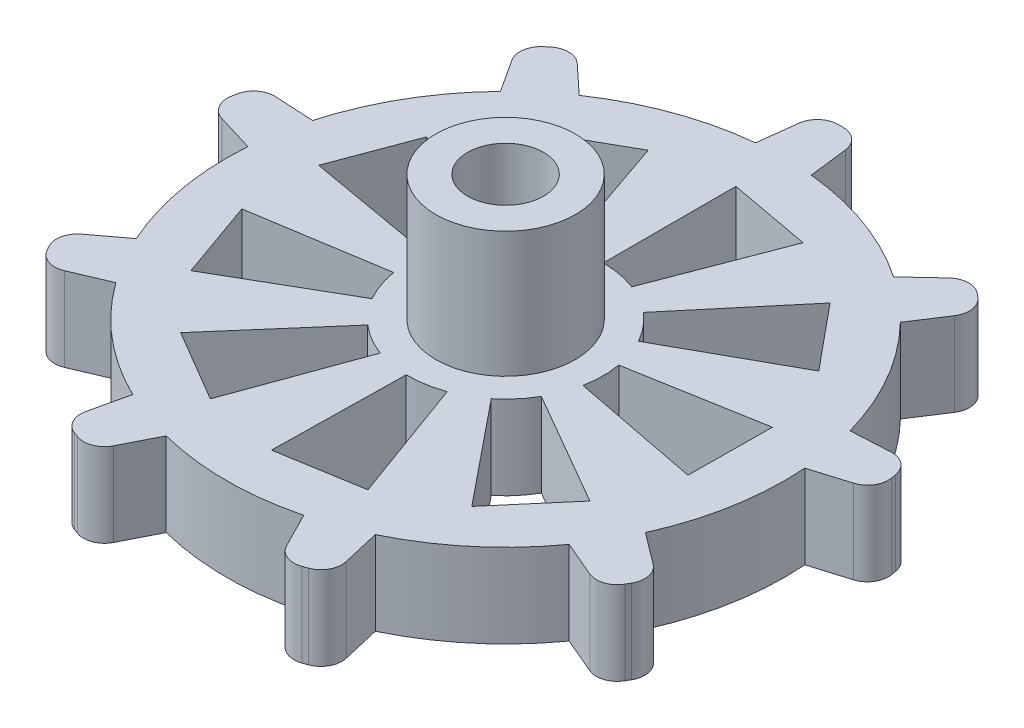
ISO-10303-21;
HEADER;
FILE_DESCRIPTION(('STEP AP214'),'2;1');
FILE_NAME('part.step','',(''),(''),'','','');
FILE_SCHEMA(('AUTOMOTIVE_DESIGN { 1 0 10303 214 1 1 1 1 }'));
ENDSEC;
DATA;
#1=APPLICATION_CONTEXT('core data for automotive mechanical design processes');
#2=APPLICATION_PROTOCOL_DEFINITION('international standard','automotive_design',2000,#1);
#3=PRODUCT_CONTEXT('',#1,'mechanical');
#4=PRODUCT('Part','Part','',(#3));
#5=PRODUCT_RELATED_PRODUCT_CATEGORY('part','',(#4));
#6=PRODUCT_DEFINITION_FORMATION('','',#4);
#7=PRODUCT_DEFINITION_CONTEXT('part definition',#1,'design');
#8=PRODUCT_DEFINITION('design','',#6,#7);
#9=PRODUCT_DEFINITION_SHAPE('','',#8);
#10=(LENGTH_UNIT() NAMED_UNIT(*) SI_UNIT(.MILLI.,.METRE.));
#11=(NAMED_UNIT(*) PLANE_ANGLE_UNIT() SI_UNIT($,.RADIAN.));
#12=(NAMED_UNIT(*) SI_UNIT($,.STERADIAN.) SOLID_ANGLE_UNIT());
#13=UNCERTAINTY_MEASURE_WITH_UNIT(LENGTH_MEASURE(1.E-05),#10,'distance_accuracy_value','');
#14=(GEOMETRIC_REPRESENTATION_CONTEXT(3) GLOBAL_UNCERTAINTY_ASSIGNED_CONTEXT((#13)) GLOBAL_UNIT_ASSIGNED_CONTEXT((#10,
#11,#12)) REPRESENTATION_CONTEXT('',''));
#15=CARTESIAN_POINT('',(0.,0.,0.));
#16=DIRECTION('',(0.,0.,1.));
#17=DIRECTION('',(1.,0.,0.));
#18=AXIS2_PLACEMENT_3D('',#15,#16,#17);
#19=CARTESIAN_POINT('',(0.,6.,0.));
#20=DIRECTION('',(0.,1.,0.));
#21=DIRECTION('',(0.,0.,1.));
#22=AXIS2_PLACEMENT_3D('',#19,#20,#21);
#23=PLANE('',#22);
#24=DIRECTION('',(0.998585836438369,0.,0.0531632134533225));
#25=VECTOR('',#24,1.);
#26=CARTESIAN_POINT('',(0.299808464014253,6.,-5.63142192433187));
#27=LINE('',#26,#25);
#28=CARTESIAN_POINT('',(-28.5706777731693,6.,-7.16844334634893));
#29=VERTEX_POINT('',#28);
#30=CARTESIAN_POINT('',(-25.7722121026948,6.,-7.0194572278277));
#31=VERTEX_POINT('',#30);
#32=EDGE_CURVE('E1124',#29,#31,#27,.T.);
#33=ORIENTED_EDGE('',*,*,#32,.F.);
#34=CARTESIAN_POINT('',(-28.6504225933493,6.,-5.67056459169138));
#35=DIRECTION('',(0.,1.,0.));
#36=DIRECTION('',(0.,0.,1.));
#37=AXIS2_PLACEMENT_3D('',#34,#35,#36);
#38=CIRCLE('',#37,1.5);
#39=CARTESIAN_POINT('',(-30.1276342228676,6.,-5.93103685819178));
#40=VERTEX_POINT('',#39);
#41=EDGE_CURVE('E11',#29,#40,#38,.T.);
#42=ORIENTED_EDGE('',*,*,#41,.T.);
#43=DIRECTION('',(0.17364817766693,0.,-0.984807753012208));
#44=VECTOR('',#43,1.);
#45=CARTESIAN_POINT('',(-30.2334419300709,6.,-5.33097153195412));
#46=LINE('',#45,#44);
#47=CARTESIAN_POINT('',(-30.1873011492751,6.,-5.59264890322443));
#48=VERTEX_POINT('',#47);
#49=EDGE_CURVE('E793',#48,#40,#46,.T.);
#50=ORIENTED_EDGE('',*,*,#49,.F.);
#51=CARTESIAN_POINT('',(-28.7100895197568,6.,-5.33217663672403));
#52=DIRECTION('',(0.,1.,0.));
#53=DIRECTION('',(0.,0.,1.));
#54=AXIS2_PLACEMENT_3D('',#51,#52,#53);
#55=CIRCLE('',#54,1.5);
#56=CARTESIAN_POINT('',(-29.1474586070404,6.,-3.89735668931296));
#57=VERTEX_POINT('',#56);
#58=EDGE_CURVE('E723',#48,#57,#55,.T.);
#59=ORIENTED_EDGE('',*,*,#58,.T.);
#60=DIRECTION('',(0.956546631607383,0.,0.291579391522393));
#61=VECTOR('',#60,1.);
#62=CARTESIAN_POINT('',(-1.39106545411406,6.,4.5634877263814));
#63=LINE('',#62,#61);
#64=CARTESIAN_POINT('',(-26.4668048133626,6.,-3.08022621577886));
#65=VERTEX_POINT('',#64);
#66=EDGE_CURVE('E1138',#57,#65,#63,.T.);
#67=ORIENTED_EDGE('',*,*,#66,.T.);
#68=CARTESIAN_POINT('',(-6.52208161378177,6.,-1.59428661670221));
#69=DIRECTION('',(0.,1.,0.));
#70=DIRECTION('',(0.,0.,1.));
#71=AXIS2_PLACEMENT_3D('',#68,#69,#70);
#72=CIRCLE('',#71,20.);
#73=CARTESIAN_POINT('',(-24.7557695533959,6.,6.62353694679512));
#74=VERTEX_POINT('',#73);
#75=EDGE_CURVE('E1140',#65,#74,#72,.T.);
#76=ORIENTED_EDGE('',*,*,#75,.T.);
#77=DIRECTION('',(0.799133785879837,0.,-0.601153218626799));
#78=VECTOR('',#77,1.);
#79=CARTESIAN_POINT('',(-5.76440915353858,6.,-7.66282865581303));
#80=LINE('',#79,#78);
#81=CARTESIAN_POINT('',(-26.9952850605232,6.,8.30822601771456));
#82=VERTEX_POINT('',#81);
#83=EDGE_CURVE('E1143',#82,#74,#80,.T.);
#84=ORIENTED_EDGE('',*,*,#83,.F.);
#85=CARTESIAN_POINT('',(-26.093555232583,6.,9.50692669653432));
#86=DIRECTION('',(0.,1.,0.));
#87=DIRECTION('',(0.,0.,1.));
#88=AXIS2_PLACEMENT_3D('',#85,#86,#87);
#89=CIRCLE('',#88,1.5);
#90=CARTESIAN_POINT('',(-27.3925933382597,6.,10.2569266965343));
#91=VERTEX_POINT('',#90);
#92=EDGE_CURVE('E638',#82,#91,#89,.T.);
#93=ORIENTED_EDGE('',*,*,#92,.T.);
#94=DIRECTION('',(-0.500000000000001,0.,-0.866025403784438));
#95=VECTOR('',#94,1.);
#96=CARTESIAN_POINT('',(-24.9858245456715,6.,14.4255725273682));
#97=LINE('',#96,#95);
#98=CARTESIAN_POINT('',(-27.220789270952,6.,10.5545000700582));
#99=VERTEX_POINT('',#98);
#100=EDGE_CURVE('E1145',#99,#91,#97,.T.);
#101=ORIENTED_EDGE('',*,*,#100,.F.);
#102=CARTESIAN_POINT('',(-25.9217511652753,6.,9.80450007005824));
#103=DIRECTION('',(0.,1.,0.));
#104=DIRECTION('',(0.,0.,1.));
#105=AXIS2_PLACEMENT_3D('',#102,#103,#104);
#106=CIRCLE('',#105,1.5);
#107=CARTESIAN_POINT('',(-25.3345108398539,6.,11.1847713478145));
#108=VERTEX_POINT('',#107);
#109=EDGE_CURVE('E629',#99,#108,#106,.T.);
#110=ORIENTED_EDGE('',*,*,#109,.T.);
#111=DIRECTION('',(0.920180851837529,0.,-0.39149355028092));
#112=VECTOR('',#111,1.);
#113=CARTESIAN_POINT('',(0.146306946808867,6.,0.34388523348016));
#114=LINE('',#113,#112);
#115=CARTESIAN_POINT('',(-22.7557695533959,6.,10.0876385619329));
#116=VERTEX_POINT('',#115);
#117=EDGE_CURVE('E1148',#108,#116,#114,.T.);
#118=ORIENTED_EDGE('',*,*,#117,.T.);
#119=CARTESIAN_POINT('',(-6.52208161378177,6.,-1.59428661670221));
#120=DIRECTION('',(0.,1.,0.));
#121=DIRECTION('',(0.,0.,1.));
#122=AXIS2_PLACEMENT_3D('',#119,#120,#121);
#123=CIRCLE('',#122,20.);
#124=CARTESIAN_POINT('',(-15.2075817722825,6.,16.4213201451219));
#125=VERTEX_POINT('',#124);
#126=EDGE_CURVE('E1150',#116,#125,#123,.T.);
#127=ORIENTED_EDGE('',*,*,#126,.T.);
#128=DIRECTION('',(0.225758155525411,0.,-0.974183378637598));
#129=VECTOR('',#128,1.);
#130=CARTESIAN_POINT('',(-10.820962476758,6.,-2.50765983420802));
#131=LINE('',#130,#129);
#132=CARTESIAN_POINT('',(-15.8402529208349,6.,19.1513996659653));
#133=VERTEX_POINT('',#132);
#134=EDGE_CURVE('E1153',#133,#125,#131,.T.);
#135=ORIENTED_EDGE('',*,*,#134,.F.);
#136=CARTESIAN_POINT('',(-14.3789778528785,6.,19.4900368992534));
#137=DIRECTION('',(0.,1.,0.));
#138=DIRECTION('',(0.,0.,1.));
#139=AXIS2_PLACEMENT_3D('',#136,#137,#138);
#140=CIRCLE('',#139,1.5);
#141=CARTESIAN_POINT('',(-14.892008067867,6.,20.8995758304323));
#142=VERTEX_POINT('',#141);
#143=EDGE_CURVE('E647',#133,#142,#140,.T.);
#144=ORIENTED_EDGE('',*,*,#143,.T.);
#145=DIRECTION('',(-0.939692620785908,0.,-0.342020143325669));
#146=VECTOR('',#145,1.);
#147=CARTESIAN_POINT('',(-8.45902821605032,6.,23.2409890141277));
#148=LINE('',#147,#146);
#149=CARTESIAN_POINT('',(-14.5691220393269,6.,21.0170967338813));
#150=VERTEX_POINT('',#149);
#151=EDGE_CURVE('E1155',#150,#142,#148,.T.);
#152=ORIENTED_EDGE('',*,*,#151,.F.);
#153=CARTESIAN_POINT('',(-14.0560918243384,6.,19.6075578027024));
#154=DIRECTION('',(0.,1.,0.));
#155=DIRECTION('',(0.,0.,1.));
#156=AXIS2_PLACEMENT_3D('',#153,#154,#155);
#157=CIRCLE('',#156,1.5);
#158=CARTESIAN_POINT('',(-12.719018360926,6.,20.2874361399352));
#159=VERTEX_POINT('',#158);
#160=EDGE_CURVE('E657',#150,#159,#157,.T.);
#161=ORIENTED_EDGE('',*,*,#160,.T.);
#162=DIRECTION('',(0.453252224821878,0.,-0.891382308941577));
#163=VECTOR('',#162,1.);
#164=CARTESIAN_POINT('',(-1.90950348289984,6.,-0.970948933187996));
#165=LINE('',#164,#163);
#166=CARTESIAN_POINT('',(-11.4488112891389,6.,17.7894007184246));
#167=VERTEX_POINT('',#166);
#168=EDGE_CURVE('E1157',#159,#167,#165,.T.);
#169=ORIENTED_EDGE('',*,*,#168,.T.);
#170=CARTESIAN_POINT('',(-6.52208161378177,6.,-1.59428661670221));
#171=DIRECTION('',(0.,1.,0.));
#172=DIRECTION('',(0.,0.,1.));
#173=AXIS2_PLACEMENT_3D('',#170,#171,#172);
#174=CIRCLE('',#173,20.);
#175=CARTESIAN_POINT('',(-1.59535193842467,6.,17.7894007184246));
#176=VERTEX_POINT('',#175);
#177=EDGE_CURVE('E1159',#167,#176,#174,.T.);
#178=ORIENTED_EDGE('',*,*,#177,.T.);
#179=DIRECTION('',(-0.45325222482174,0.,-0.891382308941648));
#180=VECTOR('',#179,1.);
#181=CARTESIAN_POINT('',(-8.45489842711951,6.,4.29916712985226));
#182=LINE('',#181,#180);
#183=CARTESIAN_POINT('',(-0.325144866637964,6.,20.2874361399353));
#184=VERTEX_POINT('',#183);
#185=EDGE_CURVE('E1162',#184,#176,#182,.T.);
#186=ORIENTED_EDGE('',*,*,#185,.F.);
#187=CARTESIAN_POINT('',(1.01192859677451,6.,19.6075578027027));
#188=DIRECTION('',(0.,1.,0.));
#189=DIRECTION('',(0.,0.,1.));
#190=AXIS2_PLACEMENT_3D('',#187,#188,#189);
#191=CIRCLE('',#190,1.5);
#192=CARTESIAN_POINT('',(1.52495881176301,6.,21.0170967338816));
#193=VERTEX_POINT('',#192);
#194=EDGE_CURVE('E666',#184,#193,#191,.T.);
#195=ORIENTED_EDGE('',*,*,#194,.T.);
#196=DIRECTION('',(-0.939692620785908,0.,0.34202014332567));
#197=VECTOR('',#196,1.);
#198=CARTESIAN_POINT('',(6.93315098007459,6.,19.0486757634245));
#199=LINE('',#198,#197);
#200=CARTESIAN_POINT('',(1.84784484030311,6.,20.8995758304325));
#201=VERTEX_POINT('',#200);
#202=EDGE_CURVE('E1164',#201,#193,#199,.T.);
#203=ORIENTED_EDGE('',*,*,#202,.F.);
#204=CARTESIAN_POINT('',(1.3348146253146,6.,19.4900368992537));
#205=DIRECTION('',(0.,1.,0.));
#206=DIRECTION('',(0.,0.,1.));
#207=AXIS2_PLACEMENT_3D('',#204,#205,#206);
#208=CIRCLE('',#207,1.5);
#209=CARTESIAN_POINT('',(2.79608969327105,6.,19.1513996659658));
#210=VERTEX_POINT('',#209);
#211=EDGE_CURVE('E676',#201,#210,#208,.T.);
#212=ORIENTED_EDGE('',*,*,#211,.T.);
#213=DIRECTION('',(-0.225758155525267,0.,-0.974183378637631));
#214=VECTOR('',#213,1.);
#215=CARTESIAN_POINT('',(-1.558382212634,6.,0.361140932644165));
#216=LINE('',#215,#214);
#217=CARTESIAN_POINT('',(2.16341854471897,6.,16.4213201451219));
#218=VERTEX_POINT('',#217);
#219=EDGE_CURVE('E1166',#210,#218,#216,.T.);
#220=ORIENTED_EDGE('',*,*,#219,.T.);
#221=CARTESIAN_POINT('',(-6.52208161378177,6.,-1.59428661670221));
#222=DIRECTION('',(0.,1.,0.));
#223=DIRECTION('',(0.,0.,1.));
#224=AXIS2_PLACEMENT_3D('',#221,#222,#223);
#225=CIRCLE('',#224,20.);
#226=CARTESIAN_POINT('',(9.71160632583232,6.,10.0876385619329));
#227=VERTEX_POINT('',#226);
#228=EDGE_CURVE('E1168',#218,#227,#225,.T.);
#229=ORIENTED_EDGE('',*,*,#228,.T.);
#230=DIRECTION('',(-0.920180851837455,0.,-0.391493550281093));
#231=VECTOR('',#230,1.);
#232=CARTESIAN_POINT('',(-2.14554931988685,6.,5.04297810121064));
#233=LINE('',#232,#231);
#234=CARTESIAN_POINT('',(12.2903476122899,6.,11.1847713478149));
#235=VERTEX_POINT('',#234);
#236=EDGE_CURVE('E1171',#235,#227,#233,.T.);
#237=ORIENTED_EDGE('',*,*,#236,.F.);
#238=CARTESIAN_POINT('',(12.8775879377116,6.,9.80450007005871));
#239=DIRECTION('',(0.,1.,0.));
#240=DIRECTION('',(0.,0.,1.));
#241=AXIS2_PLACEMENT_3D('',#238,#239,#240);
#242=CIRCLE('',#241,1.5);
#243=CARTESIAN_POINT('',(14.1766260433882,6.,10.5545000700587));
#244=VERTEX_POINT('',#243);
#245=EDGE_CURVE('E685',#235,#244,#242,.T.);
#246=ORIENTED_EDGE('',*,*,#245,.T.);
#247=DIRECTION('',(-0.499999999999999,0.,0.866025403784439));
#248=VECTOR('',#247,1.);
#249=CARTESIAN_POINT('',(15.2027021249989,6.,8.7772841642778));
#250=LINE('',#249,#248);
#251=CARTESIAN_POINT('',(14.3484301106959,6.,10.2569266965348));
#252=VERTEX_POINT('',#251);
#253=EDGE_CURVE('E1173',#252,#244,#250,.T.);
#254=ORIENTED_EDGE('',*,*,#253,.F.);
#255=CARTESIAN_POINT('',(13.0493920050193,6.,9.5069266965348));
#256=DIRECTION('',(0.,1.,0.));
#257=DIRECTION('',(0.,0.,1.));
#258=AXIS2_PLACEMENT_3D('',#255,#256,#257);
#259=CIRCLE('',#258,1.5);
#260=CARTESIAN_POINT('',(13.9511218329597,6.,8.30822601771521));
#261=VERTEX_POINT('',#260);
#262=EDGE_CURVE('E695',#252,#261,#259,.T.);
#263=ORIENTED_EDGE('',*,*,#262,.T.);
#264=DIRECTION('',(-0.799133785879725,0.,-0.601153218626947));
#265=VECTOR('',#264,1.);
#266=CARTESIAN_POINT('',(1.05044171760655,6.,-1.39638854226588));
#267=LINE('',#266,#265);
#268=CARTESIAN_POINT('',(11.7116063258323,6.,6.62353694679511));
#269=VERTEX_POINT('',#268);
#270=EDGE_CURVE('E1175',#261,#269,#267,.T.);
#271=ORIENTED_EDGE('',*,*,#270,.T.);
#272=CARTESIAN_POINT('',(-6.52208161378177,6.,-1.59428661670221));
#273=DIRECTION('',(0.,1.,0.));
#274=DIRECTION('',(0.,0.,1.));
#275=AXIS2_PLACEMENT_3D('',#272,#273,#274);
#276=CIRCLE('',#275,20.);
#277=CARTESIAN_POINT('',(13.422641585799,6.,-3.08022621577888));
#278=VERTEX_POINT('',#277);
#279=EDGE_CURVE('E1177',#269,#278,#276,.T.);
#280=ORIENTED_EDGE('',*,*,#279,.T.);
#281=DIRECTION('',(-0.956546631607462,0.,0.291579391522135));
#282=VECTOR('',#281,1.);
#283=CARTESIAN_POINT('',(0.282069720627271,6.,0.925349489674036));
#284=LINE('',#283,#282);
#285=CARTESIAN_POINT('',(16.103295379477,6.,-3.89735668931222));
#286=VERTEX_POINT('',#285);
#287=EDGE_CURVE('E1180',#286,#278,#284,.T.);
#288=ORIENTED_EDGE('',*,*,#287,.F.);
#289=CARTESIAN_POINT('',(15.6659262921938,6.,-5.33217663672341));
#290=DIRECTION('',(0.,1.,0.));
#291=DIRECTION('',(0.,0.,1.));
#292=AXIS2_PLACEMENT_3D('',#289,#290,#291);
#293=CIRCLE('',#292,1.5);
#294=CARTESIAN_POINT('',(17.1431379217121,6.,-5.59264890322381));
#295=VERTEX_POINT('',#294);
#296=EDGE_CURVE('E704',#286,#295,#293,.T.);
#297=ORIENTED_EDGE('',*,*,#296,.T.);
#298=DIRECTION('',(0.173648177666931,0.,0.984807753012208));
#299=VECTOR('',#298,1.);
#300=CARTESIAN_POINT('',(17.5826083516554,6.,-3.10028824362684));
#301=LINE('',#300,#299);
#302=CARTESIAN_POINT('',(17.0834709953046,6.,-5.93103685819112));
#303=VERTEX_POINT('',#302);
#304=EDGE_CURVE('E1182',#303,#295,#301,.T.);
#305=ORIENTED_EDGE('',*,*,#304,.F.);
#306=CARTESIAN_POINT('',(15.6062593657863,6.,-5.67056459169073));
#307=DIRECTION('',(0.,1.,0.));
#308=DIRECTION('',(0.,0.,1.));
#309=AXIS2_PLACEMENT_3D('',#306,#307,#308);
#310=CIRCLE('',#309,1.5);
#311=CARTESIAN_POINT('',(15.5265145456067,6.,-7.1684433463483));
#312=VERTEX_POINT('',#311);
#313=EDGE_CURVE('E714',#303,#312,#310,.T.);
#314=ORIENTED_EDGE('',*,*,#313,.T.);
#315=DIRECTION('',(-0.998585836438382,0.,0.0531632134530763));
#316=VECTOR('',#315,1.);
#317=CARTESIAN_POINT('',(-0.336675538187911,6.,-6.32391087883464));
#318=LINE('',#317,#316);
#319=CARTESIAN_POINT('',(12.7280488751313,6.,-7.01945722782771));
#320=VERTEX_POINT('',#319);
#321=EDGE_CURVE('E1184',#312,#320,#318,.T.);
#322=ORIENTED_EDGE('',*,*,#321,.T.);
#323=CARTESIAN_POINT('',(-6.52208161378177,6.,-1.59428661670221));
#324=DIRECTION('',(0.,1.,0.));
#325=DIRECTION('',(0.,0.,1.));
#326=AXIS2_PLACEMENT_3D('',#323,#324,#325);
#327=CIRCLE('',#326,20.);
#328=CARTESIAN_POINT('',(7.80131919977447,6.,-15.5528033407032));
#329=VERTEX_POINT('',#328);
#330=EDGE_CURVE('E1186',#320,#329,#327,.T.);
#331=ORIENTED_EDGE('',*,*,#330,.T.);
#332=DIRECTION('',(-0.545333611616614,0.,0.838219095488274));
#333=VECTOR('',#332,1.);
#334=CARTESIAN_POINT('',(-1.62803245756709,6.,-1.05917513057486));
#335=LINE('',#334,#333);
#336=CARTESIAN_POINT('',(9.32957779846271,6.,-17.9018526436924));
#337=VERTEX_POINT('',#336);
#338=EDGE_CURVE('E1189',#337,#329,#335,.T.);
#339=ORIENTED_EDGE('',*,*,#338,.F.);
#340=CARTESIAN_POINT('',(8.0722491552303,6.,-18.7198530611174));
#341=DIRECTION('',(0.,1.,0.));
#342=DIRECTION('',(0.,0.,1.));
#343=AXIS2_PLACEMENT_3D('',#340,#341,#342);
#344=CIRCLE('',#343,1.5);
#345=CARTESIAN_POINT('',(9.0364305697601,6.,-19.8689197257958));
#346=VERTEX_POINT('',#345);
#347=EDGE_CURVE('E732',#337,#346,#344,.T.);
#348=ORIENTED_EDGE('',*,*,#347,.T.);
#349=DIRECTION('',(0.76604444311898,0.,0.642787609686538));
#350=VECTOR('',#349,1.);
#351=CARTESIAN_POINT('',(13.5171685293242,6.,-16.1091341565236));
#352=LINE('',#351,#350);
#353=CARTESIAN_POINT('',(8.77321146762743,6.,-20.0897867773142));
#354=VERTEX_POINT('',#353);
#355=EDGE_CURVE('E1004',#354,#346,#352,.T.);
#356=ORIENTED_EDGE('',*,*,#355,.F.);
#357=CARTESIAN_POINT('',(7.80903005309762,6.,-18.9407201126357));
#358=DIRECTION('',(0.,1.,0.));
#359=DIRECTION('',(0.,0.,1.));
#360=AXIS2_PLACEMENT_3D('',#357,#358,#359);
#361=CIRCLE('',#360,1.5);
#362=CARTESIAN_POINT('',(6.78512407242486,6.,-20.0369028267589));
#363=VERTEX_POINT('',#362);
#364=EDGE_CURVE('E742',#354,#363,#361,.T.);
#365=ORIENTED_EDGE('',*,*,#364,.T.);
#366=DIRECTION('',(-0.730788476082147,0.,0.682603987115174));
#367=VECTOR('',#366,1.);
#368=CARTESIAN_POINT('',(-6.83367475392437,6.,-7.31605858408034));
#369=LINE('',#368,#367);
#370=CARTESIAN_POINT('',(4.73714142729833,6.,-18.1239537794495));
#371=VERTEX_POINT('',#370);
#372=EDGE_CURVE('E1269',#363,#371,#369,.T.);
#373=ORIENTED_EDGE('',*,*,#372,.T.);
#374=CARTESIAN_POINT('',(-6.52208161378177,6.,-1.59428661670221));
#375=DIRECTION('',(0.,1.,0.));
#376=DIRECTION('',(0.,0.,1.));
#377=AXIS2_PLACEMENT_3D('',#374,#375,#376);
#378=CIRCLE('',#377,19.9999999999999);
#379=CARTESIAN_POINT('',(-4.52208161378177,6.,-21.4940353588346));
#380=VERTEX_POINT('',#379);
#381=EDGE_CURVE('E1271',#371,#380,#378,.T.);
#382=ORIENTED_EDGE('',*,*,#381,.T.);
#383=DIRECTION('',(0.121047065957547,0.,0.992646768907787));
#384=VECTOR('',#383,1.);
#385=CARTESIAN_POINT('',(-1.87316394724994,6.,0.228420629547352));
#386=LINE('',#385,#384);
#387=CARTESIAN_POINT('',(-4.86130739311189,6.,-24.2758572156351));
#388=VERTEX_POINT('',#387);
#389=EDGE_CURVE('E1274',#388,#380,#386,.T.);
#390=ORIENTED_EDGE('',*,*,#389,.F.);
#391=CARTESIAN_POINT('',(-6.35027754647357,6.,-24.0942866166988));
#392=DIRECTION('',(0.,1.,0.));
#393=DIRECTION('',(0.,0.,1.));
#394=AXIS2_PLACEMENT_3D('',#391,#392,#393);
#395=CIRCLE('',#394,1.5);
#396=CARTESIAN_POINT('',(-6.35027754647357,6.,-25.5942866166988));
#397=VERTEX_POINT('',#396);
#398=EDGE_CURVE('E751',#388,#397,#395,.T.);
#399=ORIENTED_EDGE('',*,*,#398,.T.);
#400=DIRECTION('',(1.,0.,0.));
#401=VECTOR('',#400,1.);
#402=CARTESIAN_POINT('',(0.,6.,-25.5942866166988));
#403=LINE('',#402,#401);
#404=CARTESIAN_POINT('',(-6.69388568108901,6.,-25.5942866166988));
#405=VERTEX_POINT('',#404);
#406=EDGE_CURVE('E1276',#405,#397,#403,.T.);
#407=ORIENTED_EDGE('',*,*,#406,.F.);
#408=CARTESIAN_POINT('',(-6.69388568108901,6.,-24.0942866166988));
#409=DIRECTION('',(0.,1.,0.));
#410=DIRECTION('',(0.,0.,1.));
#411=AXIS2_PLACEMENT_3D('',#408,#409,#410);
#412=CIRCLE('',#411,1.5);
#413=CARTESIAN_POINT('',(-8.18285583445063,6.,-24.2758572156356));
#414=VERTEX_POINT('',#413);
#415=EDGE_CURVE('E761',#405,#414,#412,.T.);
#416=ORIENTED_EDGE('',*,*,#415,.T.);
#417=DIRECTION('',(-0.121047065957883,0.,0.992646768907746));
#418=VECTOR('',#417,1.);
#419=CARTESIAN_POINT('',(-10.9798710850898,6.,-1.33892661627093));
#420=LINE('',#419,#418);
#421=CARTESIAN_POINT('',(-8.52208161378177,6.,-21.4940353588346));
#422=VERTEX_POINT('',#421);
#423=EDGE_CURVE('E1278',#414,#422,#420,.T.);
#424=ORIENTED_EDGE('',*,*,#423,.T.);
#425=CARTESIAN_POINT('',(-6.52208161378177,6.,-1.59428661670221));
#426=DIRECTION('',(0.,1.,0.));
#427=DIRECTION('',(0.,0.,1.));
#428=AXIS2_PLACEMENT_3D('',#425,#426,#427);
#429=CIRCLE('',#428,19.9999999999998);
#430=CARTESIAN_POINT('',(-17.7813046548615,6.,-18.1239537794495));
#431=VERTEX_POINT('',#430);
#432=EDGE_CURVE('E1280',#422,#431,#429,.T.);
#433=ORIENTED_EDGE('',*,*,#432,.T.);
#434=DIRECTION('',(0.730788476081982,0.,0.682603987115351));
#435=VECTOR('',#434,1.);
#436=CARTESIAN_POINT('',(0.755770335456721,6.,-0.809119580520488));
#437=LINE('',#436,#435);
#438=CARTESIAN_POINT('',(-19.8292872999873,6.,-20.0369028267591));
#439=VERTEX_POINT('',#438);
#440=EDGE_CURVE('E1283',#439,#431,#437,.T.);
#441=ORIENTED_EDGE('',*,*,#440,.F.);
#442=CARTESIAN_POINT('',(-20.8531932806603,6.,-18.9407201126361));
#443=DIRECTION('',(0.,1.,0.));
#444=DIRECTION('',(0.,0.,1.));
#445=AXIS2_PLACEMENT_3D('',#442,#443,#444);
#446=CIRCLE('',#445,1.5);
#447=CARTESIAN_POINT('',(-21.8173746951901,6.,-20.0897867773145));
#448=VERTEX_POINT('',#447);
#449=EDGE_CURVE('E770',#439,#448,#446,.T.);
#450=ORIENTED_EDGE('',*,*,#449,.T.);
#451=DIRECTION('',(0.766044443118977,0.,-0.642787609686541));
#452=VECTOR('',#451,1.);
#453=CARTESIAN_POINT('',(-18.9067025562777,6.,-22.532130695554));
#454=LINE('',#453,#452);
#455=CARTESIAN_POINT('',(-22.0805937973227,6.,-19.8689197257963));
#456=VERTEX_POINT('',#455);
#457=EDGE_CURVE('E1133',#456,#448,#454,.T.);
#458=ORIENTED_EDGE('',*,*,#457,.F.);
#459=CARTESIAN_POINT('',(-21.1164123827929,6.,-18.7198530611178));
#460=DIRECTION('',(0.,1.,0.));
#461=DIRECTION('',(0.,0.,1.));
#462=AXIS2_PLACEMENT_3D('',#459,#460,#461);
#463=CIRCLE('',#462,1.5);
#464=CARTESIAN_POINT('',(-22.3737410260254,6.,-17.9018526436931));
#465=VERTEX_POINT('',#464);
#466=EDGE_CURVE('E780',#456,#465,#463,.T.);
#467=ORIENTED_EDGE('',*,*,#466,.T.);
#468=DIRECTION('',(0.545333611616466,0.,0.83821909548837));
#469=VECTOR('',#468,1.);
#470=CARTESIAN_POINT('',(-7.53694339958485,6.,4.90342988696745));
#471=LINE('',#470,#469);
#472=CARTESIAN_POINT('',(-20.8454824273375,6.,-15.5528033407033));
#473=VERTEX_POINT('',#472);
#474=EDGE_CURVE('E1131',#465,#473,#471,.T.);
#475=ORIENTED_EDGE('',*,*,#474,.T.);
#476=CARTESIAN_POINT('',(-6.52208161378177,6.,-1.59428661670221));
#477=DIRECTION('',(0.,1.,0.));
#478=DIRECTION('',(0.,0.,1.));
#479=AXIS2_PLACEMENT_3D('',#476,#477,#478);
#480=CIRCLE('',#479,19.9999999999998);
#481=EDGE_CURVE('E1127',#473,#31,#480,.T.);
#482=ORIENTED_EDGE('',*,*,#481,.T.);
#483=EDGE_LOOP('',(#33,#42,#50,#59,#67,#76,#84,#93,#101,#110,#118,#127,#135,#144,#152,#161,#169,
#178,#186,#195,#203,#212,#220,#229,#237,#246,#254,#263,#271,#280,#288,#297,#305,#314,#322,#331,
#339,#348,#356,#365,#373,#382,#390,#399,#407,#416,#424,#433,#441,#450,#458,#467,#475,#482));
#484=FACE_BOUND('',#483,.T.);
#485=DIRECTION('',(0.857604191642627,0.,0.514310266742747));
#486=VECTOR('',#485,1.);
#487=CARTESIAN_POINT('',(-1.02198935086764,6.,1.70415099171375));
#488=LINE('',#487,#486);
#489=CARTESIAN_POINT('',(-20.6725507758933,6.,-10.0804060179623));
#490=VERTEX_POINT('',#489);
#491=CARTESIAN_POINT('',(-12.5253109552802,6.,-5.19445848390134));
#492=VERTEX_POINT('',#491);
#493=EDGE_CURVE('E1260',#490,#492,#488,.T.);
#494=ORIENTED_EDGE('',*,*,#493,.T.);
#495=CARTESIAN_POINT('',(-6.52208161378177,6.,-1.59428661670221));
#496=DIRECTION('',(0.,1.,0.));
#497=DIRECTION('',(0.,0.,1.));
#498=AXIS2_PLACEMENT_3D('',#495,#496,#497);
#499=CIRCLE('',#498,7.);
#500=CARTESIAN_POINT('',(-13.4157358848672,6.,-2.80982386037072));
#501=VERTEX_POINT('',#500);
#502=EDGE_CURVE('E1263',#492,#501,#499,.T.);
#503=ORIENTED_EDGE('',*,*,#502,.T.);
#504=DIRECTION('',(-0.984807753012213,0.,-0.173648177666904));
#505=VECTOR('',#504,1.);
#506=CARTESIAN_POINT('',(0.0759742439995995,6.,-0.430871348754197));
#507=LINE('',#506,#505);
#508=CARTESIAN_POINT('',(-22.7714095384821,6.,-4.45948154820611));
#509=VERTEX_POINT('',#508);
#510=EDGE_CURVE('E1265',#501,#509,#507,.T.);
#511=ORIENTED_EDGE('',*,*,#510,.T.);
#512=DIRECTION('',(0.349809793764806,0.,-0.936820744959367));
#513=VECTOR('',#512,1.);
#514=CARTESIAN_POINT('',(-21.4463554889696,6.,-8.00809037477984));
#515=LINE('',#514,#513);
#516=EDGE_CURVE('E1267',#509,#490,#515,.T.);
#517=ORIENTED_EDGE('',*,*,#516,.T.);
#518=EDGE_LOOP('',(#494,#503,#511,#517));
#519=FACE_BOUND('',#518,.T.);
#520=DIRECTION('',(0.655418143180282,0.,-0.755266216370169));
#521=VECTOR('',#520,1.);
#522=CARTESIAN_POINT('',(-4.50956790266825,6.,-3.91339180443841));
#523=LINE('',#522,#521);
#524=CARTESIAN_POINT('',(-17.3364809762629,6.,10.867605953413));
#525=VERTEX_POINT('',#524);
#526=CARTESIAN_POINT('',(-11.1100086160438,6.,3.69257689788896));
#527=VERTEX_POINT('',#526);
#528=EDGE_CURVE('E1251',#525,#527,#523,.T.);
#529=ORIENTED_EDGE('',*,*,#528,.T.);
#530=CARTESIAN_POINT('',(-6.52208161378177,6.,-1.59428661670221));
#531=DIRECTION('',(0.,1.,0.));
#532=DIRECTION('',(0.,0.,1.));
#533=AXIS2_PLACEMENT_3D('',#530,#531,#532);
#534=CIRCLE('',#533,6.99999999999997);
#535=CARTESIAN_POINT('',(-8.91622261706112,6.,4.9835617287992));
#536=VERTEX_POINT('',#535);
#537=EDGE_CURVE('E1254',#527,#536,#534,.T.);
#538=ORIENTED_EDGE('',*,*,#537,.T.);
#539=DIRECTION('',(-0.342020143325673,0.,0.939692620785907));
#540=VECTOR('',#539,1.);
#541=CARTESIAN_POINT('',(-6.27153683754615,6.,-2.28265273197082));
#542=LINE('',#541,#540);
#543=CARTESIAN_POINT('',(-12.1654139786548,6.,13.9106416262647));
#544=VERTEX_POINT('',#543);
#545=EDGE_CURVE('E1256',#536,#544,#542,.T.);
#546=ORIENTED_EDGE('',*,*,#545,.T.);
#547=DIRECTION('',(-0.861844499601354,0.,-0.507172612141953));
#548=VECTOR('',#547,1.);
#549=CARTESIAN_POINT('',(-9.20963322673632,6.,15.6500401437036));
#550=LINE('',#549,#548);
#551=EDGE_CURVE('E1258',#544,#525,#550,.T.);
#552=ORIENTED_EDGE('',*,*,#551,.T.);
#553=EDGE_LOOP('',(#529,#538,#546,#552));
#554=FACE_BOUND('',#553,.T.);
#555=DIRECTION('',(-0.629979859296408,0.,-0.77661147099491));
#556=VECTOR('',#555,1.);
#557=CARTESIAN_POINT('',(-3.15362886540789,6.,2.5581938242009));
#558=LINE('',#557,#556);
#559=CARTESIAN_POINT('',(3.87258606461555,6.,11.2198026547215));
#560=VERTEX_POINT('',#559);
#561=CARTESIAN_POINT('',(-2.11222259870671,6.,3.841993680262));
#562=VERTEX_POINT('',#561);
#563=EDGE_CURVE('E1242',#560,#562,#558,.T.);
#564=ORIENTED_EDGE('',*,*,#563,.T.);
#565=CARTESIAN_POINT('',(-6.52208161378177,6.,-1.59428661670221));
#566=DIRECTION('',(0.,1.,0.));
#567=DIRECTION('',(0.,0.,1.));
#568=AXIS2_PLACEMENT_3D('',#565,#566,#567);
#569=CIRCLE('',#568,7.00000000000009);
#570=CARTESIAN_POINT('',(-0.459903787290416,6.,1.90571338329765));
#571=VERTEX_POINT('',#570);
#572=EDGE_CURVE('E1245',#562,#571,#569,.T.);
#573=ORIENTED_EDGE('',*,*,#572,.T.);
#574=DIRECTION('',(0.866025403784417,0.,0.500000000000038));
#575=VECTOR('',#574,1.);
#576=CARTESIAN_POINT('',(-0.940174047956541,6.,1.62842921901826));
#577=LINE('',#576,#575);
#578=CARTESIAN_POINT('',(7.7673375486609,6.,6.65571338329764));
#579=VERTEX_POINT('',#578);
#580=EDGE_CURVE('E1247',#571,#579,#577,.T.);
#581=ORIENTED_EDGE('',*,*,#580,.T.);
#582=DIRECTION('',(-0.649125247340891,0.,0.760681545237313));
#583=VECTOR('',#582,1.);
#584=CARTESIAN_POINT('',(7.7809064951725,6.,6.63981252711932));
#585=LINE('',#584,#583);
#586=EDGE_CURVE('E1249',#579,#560,#585,.T.);
#587=ORIENTED_EDGE('',*,*,#586,.T.);
#588=EDGE_LOOP('',(#564,#573,#581,#587));
#589=FACE_BOUND('',#588,.T.);
#590=DIRECTION('',(-0.87420785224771,0.,0.485551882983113));
#591=VECTOR('',#590,1.);
#592=CARTESIAN_POINT('',(-2.21438212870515,6.,-3.98686589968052));
#593=LINE('',#592,#591);
#594=CARTESIAN_POINT('',(7.90234794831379,6.,-9.60589268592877));
#595=VERTEX_POINT('',#594);
#596=CARTESIAN_POINT('',(-0.402626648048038,6.,-4.99314979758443));
#597=VERTEX_POINT('',#596);
#598=EDGE_CURVE('E1233',#595,#597,#593,.T.);
#599=ORIENTED_EDGE('',*,*,#598,.T.);
#600=CARTESIAN_POINT('',(-6.52208161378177,6.,-1.59428661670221));
#601=DIRECTION('',(0.,1.,0.));
#602=DIRECTION('',(0.,0.,1.));
#603=AXIS2_PLACEMENT_3D('',#600,#601,#602);
#604=CIRCLE('',#603,7.00000000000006);
#605=CARTESIAN_POINT('',(-2.02256834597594,6.,-6.95659771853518));
#606=VERTEX_POINT('',#605);
#607=EDGE_CURVE('E1236',#597,#606,#604,.T.);
#608=ORIENTED_EDGE('',*,*,#607,.T.);
#609=DIRECTION('',(0.64278760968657,0.,-0.766044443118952));
#610=VECTOR('',#609,1.);
#611=CARTESIAN_POINT('',(-4.61234751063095,6.,-3.87021909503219));
#612=LINE('',#611,#610);
#613=CARTESIAN_POINT('',(4.08391394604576,6.,-14.2340199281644));
#614=VERTEX_POINT('',#613);
#615=EDGE_CURVE('E1238',#606,#614,#612,.T.);
#616=ORIENTED_EDGE('',*,*,#615,.T.);
#617=DIRECTION('',(0.636405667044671,0.,0.771354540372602));
#618=VECTOR('',#617,1.);
#619=CARTESIAN_POINT('',(9.41727976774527,6.,-7.76972183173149));
#620=LINE('',#619,#618);
#621=EDGE_CURVE('E1240',#614,#595,#620,.T.);
#622=ORIENTED_EDGE('',*,*,#621,.T.);
#623=EDGE_LOOP('',(#599,#608,#616,#622));
#624=FACE_BOUND('',#623,.T.);
#625=DIRECTION('',(-0.357575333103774,0.,0.933884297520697));
#626=VECTOR('',#625,1.);
#627=CARTESIAN_POINT('',(-6.22055397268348,6.,-2.38179040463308));
#628=LINE('',#627,#626);
#629=CARTESIAN_POINT('',(-0.622088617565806,6.,-17.0033775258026));
#630=VERTEX_POINT('',#629);
#631=CARTESIAN_POINT('',(-4.01905428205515,6.,-8.13147669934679));
#632=VERTEX_POINT('',#631);
#633=EDGE_CURVE('E1224',#630,#632,#628,.T.);
#634=ORIENTED_EDGE('',*,*,#633,.T.);
#635=CARTESIAN_POINT('',(-6.52208161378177,6.,-1.59428661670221));
#636=DIRECTION('',(0.,1.,0.));
#637=DIRECTION('',(0.,0.,1.));
#638=AXIS2_PLACEMENT_3D('',#635,#636,#637);
#639=CIRCLE('',#638,6.9999999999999);
#640=CARTESIAN_POINT('',(-6.52208161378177,6.,-8.59428661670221));
#641=VERTEX_POINT('',#640);
#642=EDGE_CURVE('E1227',#632,#641,#639,.T.);
#643=ORIENTED_EDGE('',*,*,#642,.T.);
#644=DIRECTION('',(0.,0.,-1.));
#645=VECTOR('',#644,1.);
#646=CARTESIAN_POINT('',(-6.52208161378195,6.,-1.38149993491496E-13));
#647=LINE('',#646,#645);
#648=CARTESIAN_POINT('',(-6.52208161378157,6.,-18.094286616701));
#649=VERTEX_POINT('',#648);
#650=EDGE_CURVE('E1229',#641,#649,#647,.T.);
#651=ORIENTED_EDGE('',*,*,#650,.T.);
#652=DIRECTION('',(0.983332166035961,0.,0.181818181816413));
#653=VECTOR('',#652,1.);
#654=CARTESIAN_POINT('',(3.01942927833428,6.,-16.3300606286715));
#655=LINE('',#654,#653);
#656=EDGE_CURVE('E1231',#649,#630,#655,.T.);
#657=ORIENTED_EDGE('',*,*,#656,.T.);
#658=EDGE_LOOP('',(#634,#643,#651,#657));
#659=FACE_BOUND('',#658,.T.);
#660=DIRECTION('',(-0.98178880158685,0.,-0.189975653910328));
#661=VECTOR('',#660,1.);
#662=CARTESIAN_POINT('',(0.0619731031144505,6.,-0.320275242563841));
#663=LINE('',#662,#661);
#664=CARTESIAN_POINT('',(9.67743361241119,6.,1.54031167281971));
#665=VERTEX_POINT('',#664);
#666=CARTESIAN_POINT('',(0.350439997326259,6.,-0.26445703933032));
#667=VERTEX_POINT('',#666);
#668=EDGE_CURVE('E1215',#665,#667,#663,.T.);
#669=ORIENTED_EDGE('',*,*,#668,.T.);
#670=CARTESIAN_POINT('',(-6.52208161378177,6.,-1.59428661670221));
#671=DIRECTION('',(0.,1.,0.));
#672=DIRECTION('',(0.,0.,1.));
#673=AXIS2_PLACEMENT_3D('',#670,#671,#672);
#674=CIRCLE('',#673,7.0000000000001);
#675=CARTESIAN_POINT('',(0.371572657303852,6.,-2.8098238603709));
#676=VERTEX_POINT('',#675);
#677=EDGE_CURVE('E1218',#667,#676,#674,.T.);
#678=ORIENTED_EDGE('',*,*,#677,.T.);
#679=DIRECTION('',(0.984807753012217,0.,-0.173648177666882));
#680=VECTOR('',#679,1.);
#681=CARTESIAN_POINT('',(-0.46930389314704,6.,-2.66155463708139));
#682=LINE('',#681,#680);
#683=CARTESIAN_POINT('',(9.72724631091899,6.,-4.45948154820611));
#684=VERTEX_POINT('',#683);
#685=EDGE_CURVE('E1220',#676,#684,#682,.T.);
#686=ORIENTED_EDGE('',*,*,#685,.T.);
#687=DIRECTION('',(-0.00830211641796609,0.,0.999965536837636));
#688=VECTOR('',#687,1.);
#689=CARTESIAN_POINT('',(9.68955400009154,6.,0.0804465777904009));
#690=LINE('',#689,#688);
#691=EDGE_CURVE('E1222',#684,#665,#690,.T.);
#692=ORIENTED_EDGE('',*,*,#691,.T.);
#693=EDGE_LOOP('',(#669,#678,#686,#692));
#694=FACE_BOUND('',#693,.T.);
#695=DIRECTION('',(0.0166036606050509,0.,-0.999862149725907));
#696=VECTOR('',#695,1.);
#697=CARTESIAN_POINT('',(-6.54675094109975,6.,-0.108715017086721));
#698=LINE('',#697,#696);
#699=CARTESIAN_POINT('',(-6.7960420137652,6.,14.9034388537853));
#700=VERTEX_POINT('',#699);
#701=CARTESIAN_POINT('',(-6.63830723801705,6.,5.40474843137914));
#702=VERTEX_POINT('',#701);
#703=EDGE_CURVE('E1206',#700,#702,#698,.T.);
#704=ORIENTED_EDGE('',*,*,#703,.T.);
#705=CARTESIAN_POINT('',(-6.52208161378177,6.,-1.59428661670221));
#706=DIRECTION('',(0.,1.,0.));
#707=DIRECTION('',(0.,0.,1.));
#708=AXIS2_PLACEMENT_3D('',#705,#706,#707);
#709=CIRCLE('',#708,7.00000000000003);
#710=CARTESIAN_POINT('',(-4.12794061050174,6.,4.98356172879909));
#711=VERTEX_POINT('',#710);
#712=EDGE_CURVE('E1209',#702,#711,#709,.T.);
#713=ORIENTED_EDGE('',*,*,#712,.T.);
#714=DIRECTION('',(0.342020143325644,0.,0.939692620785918));
#715=VECTOR('',#714,1.);
#716=CARTESIAN_POINT('',(-5.2467491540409,6.,1.90966051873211));
#717=LINE('',#716,#715);
#718=CARTESIAN_POINT('',(-0.878749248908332,6.,13.9106416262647));
#719=VERTEX_POINT('',#718);
#720=EDGE_CURVE('E1211',#711,#719,#717,.T.);
#721=ORIENTED_EDGE('',*,*,#720,.T.);
#722=DIRECTION('',(-0.986215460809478,0.,0.165466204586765));
#723=VECTOR('',#722,1.);
#724=CARTESIAN_POINT('',(2.245953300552,6.,13.3863822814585));
#725=LINE('',#724,#723);
#726=EDGE_CURVE('E1213',#719,#700,#725,.T.);
#727=ORIENTED_EDGE('',*,*,#726,.T.);
#728=EDGE_LOOP('',(#704,#713,#721,#727));
#729=FACE_BOUND('',#728,.T.);
#730=DIRECTION('',(0.987555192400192,0.,-0.157272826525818));
#731=VECTOR('',#730,1.);
#732=CARTESIAN_POINT('',(-0.408939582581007,6.,-2.56783334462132));
#733=LINE('',#732,#731);
#734=CARTESIAN_POINT('',(-22.8167422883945,6.,1.0007150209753));
#735=VERTEX_POINT('',#734);
#736=CARTESIAN_POINT('',(-13.4349679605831,6.,-0.493376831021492));
#737=VERTEX_POINT('',#736);
#738=EDGE_CURVE('E1195',#735,#737,#733,.T.);
#739=ORIENTED_EDGE('',*,*,#738,.T.);
#740=CARTESIAN_POINT('',(-6.52208161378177,6.,-1.59428661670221));
#741=DIRECTION('',(0.,1.,0.));
#742=DIRECTION('',(0.,0.,1.));
#743=AXIS2_PLACEMENT_3D('',#740,#741,#742);
#744=CIRCLE('',#743,6.99999999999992);
#745=CARTESIAN_POINT('',(-12.5842594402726,6.,1.9057133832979));
#746=VERTEX_POINT('',#745);
#747=EDGE_CURVE('E1200',#737,#746,#744,.T.);
#748=ORIENTED_EDGE('',*,*,#747,.T.);
#749=DIRECTION('',(-0.866025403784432,0.,0.500000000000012));
#750=VECTOR('',#749,1.);
#751=CARTESIAN_POINT('',(-2.3208667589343,6.,-4.01985914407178));
#752=LINE('',#751,#750);
#753=CARTESIAN_POINT('',(-20.811500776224,6.,6.65571338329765));
#754=VERTEX_POINT('',#753);
#755=EDGE_CURVE('E1202',#746,#754,#752,.T.);
#756=ORIENTED_EDGE('',*,*,#755,.T.);
#757=DIRECTION('',(-0.334206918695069,0.,-0.942499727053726));
#758=VECTOR('',#757,1.);
#759=CARTESIAN_POINT('',(-20.5834581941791,6.,7.2988181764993));
#760=LINE('',#759,#758);
#761=EDGE_CURVE('E1204',#754,#735,#760,.T.);
#762=ORIENTED_EDGE('',*,*,#761,.T.);
#763=EDGE_LOOP('',(#739,#748,#756,#762));
#764=FACE_BOUND('',#763,.T.);
#765=DIRECTION('',(0.326370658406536,0.,0.94524187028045));
#766=VECTOR('',#765,1.);
#767=CARTESIAN_POINT('',(-5.33552762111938,6.,1.84223712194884));
#768=LINE('',#767,#766);
#769=CARTESIAN_POINT('',(-11.907197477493,6.,-17.1907774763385));
#770=VERTEX_POINT('',#769);
#771=CARTESIAN_POINT('',(-8.8066762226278,6.,-8.21097970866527));
#772=VERTEX_POINT('',#771);
#773=EDGE_CURVE('E598',#770,#772,#768,.T.);
#774=ORIENTED_EDGE('',*,*,#773,.T.);
#775=CARTESIAN_POINT('',(-6.52208161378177,6.,-1.59428661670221));
#776=DIRECTION('',(0.,1.,0.));
#777=DIRECTION('',(0.,0.,1.));
#778=AXIS2_PLACEMENT_3D('',#775,#776,#777);
#779=CIRCLE('',#778,6.99999999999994);
#780=CARTESIAN_POINT('',(-11.0215948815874,6.,-6.95659771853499));
#781=VERTEX_POINT('',#780);
#782=EDGE_CURVE('E587',#772,#781,#779,.T.);
#783=ORIENTED_EDGE('',*,*,#782,.T.);
#784=DIRECTION('',(-0.642787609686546,0.,-0.766044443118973));
#785=VECTOR('',#784,1.);
#786=CARTESIAN_POINT('',(-3.04228168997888,6.,2.55277744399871));
#787=LINE('',#786,#785);
#788=CARTESIAN_POINT('',(-17.1280771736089,6.,-14.2340199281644));
#789=VERTEX_POINT('',#788);
#790=EDGE_CURVE('E597',#781,#789,#787,.T.);
#791=ORIENTED_EDGE('',*,*,#790,.T.);
#792=DIRECTION('',(0.87014661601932,0.,-0.492792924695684));
#793=VECTOR('',#792,1.);
#794=CARTESIAN_POINT('',(-10.2630431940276,6.,-18.1219166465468));
#795=LINE('',#794,#793);
#796=EDGE_CURVE('E603',#789,#770,#795,.T.);
#797=ORIENTED_EDGE('',*,*,#796,.T.);
#798=EDGE_LOOP('',(#774,#783,#791,#797));
#799=FACE_BOUND('',#798,.T.);
#800=CARTESIAN_POINT('',(-6.52208161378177,6.,-1.59428661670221));
#801=DIRECTION('',(0.,1.,0.));
#802=DIRECTION('',(0.,0.,1.));
#803=AXIS2_PLACEMENT_3D('',#800,#801,#802);
#804=CIRCLE('',#803,5.);
#805=CARTESIAN_POINT('',(-6.52208161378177,6.,3.40571338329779));
#806=VERTEX_POINT('',#805);
#807=EDGE_CURVE('E2382',#806,#806,#804,.T.);
#808=ORIENTED_EDGE('',*,*,#807,.F.);
#809=EDGE_LOOP('',(#808));
#810=FACE_BOUND('',#809,.T.);
#811=ADVANCED_FACE('F32',(#484,#519,#554,#589,#624,#659,#694,#729,#764,#799,#810),#23,.T.);
#812=CARTESIAN_POINT('',(-6.83367475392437,6.,-7.31605858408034));
#813=DIRECTION('',(0.682603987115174,0.,0.730788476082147));
#814=DIRECTION('',(0.730788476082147,0.,-0.682603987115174));
#815=AXIS2_PLACEMENT_3D('',#812,#813,#814);
#816=PLANE('',#815);
#817=ORIENTED_EDGE('',*,*,#372,.F.);
#818=DIRECTION('',(0.,-1.,0.));
#819=VECTOR('',#818,1.);
#820=CARTESIAN_POINT('',(6.78512407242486,0.,-20.0369028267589));
#821=LINE('',#820,#819);
#822=CARTESIAN_POINT('',(6.78512407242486,0.,-20.0369028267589));
#823=VERTEX_POINT('',#822);
#824=EDGE_CURVE('E735',#363,#823,#821,.T.);
#825=ORIENTED_EDGE('',*,*,#824,.T.);
#826=DIRECTION('',(-0.730788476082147,0.,0.682603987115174));
#827=VECTOR('',#826,1.);
#828=CARTESIAN_POINT('',(-6.83367475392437,0.,-7.31605858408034));
#829=LINE('',#828,#827);
#830=CARTESIAN_POINT('',(4.73714142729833,0.,-18.1239537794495));
#831=VERTEX_POINT('',#830);
#832=EDGE_CURVE('E1096',#823,#831,#829,.T.);
#833=ORIENTED_EDGE('',*,*,#832,.T.);
#834=DIRECTION('',(0.,-1.,0.));
#835=VECTOR('',#834,1.);
#836=CARTESIAN_POINT('',(4.73714142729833,6.,-18.1239537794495));
#837=LINE('',#836,#835);
#838=EDGE_CURVE('E625',#371,#831,#837,.T.);
#839=ORIENTED_EDGE('',*,*,#838,.F.);
#840=EDGE_LOOP('',(#817,#825,#833,#839));
#841=FACE_BOUND('',#840,.T.);
#842=ADVANCED_FACE('F1339',(#841),#816,.F.);
#843=CARTESIAN_POINT('',(-6.52208161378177,6.,-1.59428661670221));
#844=DIRECTION('',(0.,-1.,0.));
#845=DIRECTION('',(0.,0.,-1.));
#846=AXIS2_PLACEMENT_3D('',#843,#844,#845);
#847=CYLINDRICAL_SURFACE('',#846,19.9999999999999);
#848=CARTESIAN_POINT('',(-6.52208161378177,0.,-1.59428661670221));
#849=DIRECTION('',(0.,1.,0.));
#850=DIRECTION('',(0.,0.,1.));
#851=AXIS2_PLACEMENT_3D('',#848,#849,#850);
#852=CIRCLE('',#851,19.9999999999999);
#853=CARTESIAN_POINT('',(-4.52208161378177,0.,-21.4940353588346));
#854=VERTEX_POINT('',#853);
#855=EDGE_CURVE('E1098',#831,#854,#852,.T.);
#856=ORIENTED_EDGE('',*,*,#855,.T.);
#857=DIRECTION('',(0.,-1.,0.));
#858=VECTOR('',#857,1.);
#859=CARTESIAN_POINT('',(-4.52208161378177,6.,-21.4940353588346));
#860=LINE('',#859,#858);
#861=EDGE_CURVE('E907',#380,#854,#860,.T.);
#862=ORIENTED_EDGE('',*,*,#861,.F.);
#863=ORIENTED_EDGE('',*,*,#381,.F.);
#864=ORIENTED_EDGE('',*,*,#838,.T.);
#865=EDGE_LOOP('',(#856,#862,#863,#864));
#866=FACE_BOUND('',#865,.T.);
#867=ADVANCED_FACE('F1333',(#866),#847,.T.);
#868=CARTESIAN_POINT('',(-1.87316394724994,6.,0.228420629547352));
#869=DIRECTION('',(0.992646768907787,0.,-0.121047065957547));
#870=DIRECTION('',(-0.121047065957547,0.,-0.992646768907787));
#871=AXIS2_PLACEMENT_3D('',#868,#869,#870);
#872=PLANE('',#871);
#873=DIRECTION('',(0.121047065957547,0.,0.992646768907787));
#874=VECTOR('',#873,1.);
#875=CARTESIAN_POINT('',(-1.87316394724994,0.,0.228420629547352));
#876=LINE('',#875,#874);
#877=CARTESIAN_POINT('',(-4.86130739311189,0.,-24.2758572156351));
#878=VERTEX_POINT('',#877);
#879=EDGE_CURVE('E1101',#878,#854,#876,.T.);
#880=ORIENTED_EDGE('',*,*,#879,.F.);
#881=DIRECTION('',(0.,-1.,0.));
#882=VECTOR('',#881,1.);
#883=CARTESIAN_POINT('',(-4.86130739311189,6.,-24.2758572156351));
#884=LINE('',#883,#882);
#885=EDGE_CURVE('E749',#878,#388,#884,.F.);
#886=ORIENTED_EDGE('',*,*,#885,.T.);
#887=ORIENTED_EDGE('',*,*,#389,.T.);
#888=ORIENTED_EDGE('',*,*,#861,.T.);
#889=EDGE_LOOP('',(#880,#886,#887,#888));
#890=FACE_BOUND('',#889,.T.);
#891=ADVANCED_FACE('F1329',(#890),#872,.T.);
#892=CARTESIAN_POINT('',(0.,6.,-25.5942866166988));
#893=DIRECTION('',(0.,0.,-1.));
#894=DIRECTION('',(-1.,0.,0.));
#895=AXIS2_PLACEMENT_3D('',#892,#893,#894);
#896=PLANE('',#895);
#897=DIRECTION('',(1.,0.,0.));
#898=VECTOR('',#897,1.);
#899=CARTESIAN_POINT('',(0.,0.,-25.5942866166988));
#900=LINE('',#899,#898);
#901=CARTESIAN_POINT('',(-6.69388568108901,0.,-25.5942866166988));
#902=VERTEX_POINT('',#901);
#903=CARTESIAN_POINT('',(-6.35027754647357,0.,-25.5942866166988));
#904=VERTEX_POINT('',#903);
#905=EDGE_CURVE('E1103',#902,#904,#900,.T.);
#906=ORIENTED_EDGE('',*,*,#905,.F.);
#907=DIRECTION('',(0.,-1.,0.));
#908=VECTOR('',#907,1.);
#909=CARTESIAN_POINT('',(-6.69388568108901,6.,-25.5942866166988));
#910=LINE('',#909,#908);
#911=EDGE_CURVE('E759',#902,#405,#910,.F.);
#912=ORIENTED_EDGE('',*,*,#911,.T.);
#913=ORIENTED_EDGE('',*,*,#406,.T.);
#914=DIRECTION('',(0.,-1.,0.));
#915=VECTOR('',#914,1.);
#916=CARTESIAN_POINT('',(-6.35027754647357,6.,-25.5942866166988));
#917=LINE('',#916,#915);
#918=EDGE_CURVE('E744',#397,#904,#917,.T.);
#919=ORIENTED_EDGE('',*,*,#918,.T.);
#920=EDGE_LOOP('',(#906,#912,#913,#919));
#921=FACE_BOUND('',#920,.T.);
#922=ADVANCED_FACE('F1318',(#921),#896,.T.);
#923=CARTESIAN_POINT('',(-10.9798710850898,6.,-1.33892661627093));
#924=DIRECTION('',(0.992646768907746,0.,0.121047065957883));
#925=DIRECTION('',(0.121047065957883,0.,-0.992646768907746));
#926=AXIS2_PLACEMENT_3D('',#923,#924,#925);
#927=PLANE('',#926);
#928=ORIENTED_EDGE('',*,*,#423,.F.);
#929=DIRECTION('',(0.,-1.,0.));
#930=VECTOR('',#929,1.);
#931=CARTESIAN_POINT('',(-8.18285583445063,0.,-24.2758572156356));
#932=LINE('',#931,#930);
#933=CARTESIAN_POINT('',(-8.18285583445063,0.,-24.2758572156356));
#934=VERTEX_POINT('',#933);
#935=EDGE_CURVE('E754',#414,#934,#932,.T.);
#936=ORIENTED_EDGE('',*,*,#935,.T.);
#937=DIRECTION('',(-0.121047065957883,0.,0.992646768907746));
#938=VECTOR('',#937,1.);
#939=CARTESIAN_POINT('',(-10.9798710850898,0.,-1.33892661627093));
#940=LINE('',#939,#938);
#941=CARTESIAN_POINT('',(-8.52208161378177,0.,-21.4940353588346));
#942=VERTEX_POINT('',#941);
#943=EDGE_CURVE('E1105',#934,#942,#940,.T.);
#944=ORIENTED_EDGE('',*,*,#943,.T.);
#945=DIRECTION('',(0.,-1.,0.));
#946=VECTOR('',#945,1.);
#947=CARTESIAN_POINT('',(-8.52208161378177,6.,-21.4940353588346));
#948=LINE('',#947,#946);
#949=EDGE_CURVE('E904',#422,#942,#948,.T.);
#950=ORIENTED_EDGE('',*,*,#949,.F.);
#951=EDGE_LOOP('',(#928,#936,#944,#950));
#952=FACE_BOUND('',#951,.T.);
#953=ADVANCED_FACE('F1310',(#952),#927,.F.);
#954=CARTESIAN_POINT('',(-6.52208161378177,6.,-1.59428661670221));
#955=DIRECTION('',(0.,-1.,0.));
#956=DIRECTION('',(0.,0.,-1.));
#957=AXIS2_PLACEMENT_3D('',#954,#955,#956);
#958=CYLINDRICAL_SURFACE('',#957,19.9999999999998);
#959=CARTESIAN_POINT('',(-6.52208161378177,0.,-1.59428661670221));
#960=DIRECTION('',(0.,1.,0.));
#961=DIRECTION('',(0.,0.,1.));
#962=AXIS2_PLACEMENT_3D('',#959,#960,#961);
#963=CIRCLE('',#962,19.9999999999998);
#964=CARTESIAN_POINT('',(-17.7813046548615,0.,-18.1239537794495));
#965=VERTEX_POINT('',#964);
#966=EDGE_CURVE('E1107',#942,#965,#963,.T.);
#967=ORIENTED_EDGE('',*,*,#966,.T.);
#968=DIRECTION('',(0.,-1.,0.));
#969=VECTOR('',#968,1.);
#970=CARTESIAN_POINT('',(-17.7813046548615,6.,-18.1239537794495));
#971=LINE('',#970,#969);
#972=EDGE_CURVE('E901',#431,#965,#971,.T.);
#973=ORIENTED_EDGE('',*,*,#972,.F.);
#974=ORIENTED_EDGE('',*,*,#432,.F.);
#975=ORIENTED_EDGE('',*,*,#949,.T.);
#976=EDGE_LOOP('',(#967,#973,#974,#975));
#977=FACE_BOUND('',#976,.T.);
#978=ADVANCED_FACE('F1304',(#977),#958,.T.);
#979=CARTESIAN_POINT('',(0.755770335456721,6.,-0.809119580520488));
#980=DIRECTION('',(0.682603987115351,0.,-0.730788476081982));
#981=DIRECTION('',(-0.730788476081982,0.,-0.682603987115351));
#982=AXIS2_PLACEMENT_3D('',#979,#980,#981);
#983=PLANE('',#982);
#984=DIRECTION('',(0.730788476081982,0.,0.682603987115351));
#985=VECTOR('',#984,1.);
#986=CARTESIAN_POINT('',(0.755770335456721,0.,-0.809119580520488));
#987=LINE('',#986,#985);
#988=CARTESIAN_POINT('',(-19.8292872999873,0.,-20.0369028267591));
#989=VERTEX_POINT('',#988);
#990=EDGE_CURVE('E1110',#989,#965,#987,.T.);
#991=ORIENTED_EDGE('',*,*,#990,.F.);
#992=DIRECTION('',(0.,-1.,0.));
#993=VECTOR('',#992,1.);
#994=CARTESIAN_POINT('',(-19.8292872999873,6.,-20.0369028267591));
#995=LINE('',#994,#993);
#996=EDGE_CURVE('E768',#989,#439,#995,.F.);
#997=ORIENTED_EDGE('',*,*,#996,.T.);
#998=ORIENTED_EDGE('',*,*,#440,.T.);
#999=ORIENTED_EDGE('',*,*,#972,.T.);
#1000=EDGE_LOOP('',(#991,#997,#998,#999));
#1001=FACE_BOUND('',#1000,.T.);
#1002=ADVANCED_FACE('F1300',(#1001),#983,.T.);
#1003=CARTESIAN_POINT('',(-18.9067025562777,6.,-22.532130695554));
#1004=DIRECTION('',(-0.642787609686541,0.,-0.766044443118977));
#1005=DIRECTION('',(-0.766044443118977,0.,0.642787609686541));
#1006=AXIS2_PLACEMENT_3D('',#1003,#1004,#1005);
#1007=PLANE('',#1006);
#1008=DIRECTION('',(0.766044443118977,0.,-0.642787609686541));
#1009=VECTOR('',#1008,1.);
#1010=CARTESIAN_POINT('',(-18.9067025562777,0.,-22.532130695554));
#1011=LINE('',#1010,#1009);
#1012=CARTESIAN_POINT('',(-22.0805937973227,0.,-19.8689197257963));
#1013=VERTEX_POINT('',#1012);
#1014=CARTESIAN_POINT('',(-21.8173746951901,0.,-20.0897867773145));
#1015=VERTEX_POINT('',#1014);
#1016=EDGE_CURVE('E1112',#1013,#1015,#1011,.T.);
#1017=ORIENTED_EDGE('',*,*,#1016,.F.);
#1018=DIRECTION('',(0.,-1.,0.));
#1019=VECTOR('',#1018,1.);
#1020=CARTESIAN_POINT('',(-22.0805937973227,6.,-19.8689197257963));
#1021=LINE('',#1020,#1019);
#1022=EDGE_CURVE('E778',#1013,#456,#1021,.F.);
#1023=ORIENTED_EDGE('',*,*,#1022,.T.);
#1024=ORIENTED_EDGE('',*,*,#457,.T.);
#1025=DIRECTION('',(0.,-1.,0.));
#1026=VECTOR('',#1025,1.);
#1027=CARTESIAN_POINT('',(-21.8173746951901,6.,-20.0897867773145));
#1028=LINE('',#1027,#1026);
#1029=EDGE_CURVE('E763',#448,#1015,#1028,.T.);
#1030=ORIENTED_EDGE('',*,*,#1029,.T.);
#1031=EDGE_LOOP('',(#1017,#1023,#1024,#1030));
#1032=FACE_BOUND('',#1031,.T.);
#1033=ADVANCED_FACE('F1287',(#1032),#1007,.T.);
#1034=CARTESIAN_POINT('',(-7.53694339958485,6.,4.90342988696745));
#1035=DIRECTION('',(0.83821909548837,0.,-0.545333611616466));
#1036=DIRECTION('',(-0.545333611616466,0.,-0.83821909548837));
#1037=AXIS2_PLACEMENT_3D('',#1034,#1035,#1036);
#1038=PLANE('',#1037);
#1039=ORIENTED_EDGE('',*,*,#474,.F.);
#1040=DIRECTION('',(0.,-1.,0.));
#1041=VECTOR('',#1040,1.);
#1042=CARTESIAN_POINT('',(-22.3737410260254,0.,-17.9018526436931));
#1043=LINE('',#1042,#1041);
#1044=CARTESIAN_POINT('',(-22.3737410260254,0.,-17.9018526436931));
#1045=VERTEX_POINT('',#1044);
#1046=EDGE_CURVE('E773',#465,#1045,#1043,.T.);
#1047=ORIENTED_EDGE('',*,*,#1046,.T.);
#1048=DIRECTION('',(0.545333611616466,0.,0.83821909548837));
#1049=VECTOR('',#1048,1.);
#1050=CARTESIAN_POINT('',(-7.53694339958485,0.,4.90342988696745));
#1051=LINE('',#1050,#1049);
#1052=CARTESIAN_POINT('',(-20.8454824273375,0.,-15.5528033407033));
#1053=VERTEX_POINT('',#1052);
#1054=EDGE_CURVE('E1114',#1045,#1053,#1051,.T.);
#1055=ORIENTED_EDGE('',*,*,#1054,.T.);
#1056=DIRECTION('',(0.,-1.,0.));
#1057=VECTOR('',#1056,1.);
#1058=CARTESIAN_POINT('',(-20.8454824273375,6.,-15.5528033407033));
#1059=LINE('',#1058,#1057);
#1060=EDGE_CURVE('E898',#473,#1053,#1059,.T.);
#1061=ORIENTED_EDGE('',*,*,#1060,.F.);
#1062=EDGE_LOOP('',(#1039,#1047,#1055,#1061));
#1063=FACE_BOUND('',#1062,.T.);
#1064=ADVANCED_FACE('F1589',(#1063),#1038,.F.);
#1065=CARTESIAN_POINT('',(-6.52208161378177,6.,-1.59428661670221));
#1066=DIRECTION('',(0.,-1.,0.));
#1067=DIRECTION('',(0.,0.,-1.));
#1068=AXIS2_PLACEMENT_3D('',#1065,#1066,#1067);
#1069=CYLINDRICAL_SURFACE('',#1068,19.9999999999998);
#1070=CARTESIAN_POINT('',(-6.52208161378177,0.,-1.59428661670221));
#1071=DIRECTION('',(0.,1.,0.));
#1072=DIRECTION('',(0.,0.,1.));
#1073=AXIS2_PLACEMENT_3D('',#1070,#1071,#1072);
#1074=CIRCLE('',#1073,19.9999999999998);
#1075=CARTESIAN_POINT('',(-25.7722121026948,0.,-7.0194572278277));
#1076=VERTEX_POINT('',#1075);
#1077=EDGE_CURVE('E803',#1053,#1076,#1074,.T.);
#1078=ORIENTED_EDGE('',*,*,#1077,.T.);
#1079=DIRECTION('',(0.,-1.,0.));
#1080=VECTOR('',#1079,1.);
#1081=CARTESIAN_POINT('',(-25.7722121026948,6.,-7.0194572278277));
#1082=LINE('',#1081,#1080);
#1083=EDGE_CURVE('E895',#31,#1076,#1082,.T.);
#1084=ORIENTED_EDGE('',*,*,#1083,.F.);
#1085=ORIENTED_EDGE('',*,*,#481,.F.);
#1086=ORIENTED_EDGE('',*,*,#1060,.T.);
#1087=EDGE_LOOP('',(#1078,#1084,#1085,#1086));
#1088=FACE_BOUND('',#1087,.T.);
#1089=ADVANCED_FACE('F1119',(#1088),#1069,.T.);
#1090=CARTESIAN_POINT('',(0.299808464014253,6.,-5.63142192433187));
#1091=DIRECTION('',(0.0531632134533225,0.,-0.998585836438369));
#1092=DIRECTION('',(-0.998585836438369,0.,-0.0531632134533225));
#1093=AXIS2_PLACEMENT_3D('',#1090,#1091,#1092);
#1094=PLANE('',#1093);
#1095=DIRECTION('',(0.998585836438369,0.,0.0531632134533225));
#1096=VECTOR('',#1095,1.);
#1097=CARTESIAN_POINT('',(0.299808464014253,0.,-5.63142192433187));
#1098=LINE('',#1097,#1096);
#1099=CARTESIAN_POINT('',(-28.5706777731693,0.,-7.16844334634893));
#1100=VERTEX_POINT('',#1099);
#1101=EDGE_CURVE('E799',#1100,#1076,#1098,.T.);
#1102=ORIENTED_EDGE('',*,*,#1101,.F.);
#1103=DIRECTION('',(0.,-1.,0.));
#1104=VECTOR('',#1103,1.);
#1105=CARTESIAN_POINT('',(-28.5706777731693,6.,-7.16844334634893));
#1106=LINE('',#1105,#1104);
#1107=EDGE_CURVE('E40',#1100,#29,#1106,.F.);
#1108=ORIENTED_EDGE('',*,*,#1107,.T.);
#1109=ORIENTED_EDGE('',*,*,#32,.T.);
#1110=ORIENTED_EDGE('',*,*,#1083,.T.);
#1111=EDGE_LOOP('',(#1102,#1108,#1109,#1110));
#1112=FACE_BOUND('',#1111,.T.);
#1113=ADVANCED_FACE('F1123',(#1112),#1094,.T.);
#1114=CARTESIAN_POINT('',(-30.2334419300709,6.,-5.33097153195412));
#1115=DIRECTION('',(-0.984807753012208,0.,-0.17364817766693));
#1116=DIRECTION('',(-0.17364817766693,0.,0.984807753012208));
#1117=AXIS2_PLACEMENT_3D('',#1114,#1115,#1116);
#1118=PLANE('',#1117);
#1119=ORIENTED_EDGE('',*,*,#49,.T.);
#1120=DIRECTION('',(0.,-1.,0.));
#1121=VECTOR('',#1120,1.);
#1122=CARTESIAN_POINT('',(-30.1276342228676,6.,-5.93103685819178));
#1123=LINE('',#1122,#1121);
#1124=CARTESIAN_POINT('',(-30.1276342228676,0.,-5.93103685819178));
#1125=VERTEX_POINT('',#1124);
#1126=EDGE_CURVE('E782',#40,#1125,#1123,.T.);
#1127=ORIENTED_EDGE('',*,*,#1126,.T.);
#1128=DIRECTION('',(0.17364817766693,0.,-0.984807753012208));
#1129=VECTOR('',#1128,1.);
#1130=CARTESIAN_POINT('',(-30.2334419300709,0.,-5.33097153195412));
#1131=LINE('',#1130,#1129);
#1132=CARTESIAN_POINT('',(-30.1873011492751,0.,-5.59264890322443));
#1133=VERTEX_POINT('',#1132);
#1134=EDGE_CURVE('E790',#1133,#1125,#1131,.T.);
#1135=ORIENTED_EDGE('',*,*,#1134,.F.);
#1136=DIRECTION('',(0.,-1.,0.));
#1137=VECTOR('',#1136,1.);
#1138=CARTESIAN_POINT('',(-30.1873011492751,6.,-5.59264890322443));
#1139=LINE('',#1138,#1137);
#1140=EDGE_CURVE('E721',#1133,#48,#1139,.F.);
#1141=ORIENTED_EDGE('',*,*,#1140,.T.);
#1142=EDGE_LOOP('',(#1119,#1127,#1135,#1141));
#1143=FACE_BOUND('',#1142,.T.);
#1144=ADVANCED_FACE('F789',(#1143),#1118,.T.);
#1145=CARTESIAN_POINT('',(-1.39106545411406,6.,4.5634877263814));
#1146=DIRECTION('',(0.291579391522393,0.,-0.956546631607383));
#1147=DIRECTION('',(-0.956546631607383,0.,-0.291579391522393));
#1148=AXIS2_PLACEMENT_3D('',#1145,#1146,#1147);
#1149=PLANE('',#1148);
#1150=ORIENTED_EDGE('',*,*,#66,.F.);
#1151=DIRECTION('',(0.,-1.,0.));
#1152=VECTOR('',#1151,1.);
#1153=CARTESIAN_POINT('',(-29.1474586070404,0.,-3.89735668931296));
#1154=LINE('',#1153,#1152);
#1155=CARTESIAN_POINT('',(-29.1474586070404,0.,-3.89735668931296));
#1156=VERTEX_POINT('',#1155);
#1157=EDGE_CURVE('E716',#57,#1156,#1154,.T.);
#1158=ORIENTED_EDGE('',*,*,#1157,.T.);
#1159=DIRECTION('',(0.956546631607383,0.,0.291579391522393));
#1160=VECTOR('',#1159,1.);
#1161=CARTESIAN_POINT('',(-1.39106545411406,0.,4.5634877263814));
#1162=LINE('',#1161,#1160);
#1163=CARTESIAN_POINT('',(-26.4668048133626,0.,-3.08022621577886));
#1164=VERTEX_POINT('',#1163);
#1165=EDGE_CURVE('E798',#1156,#1164,#1162,.T.);
#1166=ORIENTED_EDGE('',*,*,#1165,.T.);
#1167=DIRECTION('',(0.,-1.,0.));
#1168=VECTOR('',#1167,1.);
#1169=CARTESIAN_POINT('',(-26.4668048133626,6.,-3.08022621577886));
#1170=LINE('',#1169,#1168);
#1171=EDGE_CURVE('E892',#65,#1164,#1170,.T.);
#1172=ORIENTED_EDGE('',*,*,#1171,.F.);
#1173=EDGE_LOOP('',(#1150,#1158,#1166,#1172));
#1174=FACE_BOUND('',#1173,.T.);
#1175=ADVANCED_FACE('F1510',(#1174),#1149,.F.);
#1176=CARTESIAN_POINT('',(-6.52208161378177,6.,-1.59428661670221));
#1177=DIRECTION('',(0.,-1.,0.));
#1178=DIRECTION('',(0.,0.,-1.));
#1179=AXIS2_PLACEMENT_3D('',#1176,#1177,#1178);
#1180=CYLINDRICAL_SURFACE('',#1179,20.);
#1181=CARTESIAN_POINT('',(-6.52208161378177,0.,-1.59428661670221));
#1182=DIRECTION('',(0.,1.,0.));
#1183=DIRECTION('',(0.,0.,1.));
#1184=AXIS2_PLACEMENT_3D('',#1181,#1182,#1183);
#1185=CIRCLE('',#1184,20.);
#1186=CARTESIAN_POINT('',(-24.7557695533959,0.,6.62353694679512));
#1187=VERTEX_POINT('',#1186);
#1188=EDGE_CURVE('E801',#1164,#1187,#1185,.T.);
#1189=ORIENTED_EDGE('',*,*,#1188,.T.);
#1190=DIRECTION('',(0.,-1.,0.));
#1191=VECTOR('',#1190,1.);
#1192=CARTESIAN_POINT('',(-24.7557695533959,6.,6.62353694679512));
#1193=LINE('',#1192,#1191);
#1194=EDGE_CURVE('E889',#74,#1187,#1193,.T.);
#1195=ORIENTED_EDGE('',*,*,#1194,.F.);
#1196=ORIENTED_EDGE('',*,*,#75,.F.);
#1197=ORIENTED_EDGE('',*,*,#1171,.T.);
#1198=EDGE_LOOP('',(#1189,#1195,#1196,#1197));
#1199=FACE_BOUND('',#1198,.T.);
#1200=ADVANCED_FACE('F1506',(#1199),#1180,.T.);
#1201=CARTESIAN_POINT('',(-5.76440915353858,6.,-7.66282865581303));
#1202=DIRECTION('',(-0.601153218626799,0.,-0.799133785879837));
#1203=DIRECTION('',(-0.799133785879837,0.,0.601153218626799));
#1204=AXIS2_PLACEMENT_3D('',#1201,#1202,#1203);
#1205=PLANE('',#1204);
#1206=DIRECTION('',(0.799133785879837,0.,-0.601153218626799));
#1207=VECTOR('',#1206,1.);
#1208=CARTESIAN_POINT('',(-5.76440915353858,0.,-7.66282865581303));
#1209=LINE('',#1208,#1207);
#1210=CARTESIAN_POINT('',(-26.9952850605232,0.,8.30822601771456));
#1211=VERTEX_POINT('',#1210);
#1212=EDGE_CURVE('E809',#1211,#1187,#1209,.T.);
#1213=ORIENTED_EDGE('',*,*,#1212,.F.);
#1214=DIRECTION('',(0.,-1.,0.));
#1215=VECTOR('',#1214,1.);
#1216=CARTESIAN_POINT('',(-26.9952850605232,6.,8.30822601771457));
#1217=LINE('',#1216,#1215);
#1218=EDGE_CURVE('E636',#1211,#82,#1217,.F.);
#1219=ORIENTED_EDGE('',*,*,#1218,.T.);
#1220=ORIENTED_EDGE('',*,*,#83,.T.);
#1221=ORIENTED_EDGE('',*,*,#1194,.T.);
#1222=EDGE_LOOP('',(#1213,#1219,#1220,#1221));
#1223=FACE_BOUND('',#1222,.T.);
#1224=ADVANCED_FACE('F1502',(#1223),#1205,.T.);
#1225=CARTESIAN_POINT('',(-24.9858245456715,6.,14.4255725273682));
#1226=DIRECTION('',(-0.866025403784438,0.,0.500000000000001));
#1227=DIRECTION('',(0.500000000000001,0.,0.866025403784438));
#1228=AXIS2_PLACEMENT_3D('',#1225,#1226,#1227);
#1229=PLANE('',#1228);
#1230=ORIENTED_EDGE('',*,*,#100,.T.);
#1231=DIRECTION('',(0.,-1.,0.));
#1232=VECTOR('',#1231,1.);
#1233=CARTESIAN_POINT('',(-27.3925933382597,6.,10.2569266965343));
#1234=LINE('',#1233,#1232);
#1235=CARTESIAN_POINT('',(-27.3925933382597,0.,10.2569266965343));
#1236=VERTEX_POINT('',#1235);
#1237=EDGE_CURVE('E631',#91,#1236,#1234,.T.);
#1238=ORIENTED_EDGE('',*,*,#1237,.T.);
#1239=DIRECTION('',(-0.500000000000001,0.,-0.866025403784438));
#1240=VECTOR('',#1239,1.);
#1241=CARTESIAN_POINT('',(-24.9858245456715,0.,14.4255725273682));
#1242=LINE('',#1241,#1240);
#1243=CARTESIAN_POINT('',(-27.220789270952,0.,10.5545000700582));
#1244=VERTEX_POINT('',#1243);
#1245=EDGE_CURVE('E811',#1244,#1236,#1242,.T.);
#1246=ORIENTED_EDGE('',*,*,#1245,.F.);
#1247=DIRECTION('',(0.,-1.,0.));
#1248=VECTOR('',#1247,1.);
#1249=CARTESIAN_POINT('',(-27.220789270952,6.,10.5545000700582));
#1250=LINE('',#1249,#1248);
#1251=EDGE_CURVE('E627',#1244,#99,#1250,.F.);
#1252=ORIENTED_EDGE('',*,*,#1251,.T.);
#1253=EDGE_LOOP('',(#1230,#1238,#1246,#1252));
#1254=FACE_BOUND('',#1253,.T.);
#1255=ADVANCED_FACE('F1492',(#1254),#1229,.T.);
#1256=CARTESIAN_POINT('',(0.146306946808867,6.,0.34388523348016));
#1257=DIRECTION('',(-0.39149355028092,0.,-0.920180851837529));
#1258=DIRECTION('',(-0.920180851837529,0.,0.39149355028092));
#1259=AXIS2_PLACEMENT_3D('',#1256,#1257,#1258);
#1260=PLANE('',#1259);
#1261=ORIENTED_EDGE('',*,*,#117,.F.);
#1262=DIRECTION('',(0.,-1.,0.));
#1263=VECTOR('',#1262,1.);
#1264=CARTESIAN_POINT('',(-25.3345108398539,0.,11.1847713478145));
#1265=LINE('',#1264,#1263);
#1266=CARTESIAN_POINT('',(-25.3345108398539,0.,11.1847713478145));
#1267=VERTEX_POINT('',#1266);
#1268=EDGE_CURVE('E621',#108,#1267,#1265,.T.);
#1269=ORIENTED_EDGE('',*,*,#1268,.T.);
#1270=DIRECTION('',(0.920180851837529,0.,-0.39149355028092));
#1271=VECTOR('',#1270,1.);
#1272=CARTESIAN_POINT('',(0.146306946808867,0.,0.34388523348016));
#1273=LINE('',#1272,#1271);
#1274=CARTESIAN_POINT('',(-22.7557695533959,0.,10.0876385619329));
#1275=VERTEX_POINT('',#1274);
#1276=EDGE_CURVE('E814',#1267,#1275,#1273,.T.);
#1277=ORIENTED_EDGE('',*,*,#1276,.T.);
#1278=DIRECTION('',(0.,-1.,0.));
#1279=VECTOR('',#1278,1.);
#1280=CARTESIAN_POINT('',(-22.7557695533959,6.,10.0876385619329));
#1281=LINE('',#1280,#1279);
#1282=EDGE_CURVE('E886',#116,#1275,#1281,.T.);
#1283=ORIENTED_EDGE('',*,*,#1282,.F.);
#1284=EDGE_LOOP('',(#1261,#1269,#1277,#1283));
#1285=FACE_BOUND('',#1284,.T.);
#1286=ADVANCED_FACE('F1484',(#1285),#1260,.F.);
#1287=CARTESIAN_POINT('',(-6.52208161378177,6.,-1.59428661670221));
#1288=DIRECTION('',(0.,-1.,0.));
#1289=DIRECTION('',(0.,0.,-1.));
#1290=AXIS2_PLACEMENT_3D('',#1287,#1288,#1289);
#1291=CYLINDRICAL_SURFACE('',#1290,20.);
#1292=CARTESIAN_POINT('',(-6.52208161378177,0.,-1.59428661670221));
#1293=DIRECTION('',(0.,1.,0.));
#1294=DIRECTION('',(0.,0.,1.));
#1295=AXIS2_PLACEMENT_3D('',#1292,#1293,#1294);
#1296=CIRCLE('',#1295,20.);
#1297=CARTESIAN_POINT('',(-15.2075817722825,0.,16.4213201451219));
#1298=VERTEX_POINT('',#1297);
#1299=EDGE_CURVE('E816',#1275,#1298,#1296,.T.);
#1300=ORIENTED_EDGE('',*,*,#1299,.T.);
#1301=DIRECTION('',(0.,-1.,0.));
#1302=VECTOR('',#1301,1.);
#1303=CARTESIAN_POINT('',(-15.2075817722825,6.,16.4213201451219));
#1304=LINE('',#1303,#1302);
#1305=EDGE_CURVE('E883',#125,#1298,#1304,.T.);
#1306=ORIENTED_EDGE('',*,*,#1305,.F.);
#1307=ORIENTED_EDGE('',*,*,#126,.F.);
#1308=ORIENTED_EDGE('',*,*,#1282,.T.);
#1309=EDGE_LOOP('',(#1300,#1306,#1307,#1308));
#1310=FACE_BOUND('',#1309,.T.);
#1311=ADVANCED_FACE('F1478',(#1310),#1291,.T.);
#1312=CARTESIAN_POINT('',(-10.820962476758,6.,-2.50765983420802));
#1313=DIRECTION('',(-0.974183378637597,0.,-0.22575815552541));
#1314=DIRECTION('',(-0.225758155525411,0.,0.974183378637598));
#1315=AXIS2_PLACEMENT_3D('',#1312,#1313,#1314);
#1316=PLANE('',#1315);
#1317=DIRECTION('',(0.225758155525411,0.,-0.974183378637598));
#1318=VECTOR('',#1317,1.);
#1319=CARTESIAN_POINT('',(-10.820962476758,0.,-2.50765983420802));
#1320=LINE('',#1319,#1318);
#1321=CARTESIAN_POINT('',(-15.8402529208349,0.,19.1513996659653));
#1322=VERTEX_POINT('',#1321);
#1323=EDGE_CURVE('E819',#1322,#1298,#1320,.T.);
#1324=ORIENTED_EDGE('',*,*,#1323,.F.);
#1325=DIRECTION('',(0.,-1.,0.));
#1326=VECTOR('',#1325,1.);
#1327=CARTESIAN_POINT('',(-15.8402529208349,6.,19.1513996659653));
#1328=LINE('',#1327,#1326);
#1329=EDGE_CURVE('E645',#1322,#133,#1328,.F.);
#1330=ORIENTED_EDGE('',*,*,#1329,.T.);
#1331=ORIENTED_EDGE('',*,*,#134,.T.);
#1332=ORIENTED_EDGE('',*,*,#1305,.T.);
#1333=EDGE_LOOP('',(#1324,#1330,#1331,#1332));
#1334=FACE_BOUND('',#1333,.T.);
#1335=ADVANCED_FACE('F1474',(#1334),#1316,.T.);
#1336=CARTESIAN_POINT('',(-8.45902821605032,6.,23.2409890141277));
#1337=DIRECTION('',(-0.342020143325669,0.,0.939692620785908));
#1338=DIRECTION('',(0.939692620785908,0.,0.342020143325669));
#1339=AXIS2_PLACEMENT_3D('',#1336,#1337,#1338);
#1340=PLANE('',#1339);
#1341=DIRECTION('',(-0.939692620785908,0.,-0.342020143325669));
#1342=VECTOR('',#1341,1.);
#1343=CARTESIAN_POINT('',(-8.45902821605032,0.,23.2409890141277));
#1344=LINE('',#1343,#1342);
#1345=CARTESIAN_POINT('',(-14.5691220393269,0.,21.0170967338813));
#1346=VERTEX_POINT('',#1345);
#1347=CARTESIAN_POINT('',(-14.892008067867,0.,20.8995758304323));
#1348=VERTEX_POINT('',#1347);
#1349=EDGE_CURVE('E821',#1346,#1348,#1344,.T.);
#1350=ORIENTED_EDGE('',*,*,#1349,.F.);
#1351=DIRECTION('',(0.,-1.,0.));
#1352=VECTOR('',#1351,1.);
#1353=CARTESIAN_POINT('',(-14.5691220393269,6.,21.0170967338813));
#1354=LINE('',#1353,#1352);
#1355=EDGE_CURVE('E655',#1346,#150,#1354,.F.);
#1356=ORIENTED_EDGE('',*,*,#1355,.T.);
#1357=ORIENTED_EDGE('',*,*,#151,.T.);
#1358=DIRECTION('',(0.,-1.,0.));
#1359=VECTOR('',#1358,1.);
#1360=CARTESIAN_POINT('',(-14.892008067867,6.,20.8995758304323));
#1361=LINE('',#1360,#1359);
#1362=EDGE_CURVE('E640',#142,#1348,#1361,.T.);
#1363=ORIENTED_EDGE('',*,*,#1362,.T.);
#1364=EDGE_LOOP('',(#1350,#1356,#1357,#1363));
#1365=FACE_BOUND('',#1364,.T.);
#1366=ADVANCED_FACE('F1463',(#1365),#1340,.T.);
#1367=CARTESIAN_POINT('',(-1.90950348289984,6.,-0.970948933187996));
#1368=DIRECTION('',(-0.891382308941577,0.,-0.453252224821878));
#1369=DIRECTION('',(-0.453252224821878,0.,0.891382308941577));
#1370=AXIS2_PLACEMENT_3D('',#1367,#1368,#1369);
#1371=PLANE('',#1370);
#1372=ORIENTED_EDGE('',*,*,#168,.F.);
#1373=DIRECTION('',(0.,-1.,0.));
#1374=VECTOR('',#1373,1.);
#1375=CARTESIAN_POINT('',(-12.719018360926,0.,20.2874361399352));
#1376=LINE('',#1375,#1374);
#1377=CARTESIAN_POINT('',(-12.719018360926,0.,20.2874361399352));
#1378=VERTEX_POINT('',#1377);
#1379=EDGE_CURVE('E650',#159,#1378,#1376,.T.);
#1380=ORIENTED_EDGE('',*,*,#1379,.T.);
#1381=DIRECTION('',(0.453252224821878,0.,-0.891382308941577));
#1382=VECTOR('',#1381,1.);
#1383=CARTESIAN_POINT('',(-1.90950348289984,0.,-0.970948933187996));
#1384=LINE('',#1383,#1382);
#1385=CARTESIAN_POINT('',(-11.4488112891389,0.,17.7894007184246));
#1386=VERTEX_POINT('',#1385);
#1387=EDGE_CURVE('E823',#1378,#1386,#1384,.T.);
#1388=ORIENTED_EDGE('',*,*,#1387,.T.);
#1389=DIRECTION('',(0.,-1.,0.));
#1390=VECTOR('',#1389,1.);
#1391=CARTESIAN_POINT('',(-11.4488112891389,6.,17.7894007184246));
#1392=LINE('',#1391,#1390);
#1393=EDGE_CURVE('E880',#167,#1386,#1392,.T.);
#1394=ORIENTED_EDGE('',*,*,#1393,.F.);
#1395=EDGE_LOOP('',(#1372,#1380,#1388,#1394));
#1396=FACE_BOUND('',#1395,.T.);
#1397=ADVANCED_FACE('F1455',(#1396),#1371,.F.);
#1398=CARTESIAN_POINT('',(-6.52208161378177,6.,-1.59428661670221));
#1399=DIRECTION('',(0.,-1.,0.));
#1400=DIRECTION('',(0.,0.,-1.));
#1401=AXIS2_PLACEMENT_3D('',#1398,#1399,#1400);
#1402=CYLINDRICAL_SURFACE('',#1401,20.);
#1403=CARTESIAN_POINT('',(-6.52208161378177,0.,-1.59428661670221));
#1404=DIRECTION('',(0.,1.,0.));
#1405=DIRECTION('',(0.,0.,1.));
#1406=AXIS2_PLACEMENT_3D('',#1403,#1404,#1405);
#1407=CIRCLE('',#1406,20.);
#1408=CARTESIAN_POINT('',(-1.59535193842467,0.,17.7894007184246));
#1409=VERTEX_POINT('',#1408);
#1410=EDGE_CURVE('E825',#1386,#1409,#1407,.T.);
#1411=ORIENTED_EDGE('',*,*,#1410,.T.);
#1412=DIRECTION('',(0.,-1.,0.));
#1413=VECTOR('',#1412,1.);
#1414=CARTESIAN_POINT('',(-1.59535193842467,6.,17.7894007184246));
#1415=LINE('',#1414,#1413);
#1416=EDGE_CURVE('E877',#176,#1409,#1415,.T.);
#1417=ORIENTED_EDGE('',*,*,#1416,.F.);
#1418=ORIENTED_EDGE('',*,*,#177,.F.);
#1419=ORIENTED_EDGE('',*,*,#1393,.T.);
#1420=EDGE_LOOP('',(#1411,#1417,#1418,#1419));
#1421=FACE_BOUND('',#1420,.T.);
#1422=ADVANCED_FACE('F1449',(#1421),#1402,.T.);
#1423=CARTESIAN_POINT('',(-8.45489842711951,6.,4.29916712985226));
#1424=DIRECTION('',(-0.891382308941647,0.,0.45325222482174));
#1425=DIRECTION('',(0.45325222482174,0.,0.891382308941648));
#1426=AXIS2_PLACEMENT_3D('',#1423,#1424,#1425);
#1427=PLANE('',#1426);
#1428=DIRECTION('',(-0.45325222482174,0.,-0.891382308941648));
#1429=VECTOR('',#1428,1.);
#1430=CARTESIAN_POINT('',(-8.45489842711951,0.,4.29916712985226));
#1431=LINE('',#1430,#1429);
#1432=CARTESIAN_POINT('',(-0.325144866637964,0.,20.2874361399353));
#1433=VERTEX_POINT('',#1432);
#1434=EDGE_CURVE('E828',#1433,#1409,#1431,.T.);
#1435=ORIENTED_EDGE('',*,*,#1434,.F.);
#1436=DIRECTION('',(0.,-1.,0.));
#1437=VECTOR('',#1436,1.);
#1438=CARTESIAN_POINT('',(-0.325144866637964,6.,20.2874361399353));
#1439=LINE('',#1438,#1437);
#1440=EDGE_CURVE('E664',#1433,#184,#1439,.F.);
#1441=ORIENTED_EDGE('',*,*,#1440,.T.);
#1442=ORIENTED_EDGE('',*,*,#185,.T.);
#1443=ORIENTED_EDGE('',*,*,#1416,.T.);
#1444=EDGE_LOOP('',(#1435,#1441,#1442,#1443));
#1445=FACE_BOUND('',#1444,.T.);
#1446=ADVANCED_FACE('F1445',(#1445),#1427,.T.);
#1447=CARTESIAN_POINT('',(6.93315098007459,6.,19.0486757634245));
#1448=DIRECTION('',(0.34202014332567,0.,0.939692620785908));
#1449=DIRECTION('',(0.939692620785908,0.,-0.34202014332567));
#1450=AXIS2_PLACEMENT_3D('',#1447,#1448,#1449);
#1451=PLANE('',#1450);
#1452=DIRECTION('',(-0.939692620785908,0.,0.34202014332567));
#1453=VECTOR('',#1452,1.);
#1454=CARTESIAN_POINT('',(6.93315098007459,0.,19.0486757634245));
#1455=LINE('',#1454,#1453);
#1456=CARTESIAN_POINT('',(1.84784484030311,0.,20.8995758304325));
#1457=VERTEX_POINT('',#1456);
#1458=CARTESIAN_POINT('',(1.52495881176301,0.,21.0170967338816));
#1459=VERTEX_POINT('',#1458);
#1460=EDGE_CURVE('E830',#1457,#1459,#1455,.T.);
#1461=ORIENTED_EDGE('',*,*,#1460,.F.);
#1462=DIRECTION('',(0.,-1.,0.));
#1463=VECTOR('',#1462,1.);
#1464=CARTESIAN_POINT('',(1.84784484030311,6.,20.8995758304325));
#1465=LINE('',#1464,#1463);
#1466=EDGE_CURVE('E674',#1457,#201,#1465,.F.);
#1467=ORIENTED_EDGE('',*,*,#1466,.T.);
#1468=ORIENTED_EDGE('',*,*,#202,.T.);
#1469=DIRECTION('',(0.,-1.,0.));
#1470=VECTOR('',#1469,1.);
#1471=CARTESIAN_POINT('',(1.52495881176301,6.,21.0170967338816));
#1472=LINE('',#1471,#1470);
#1473=EDGE_CURVE('E659',#193,#1459,#1472,.T.);
#1474=ORIENTED_EDGE('',*,*,#1473,.T.);
#1475=EDGE_LOOP('',(#1461,#1467,#1468,#1474));
#1476=FACE_BOUND('',#1475,.T.);
#1477=ADVANCED_FACE('F1434',(#1476),#1451,.T.);
#1478=CARTESIAN_POINT('',(-1.558382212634,6.,0.361140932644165));
#1479=DIRECTION('',(-0.974183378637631,0.,0.225758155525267));
#1480=DIRECTION('',(0.225758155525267,0.,0.974183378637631));
#1481=AXIS2_PLACEMENT_3D('',#1478,#1479,#1480);
#1482=PLANE('',#1481);
#1483=ORIENTED_EDGE('',*,*,#219,.F.);
#1484=DIRECTION('',(0.,-1.,0.));
#1485=VECTOR('',#1484,1.);
#1486=CARTESIAN_POINT('',(2.79608969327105,0.,19.1513996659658));
#1487=LINE('',#1486,#1485);
#1488=CARTESIAN_POINT('',(2.79608969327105,0.,19.1513996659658));
#1489=VERTEX_POINT('',#1488);
#1490=EDGE_CURVE('E669',#210,#1489,#1487,.T.);
#1491=ORIENTED_EDGE('',*,*,#1490,.T.);
#1492=DIRECTION('',(-0.225758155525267,0.,-0.974183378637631));
#1493=VECTOR('',#1492,1.);
#1494=CARTESIAN_POINT('',(-1.558382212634,0.,0.361140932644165));
#1495=LINE('',#1494,#1493);
#1496=CARTESIAN_POINT('',(2.16341854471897,0.,16.4213201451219));
#1497=VERTEX_POINT('',#1496);
#1498=EDGE_CURVE('E832',#1489,#1497,#1495,.T.);
#1499=ORIENTED_EDGE('',*,*,#1498,.T.);
#1500=DIRECTION('',(0.,-1.,0.));
#1501=VECTOR('',#1500,1.);
#1502=CARTESIAN_POINT('',(2.16341854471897,6.,16.4213201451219));
#1503=LINE('',#1502,#1501);
#1504=EDGE_CURVE('E874',#218,#1497,#1503,.T.);
#1505=ORIENTED_EDGE('',*,*,#1504,.F.);
#1506=EDGE_LOOP('',(#1483,#1491,#1499,#1505));
#1507=FACE_BOUND('',#1506,.T.);
#1508=ADVANCED_FACE('F1426',(#1507),#1482,.F.);
#1509=CARTESIAN_POINT('',(-6.52208161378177,6.,-1.59428661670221));
#1510=DIRECTION('',(0.,-1.,0.));
#1511=DIRECTION('',(0.,0.,-1.));
#1512=AXIS2_PLACEMENT_3D('',#1509,#1510,#1511);
#1513=CYLINDRICAL_SURFACE('',#1512,20.);
#1514=CARTESIAN_POINT('',(-6.52208161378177,0.,-1.59428661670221));
#1515=DIRECTION('',(0.,1.,0.));
#1516=DIRECTION('',(0.,0.,1.));
#1517=AXIS2_PLACEMENT_3D('',#1514,#1515,#1516);
#1518=CIRCLE('',#1517,20.);
#1519=CARTESIAN_POINT('',(9.71160632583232,0.,10.0876385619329));
#1520=VERTEX_POINT('',#1519);
#1521=EDGE_CURVE('E834',#1497,#1520,#1518,.T.);
#1522=ORIENTED_EDGE('',*,*,#1521,.T.);
#1523=DIRECTION('',(0.,-1.,0.));
#1524=VECTOR('',#1523,1.);
#1525=CARTESIAN_POINT('',(9.71160632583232,6.,10.0876385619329));
#1526=LINE('',#1525,#1524);
#1527=EDGE_CURVE('E871',#227,#1520,#1526,.T.);
#1528=ORIENTED_EDGE('',*,*,#1527,.F.);
#1529=ORIENTED_EDGE('',*,*,#228,.F.);
#1530=ORIENTED_EDGE('',*,*,#1504,.T.);
#1531=EDGE_LOOP('',(#1522,#1528,#1529,#1530));
#1532=FACE_BOUND('',#1531,.T.);
#1533=ADVANCED_FACE('F1420',(#1532),#1513,.T.);
#1534=CARTESIAN_POINT('',(-2.14554931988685,6.,5.04297810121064));
#1535=DIRECTION('',(-0.391493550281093,0.,0.920180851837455));
#1536=DIRECTION('',(0.920180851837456,0.,0.391493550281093));
#1537=AXIS2_PLACEMENT_3D('',#1534,#1535,#1536);
#1538=PLANE('',#1537);
#1539=DIRECTION('',(-0.920180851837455,0.,-0.391493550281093));
#1540=VECTOR('',#1539,1.);
#1541=CARTESIAN_POINT('',(-2.14554931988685,0.,5.04297810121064));
#1542=LINE('',#1541,#1540);
#1543=CARTESIAN_POINT('',(12.2903476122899,0.,11.1847713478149));
#1544=VERTEX_POINT('',#1543);
#1545=EDGE_CURVE('E837',#1544,#1520,#1542,.T.);
#1546=ORIENTED_EDGE('',*,*,#1545,.F.);
#1547=DIRECTION('',(0.,-1.,0.));
#1548=VECTOR('',#1547,1.);
#1549=CARTESIAN_POINT('',(12.2903476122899,6.,11.1847713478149));
#1550=LINE('',#1549,#1548);
#1551=EDGE_CURVE('E683',#1544,#235,#1550,.F.);
#1552=ORIENTED_EDGE('',*,*,#1551,.T.);
#1553=ORIENTED_EDGE('',*,*,#236,.T.);
#1554=ORIENTED_EDGE('',*,*,#1527,.T.);
#1555=EDGE_LOOP('',(#1546,#1552,#1553,#1554));
#1556=FACE_BOUND('',#1555,.T.);
#1557=ADVANCED_FACE('F1416',(#1556),#1538,.T.);
#1558=CARTESIAN_POINT('',(15.2027021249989,6.,8.7772841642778));
#1559=DIRECTION('',(0.866025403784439,0.,0.499999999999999));
#1560=DIRECTION('',(0.499999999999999,0.,-0.866025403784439));
#1561=AXIS2_PLACEMENT_3D('',#1558,#1559,#1560);
#1562=PLANE('',#1561);
#1563=DIRECTION('',(-0.499999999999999,0.,0.866025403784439));
#1564=VECTOR('',#1563,1.);
#1565=CARTESIAN_POINT('',(15.2027021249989,0.,8.7772841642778));
#1566=LINE('',#1565,#1564);
#1567=CARTESIAN_POINT('',(14.3484301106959,0.,10.2569266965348));
#1568=VERTEX_POINT('',#1567);
#1569=CARTESIAN_POINT('',(14.1766260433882,0.,10.5545000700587));
#1570=VERTEX_POINT('',#1569);
#1571=EDGE_CURVE('E839',#1568,#1570,#1566,.T.);
#1572=ORIENTED_EDGE('',*,*,#1571,.F.);
#1573=DIRECTION('',(0.,-1.,0.));
#1574=VECTOR('',#1573,1.);
#1575=CARTESIAN_POINT('',(14.3484301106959,6.,10.2569266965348));
#1576=LINE('',#1575,#1574);
#1577=EDGE_CURVE('E693',#1568,#252,#1576,.F.);
#1578=ORIENTED_EDGE('',*,*,#1577,.T.);
#1579=ORIENTED_EDGE('',*,*,#253,.T.);
#1580=DIRECTION('',(0.,-1.,0.));
#1581=VECTOR('',#1580,1.);
#1582=CARTESIAN_POINT('',(14.1766260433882,6.,10.5545000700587));
#1583=LINE('',#1582,#1581);
#1584=EDGE_CURVE('E678',#244,#1570,#1583,.T.);
#1585=ORIENTED_EDGE('',*,*,#1584,.T.);
#1586=EDGE_LOOP('',(#1572,#1578,#1579,#1585));
#1587=FACE_BOUND('',#1586,.T.);
#1588=ADVANCED_FACE('F1405',(#1587),#1562,.T.);
#1589=CARTESIAN_POINT('',(1.05044171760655,6.,-1.39638854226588));
#1590=DIRECTION('',(-0.601153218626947,0.,0.799133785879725));
#1591=DIRECTION('',(0.799133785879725,0.,0.601153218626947));
#1592=AXIS2_PLACEMENT_3D('',#1589,#1590,#1591);
#1593=PLANE('',#1592);
#1594=ORIENTED_EDGE('',*,*,#270,.F.);
#1595=DIRECTION('',(0.,-1.,0.));
#1596=VECTOR('',#1595,1.);
#1597=CARTESIAN_POINT('',(13.9511218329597,0.,8.30822601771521));
#1598=LINE('',#1597,#1596);
#1599=CARTESIAN_POINT('',(13.9511218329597,0.,8.30822601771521));
#1600=VERTEX_POINT('',#1599);
#1601=EDGE_CURVE('E688',#261,#1600,#1598,.T.);
#1602=ORIENTED_EDGE('',*,*,#1601,.T.);
#1603=DIRECTION('',(-0.799133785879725,0.,-0.601153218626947));
#1604=VECTOR('',#1603,1.);
#1605=CARTESIAN_POINT('',(1.05044171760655,0.,-1.39638854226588));
#1606=LINE('',#1605,#1604);
#1607=CARTESIAN_POINT('',(11.7116063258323,0.,6.62353694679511));
#1608=VERTEX_POINT('',#1607);
#1609=EDGE_CURVE('E841',#1600,#1608,#1606,.T.);
#1610=ORIENTED_EDGE('',*,*,#1609,.T.);
#1611=DIRECTION('',(0.,-1.,0.));
#1612=VECTOR('',#1611,1.);
#1613=CARTESIAN_POINT('',(11.7116063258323,6.,6.62353694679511));
#1614=LINE('',#1613,#1612);
#1615=EDGE_CURVE('E868',#269,#1608,#1614,.T.);
#1616=ORIENTED_EDGE('',*,*,#1615,.F.);
#1617=EDGE_LOOP('',(#1594,#1602,#1610,#1616));
#1618=FACE_BOUND('',#1617,.T.);
#1619=ADVANCED_FACE('F1397',(#1618),#1593,.F.);
#1620=CARTESIAN_POINT('',(-6.52208161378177,6.,-1.59428661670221));
#1621=DIRECTION('',(0.,-1.,0.));
#1622=DIRECTION('',(0.,0.,-1.));
#1623=AXIS2_PLACEMENT_3D('',#1620,#1621,#1622);
#1624=CYLINDRICAL_SURFACE('',#1623,20.);
#1625=CARTESIAN_POINT('',(-6.52208161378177,0.,-1.59428661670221));
#1626=DIRECTION('',(0.,1.,0.));
#1627=DIRECTION('',(0.,0.,1.));
#1628=AXIS2_PLACEMENT_3D('',#1625,#1626,#1627);
#1629=CIRCLE('',#1628,20.);
#1630=CARTESIAN_POINT('',(13.422641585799,0.,-3.08022621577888));
#1631=VERTEX_POINT('',#1630);
#1632=EDGE_CURVE('E843',#1608,#1631,#1629,.T.);
#1633=ORIENTED_EDGE('',*,*,#1632,.T.);
#1634=DIRECTION('',(0.,-1.,0.));
#1635=VECTOR('',#1634,1.);
#1636=CARTESIAN_POINT('',(13.422641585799,6.,-3.08022621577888));
#1637=LINE('',#1636,#1635);
#1638=EDGE_CURVE('E865',#278,#1631,#1637,.T.);
#1639=ORIENTED_EDGE('',*,*,#1638,.F.);
#1640=ORIENTED_EDGE('',*,*,#279,.F.);
#1641=ORIENTED_EDGE('',*,*,#1615,.T.);
#1642=EDGE_LOOP('',(#1633,#1639,#1640,#1641));
#1643=FACE_BOUND('',#1642,.T.);
#1644=ADVANCED_FACE('F1391',(#1643),#1624,.T.);
#1645=CARTESIAN_POINT('',(0.282069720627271,6.,0.925349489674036));
#1646=DIRECTION('',(0.291579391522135,0.,0.956546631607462));
#1647=DIRECTION('',(0.956546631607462,0.,-0.291579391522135));
#1648=AXIS2_PLACEMENT_3D('',#1645,#1646,#1647);
#1649=PLANE('',#1648);
#1650=DIRECTION('',(-0.956546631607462,0.,0.291579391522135));
#1651=VECTOR('',#1650,1.);
#1652=CARTESIAN_POINT('',(0.282069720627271,0.,0.925349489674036));
#1653=LINE('',#1652,#1651);
#1654=CARTESIAN_POINT('',(16.103295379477,0.,-3.89735668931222));
#1655=VERTEX_POINT('',#1654);
#1656=EDGE_CURVE('E846',#1655,#1631,#1653,.T.);
#1657=ORIENTED_EDGE('',*,*,#1656,.F.);
#1658=DIRECTION('',(0.,-1.,0.));
#1659=VECTOR('',#1658,1.);
#1660=CARTESIAN_POINT('',(16.103295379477,6.,-3.89735668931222));
#1661=LINE('',#1660,#1659);
#1662=EDGE_CURVE('E702',#1655,#286,#1661,.F.);
#1663=ORIENTED_EDGE('',*,*,#1662,.T.);
#1664=ORIENTED_EDGE('',*,*,#287,.T.);
#1665=ORIENTED_EDGE('',*,*,#1638,.T.);
#1666=EDGE_LOOP('',(#1657,#1663,#1664,#1665));
#1667=FACE_BOUND('',#1666,.T.);
#1668=ADVANCED_FACE('F1387',(#1667),#1649,.T.);
#1669=CARTESIAN_POINT('',(17.5826083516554,6.,-3.10028824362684));
#1670=DIRECTION('',(0.984807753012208,0.,-0.173648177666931));
#1671=DIRECTION('',(-0.173648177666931,0.,-0.984807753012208));
#1672=AXIS2_PLACEMENT_3D('',#1669,#1670,#1671);
#1673=PLANE('',#1672);
#1674=DIRECTION('',(0.173648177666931,0.,0.984807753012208));
#1675=VECTOR('',#1674,1.);
#1676=CARTESIAN_POINT('',(17.5826083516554,0.,-3.10028824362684));
#1677=LINE('',#1676,#1675);
#1678=CARTESIAN_POINT('',(17.0834709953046,0.,-5.93103685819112));
#1679=VERTEX_POINT('',#1678);
#1680=CARTESIAN_POINT('',(17.1431379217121,0.,-5.59264890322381));
#1681=VERTEX_POINT('',#1680);
#1682=EDGE_CURVE('E848',#1679,#1681,#1677,.T.);
#1683=ORIENTED_EDGE('',*,*,#1682,.F.);
#1684=DIRECTION('',(0.,-1.,0.));
#1685=VECTOR('',#1684,1.);
#1686=CARTESIAN_POINT('',(17.0834709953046,6.,-5.93103685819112));
#1687=LINE('',#1686,#1685);
#1688=EDGE_CURVE('E712',#1679,#303,#1687,.F.);
#1689=ORIENTED_EDGE('',*,*,#1688,.T.);
#1690=ORIENTED_EDGE('',*,*,#304,.T.);
#1691=DIRECTION('',(0.,-1.,0.));
#1692=VECTOR('',#1691,1.);
#1693=CARTESIAN_POINT('',(17.1431379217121,6.,-5.59264890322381));
#1694=LINE('',#1693,#1692);
#1695=EDGE_CURVE('E697',#295,#1681,#1694,.T.);
#1696=ORIENTED_EDGE('',*,*,#1695,.T.);
#1697=EDGE_LOOP('',(#1683,#1689,#1690,#1696));
#1698=FACE_BOUND('',#1697,.T.);
#1699=ADVANCED_FACE('F1376',(#1698),#1673,.T.);
#1700=CARTESIAN_POINT('',(-0.336675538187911,6.,-6.32391087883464));
#1701=DIRECTION('',(0.0531632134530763,0.,0.998585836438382));
#1702=DIRECTION('',(0.998585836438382,0.,-0.0531632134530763));
#1703=AXIS2_PLACEMENT_3D('',#1700,#1701,#1702);
#1704=PLANE('',#1703);
#1705=ORIENTED_EDGE('',*,*,#321,.F.);
#1706=DIRECTION('',(0.,-1.,0.));
#1707=VECTOR('',#1706,1.);
#1708=CARTESIAN_POINT('',(15.5265145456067,0.,-7.1684433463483));
#1709=LINE('',#1708,#1707);
#1710=CARTESIAN_POINT('',(15.5265145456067,0.,-7.1684433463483));
#1711=VERTEX_POINT('',#1710);
#1712=EDGE_CURVE('E707',#312,#1711,#1709,.T.);
#1713=ORIENTED_EDGE('',*,*,#1712,.T.);
#1714=DIRECTION('',(-0.998585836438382,0.,0.0531632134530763));
#1715=VECTOR('',#1714,1.);
#1716=CARTESIAN_POINT('',(-0.336675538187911,0.,-6.32391087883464));
#1717=LINE('',#1716,#1715);
#1718=CARTESIAN_POINT('',(12.7280488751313,0.,-7.01945722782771));
#1719=VERTEX_POINT('',#1718);
#1720=EDGE_CURVE('E850',#1711,#1719,#1717,.T.);
#1721=ORIENTED_EDGE('',*,*,#1720,.T.);
#1722=DIRECTION('',(0.,-1.,0.));
#1723=VECTOR('',#1722,1.);
#1724=CARTESIAN_POINT('',(12.7280488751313,6.,-7.01945722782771));
#1725=LINE('',#1724,#1723);
#1726=EDGE_CURVE('E861',#320,#1719,#1725,.T.);
#1727=ORIENTED_EDGE('',*,*,#1726,.F.);
#1728=EDGE_LOOP('',(#1705,#1713,#1721,#1727));
#1729=FACE_BOUND('',#1728,.T.);
#1730=ADVANCED_FACE('F1368',(#1729),#1704,.F.);
#1731=CARTESIAN_POINT('',(-6.52208161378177,6.,-1.59428661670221));
#1732=DIRECTION('',(0.,-1.,0.));
#1733=DIRECTION('',(0.,0.,-1.));
#1734=AXIS2_PLACEMENT_3D('',#1731,#1732,#1733);
#1735=CYLINDRICAL_SURFACE('',#1734,20.);
#1736=CARTESIAN_POINT('',(-6.52208161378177,0.,-1.59428661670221));
#1737=DIRECTION('',(0.,1.,0.));
#1738=DIRECTION('',(0.,0.,1.));
#1739=AXIS2_PLACEMENT_3D('',#1736,#1737,#1738);
#1740=CIRCLE('',#1739,20.);
#1741=CARTESIAN_POINT('',(7.80131919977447,0.,-15.5528033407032));
#1742=VERTEX_POINT('',#1741);
#1743=EDGE_CURVE('E852',#1719,#1742,#1740,.T.);
#1744=ORIENTED_EDGE('',*,*,#1743,.T.);
#1745=DIRECTION('',(0.,-1.,0.));
#1746=VECTOR('',#1745,1.);
#1747=CARTESIAN_POINT('',(7.80131919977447,6.,-15.5528033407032));
#1748=LINE('',#1747,#1746);
#1749=EDGE_CURVE('E858',#329,#1742,#1748,.T.);
#1750=ORIENTED_EDGE('',*,*,#1749,.F.);
#1751=ORIENTED_EDGE('',*,*,#330,.F.);
#1752=ORIENTED_EDGE('',*,*,#1726,.T.);
#1753=EDGE_LOOP('',(#1744,#1750,#1751,#1752));
#1754=FACE_BOUND('',#1753,.T.);
#1755=ADVANCED_FACE('F1362',(#1754),#1735,.T.);
#1756=CARTESIAN_POINT('',(-1.62803245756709,6.,-1.05917513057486));
#1757=DIRECTION('',(0.838219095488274,0.,0.545333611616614));
#1758=DIRECTION('',(0.545333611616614,0.,-0.838219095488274));
#1759=AXIS2_PLACEMENT_3D('',#1756,#1757,#1758);
#1760=PLANE('',#1759);
#1761=DIRECTION('',(-0.545333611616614,0.,0.838219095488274));
#1762=VECTOR('',#1761,1.);
#1763=CARTESIAN_POINT('',(-1.62803245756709,0.,-1.05917513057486));
#1764=LINE('',#1763,#1762);
#1765=CARTESIAN_POINT('',(9.32957779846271,0.,-17.9018526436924));
#1766=VERTEX_POINT('',#1765);
#1767=EDGE_CURVE('E855',#1766,#1742,#1764,.T.);
#1768=ORIENTED_EDGE('',*,*,#1767,.F.);
#1769=DIRECTION('',(0.,-1.,0.));
#1770=VECTOR('',#1769,1.);
#1771=CARTESIAN_POINT('',(9.32957779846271,6.,-17.9018526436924));
#1772=LINE('',#1771,#1770);
#1773=EDGE_CURVE('E730',#1766,#337,#1772,.F.);
#1774=ORIENTED_EDGE('',*,*,#1773,.T.);
#1775=ORIENTED_EDGE('',*,*,#338,.T.);
#1776=ORIENTED_EDGE('',*,*,#1749,.T.);
#1777=EDGE_LOOP('',(#1768,#1774,#1775,#1776));
#1778=FACE_BOUND('',#1777,.T.);
#1779=ADVANCED_FACE('F1358',(#1778),#1760,.T.);
#1780=CARTESIAN_POINT('',(-1.02198935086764,6.,1.70415099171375));
#1781=DIRECTION('',(0.514310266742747,0.,-0.857604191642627));
#1782=DIRECTION('',(-0.857604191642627,0.,-0.514310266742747));
#1783=AXIS2_PLACEMENT_3D('',#1780,#1781,#1782);
#1784=PLANE('',#1783);
#1785=DIRECTION('',(0.857604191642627,0.,0.514310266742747));
#1786=VECTOR('',#1785,1.);
#1787=CARTESIAN_POINT('',(-1.02198935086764,0.,1.70415099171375));
#1788=LINE('',#1787,#1786);
#1789=CARTESIAN_POINT('',(-20.6725507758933,0.,-10.0804060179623));
#1790=VERTEX_POINT('',#1789);
#1791=CARTESIAN_POINT('',(-12.5253109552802,0.,-5.19445848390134));
#1792=VERTEX_POINT('',#1791);
#1793=EDGE_CURVE('E1087',#1790,#1792,#1788,.T.);
#1794=ORIENTED_EDGE('',*,*,#1793,.T.);
#1795=DIRECTION('',(0.,-1.,0.));
#1796=VECTOR('',#1795,1.);
#1797=CARTESIAN_POINT('',(-12.5253109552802,6.,-5.19445848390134));
#1798=LINE('',#1797,#1796);
#1799=EDGE_CURVE('E862',#492,#1792,#1798,.T.);
#1800=ORIENTED_EDGE('',*,*,#1799,.F.);
#1801=ORIENTED_EDGE('',*,*,#493,.F.);
#1802=DIRECTION('',(0.,-1.,0.));
#1803=VECTOR('',#1802,1.);
#1804=CARTESIAN_POINT('',(-20.6725507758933,6.,-10.0804060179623));
#1805=LINE('',#1804,#1803);
#1806=EDGE_CURVE('E912',#490,#1790,#1805,.T.);
#1807=ORIENTED_EDGE('',*,*,#1806,.T.);
#1808=EDGE_LOOP('',(#1794,#1800,#1801,#1807));
#1809=FACE_BOUND('',#1808,.T.);
#1810=ADVANCED_FACE('F1538',(#1809),#1784,.F.);
#1811=CARTESIAN_POINT('',(-6.52208161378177,6.,-1.59428661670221));
#1812=DIRECTION('',(0.,-1.,0.));
#1813=DIRECTION('',(0.,0.,-1.));
#1814=AXIS2_PLACEMENT_3D('',#1811,#1812,#1813);
#1815=CYLINDRICAL_SURFACE('',#1814,7.);
#1816=CARTESIAN_POINT('',(-6.52208161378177,0.,-1.59428661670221));
#1817=DIRECTION('',(0.,1.,0.));
#1818=DIRECTION('',(0.,0.,1.));
#1819=AXIS2_PLACEMENT_3D('',#1816,#1817,#1818);
#1820=CIRCLE('',#1819,7.);
#1821=CARTESIAN_POINT('',(-13.4157358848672,0.,-2.80982386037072));
#1822=VERTEX_POINT('',#1821);
#1823=EDGE_CURVE('E1090',#1792,#1822,#1820,.T.);
#1824=ORIENTED_EDGE('',*,*,#1823,.T.);
#1825=DIRECTION('',(0.,-1.,0.));
#1826=VECTOR('',#1825,1.);
#1827=CARTESIAN_POINT('',(-13.4157358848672,6.,-2.80982386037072));
#1828=LINE('',#1827,#1826);
#1829=EDGE_CURVE('E919',#501,#1822,#1828,.T.);
#1830=ORIENTED_EDGE('',*,*,#1829,.F.);
#1831=ORIENTED_EDGE('',*,*,#502,.F.);
#1832=ORIENTED_EDGE('',*,*,#1799,.T.);
#1833=EDGE_LOOP('',(#1824,#1830,#1831,#1832));
#1834=FACE_BOUND('',#1833,.T.);
#1835=ADVANCED_FACE('F1616',(#1834),#1815,.T.);
#1836=CARTESIAN_POINT('',(0.0759742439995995,6.,-0.430871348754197));
#1837=DIRECTION('',(-0.173648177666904,0.,0.984807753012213));
#1838=DIRECTION('',(0.984807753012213,0.,0.173648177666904));
#1839=AXIS2_PLACEMENT_3D('',#1836,#1837,#1838);
#1840=PLANE('',#1839);
#1841=DIRECTION('',(-0.984807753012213,0.,-0.173648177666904));
#1842=VECTOR('',#1841,1.);
#1843=CARTESIAN_POINT('',(0.0759742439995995,0.,-0.430871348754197));
#1844=LINE('',#1843,#1842);
#1845=CARTESIAN_POINT('',(-22.7714095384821,0.,-4.45948154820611));
#1846=VERTEX_POINT('',#1845);
#1847=EDGE_CURVE('E1092',#1822,#1846,#1844,.T.);
#1848=ORIENTED_EDGE('',*,*,#1847,.T.);
#1849=DIRECTION('',(0.,-1.,0.));
#1850=VECTOR('',#1849,1.);
#1851=CARTESIAN_POINT('',(-22.7714095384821,6.,-4.45948154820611));
#1852=LINE('',#1851,#1850);
#1853=EDGE_CURVE('E915',#509,#1846,#1852,.T.);
#1854=ORIENTED_EDGE('',*,*,#1853,.F.);
#1855=ORIENTED_EDGE('',*,*,#510,.F.);
#1856=ORIENTED_EDGE('',*,*,#1829,.T.);
#1857=EDGE_LOOP('',(#1848,#1854,#1855,#1856));
#1858=FACE_BOUND('',#1857,.T.);
#1859=ADVANCED_FACE('F1612',(#1858),#1840,.F.);
#1860=CARTESIAN_POINT('',(-4.50956790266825,6.,-3.91339180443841));
#1861=DIRECTION('',(-0.755266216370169,0.,-0.655418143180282));
#1862=DIRECTION('',(-0.655418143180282,0.,0.755266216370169));
#1863=AXIS2_PLACEMENT_3D('',#1860,#1861,#1862);
#1864=PLANE('',#1863);
#1865=DIRECTION('',(0.655418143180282,0.,-0.755266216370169));
#1866=VECTOR('',#1865,1.);
#1867=CARTESIAN_POINT('',(-4.50956790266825,0.,-3.91339180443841));
#1868=LINE('',#1867,#1866);
#1869=CARTESIAN_POINT('',(-17.3364809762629,0.,10.867605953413));
#1870=VERTEX_POINT('',#1869);
#1871=CARTESIAN_POINT('',(-11.1100086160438,0.,3.69257689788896));
#1872=VERTEX_POINT('',#1871);
#1873=EDGE_CURVE('E1078',#1870,#1872,#1868,.T.);
#1874=ORIENTED_EDGE('',*,*,#1873,.T.);
#1875=DIRECTION('',(0.,-1.,0.));
#1876=VECTOR('',#1875,1.);
#1877=CARTESIAN_POINT('',(-11.1100086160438,6.,3.69257689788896));
#1878=LINE('',#1877,#1876);
#1879=EDGE_CURVE('E916',#527,#1872,#1878,.T.);
#1880=ORIENTED_EDGE('',*,*,#1879,.F.);
#1881=ORIENTED_EDGE('',*,*,#528,.F.);
#1882=DIRECTION('',(0.,-1.,0.));
#1883=VECTOR('',#1882,1.);
#1884=CARTESIAN_POINT('',(-17.3364809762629,6.,10.867605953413));
#1885=LINE('',#1884,#1883);
#1886=EDGE_CURVE('E924',#525,#1870,#1885,.T.);
#1887=ORIENTED_EDGE('',*,*,#1886,.T.);
#1888=EDGE_LOOP('',(#1874,#1880,#1881,#1887));
#1889=FACE_BOUND('',#1888,.T.);
#1890=ADVANCED_FACE('F1615',(#1889),#1864,.F.);
#1891=CARTESIAN_POINT('',(-6.52208161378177,6.,-1.59428661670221));
#1892=DIRECTION('',(0.,-1.,0.));
#1893=DIRECTION('',(0.,0.,-1.));
#1894=AXIS2_PLACEMENT_3D('',#1891,#1892,#1893);
#1895=CYLINDRICAL_SURFACE('',#1894,6.99999999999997);
#1896=CARTESIAN_POINT('',(-6.52208161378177,0.,-1.59428661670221));
#1897=DIRECTION('',(0.,1.,0.));
#1898=DIRECTION('',(0.,0.,1.));
#1899=AXIS2_PLACEMENT_3D('',#1896,#1897,#1898);
#1900=CIRCLE('',#1899,6.99999999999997);
#1901=CARTESIAN_POINT('',(-8.91622261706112,0.,4.9835617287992));
#1902=VERTEX_POINT('',#1901);
#1903=EDGE_CURVE('E1081',#1872,#1902,#1900,.T.);
#1904=ORIENTED_EDGE('',*,*,#1903,.T.);
#1905=DIRECTION('',(0.,-1.,0.));
#1906=VECTOR('',#1905,1.);
#1907=CARTESIAN_POINT('',(-8.91622261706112,6.,4.9835617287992));
#1908=LINE('',#1907,#1906);
#1909=EDGE_CURVE('E931',#536,#1902,#1908,.T.);
#1910=ORIENTED_EDGE('',*,*,#1909,.F.);
#1911=ORIENTED_EDGE('',*,*,#537,.F.);
#1912=ORIENTED_EDGE('',*,*,#1879,.T.);
#1913=EDGE_LOOP('',(#1904,#1910,#1911,#1912));
#1914=FACE_BOUND('',#1913,.T.);
#1915=ADVANCED_FACE('F1632',(#1914),#1895,.T.);
#1916=CARTESIAN_POINT('',(-6.27153683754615,6.,-2.28265273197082));
#1917=DIRECTION('',(0.939692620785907,0.,0.342020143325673));
#1918=DIRECTION('',(0.342020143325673,0.,-0.939692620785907));
#1919=AXIS2_PLACEMENT_3D('',#1916,#1917,#1918);
#1920=PLANE('',#1919);
#1921=DIRECTION('',(-0.342020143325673,0.,0.939692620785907));
#1922=VECTOR('',#1921,1.);
#1923=CARTESIAN_POINT('',(-6.27153683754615,0.,-2.28265273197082));
#1924=LINE('',#1923,#1922);
#1925=CARTESIAN_POINT('',(-12.1654139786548,0.,13.9106416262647));
#1926=VERTEX_POINT('',#1925);
#1927=EDGE_CURVE('E1083',#1902,#1926,#1924,.T.);
#1928=ORIENTED_EDGE('',*,*,#1927,.T.);
#1929=DIRECTION('',(0.,-1.,0.));
#1930=VECTOR('',#1929,1.);
#1931=CARTESIAN_POINT('',(-12.1654139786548,6.,13.9106416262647));
#1932=LINE('',#1931,#1930);
#1933=EDGE_CURVE('E927',#544,#1926,#1932,.T.);
#1934=ORIENTED_EDGE('',*,*,#1933,.F.);
#1935=ORIENTED_EDGE('',*,*,#545,.F.);
#1936=ORIENTED_EDGE('',*,*,#1909,.T.);
#1937=EDGE_LOOP('',(#1928,#1934,#1935,#1936));
#1938=FACE_BOUND('',#1937,.T.);
#1939=ADVANCED_FACE('F1628',(#1938),#1920,.F.);
#1940=CARTESIAN_POINT('',(-3.15362886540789,6.,2.5581938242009));
#1941=DIRECTION('',(-0.77661147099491,0.,0.629979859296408));
#1942=DIRECTION('',(0.629979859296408,0.,0.77661147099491));
#1943=AXIS2_PLACEMENT_3D('',#1940,#1941,#1942);
#1944=PLANE('',#1943);
#1945=DIRECTION('',(-0.629979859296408,0.,-0.77661147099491));
#1946=VECTOR('',#1945,1.);
#1947=CARTESIAN_POINT('',(-3.15362886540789,0.,2.5581938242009));
#1948=LINE('',#1947,#1946);
#1949=CARTESIAN_POINT('',(3.87258606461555,0.,11.2198026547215));
#1950=VERTEX_POINT('',#1949);
#1951=CARTESIAN_POINT('',(-2.11222259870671,0.,3.841993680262));
#1952=VERTEX_POINT('',#1951);
#1953=EDGE_CURVE('E1069',#1950,#1952,#1948,.T.);
#1954=ORIENTED_EDGE('',*,*,#1953,.T.);
#1955=DIRECTION('',(0.,-1.,0.));
#1956=VECTOR('',#1955,1.);
#1957=CARTESIAN_POINT('',(-2.11222259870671,6.,3.841993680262));
#1958=LINE('',#1957,#1956);
#1959=EDGE_CURVE('E928',#562,#1952,#1958,.T.);
#1960=ORIENTED_EDGE('',*,*,#1959,.F.);
#1961=ORIENTED_EDGE('',*,*,#563,.F.);
#1962=DIRECTION('',(0.,-1.,0.));
#1963=VECTOR('',#1962,1.);
#1964=CARTESIAN_POINT('',(3.87258606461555,6.,11.2198026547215));
#1965=LINE('',#1964,#1963);
#1966=EDGE_CURVE('E936',#560,#1950,#1965,.T.);
#1967=ORIENTED_EDGE('',*,*,#1966,.T.);
#1968=EDGE_LOOP('',(#1954,#1960,#1961,#1967));
#1969=FACE_BOUND('',#1968,.T.);
#1970=ADVANCED_FACE('F1631',(#1969),#1944,.F.);
#1971=CARTESIAN_POINT('',(-6.52208161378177,6.,-1.59428661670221));
#1972=DIRECTION('',(0.,-1.,0.));
#1973=DIRECTION('',(0.,0.,-1.));
#1974=AXIS2_PLACEMENT_3D('',#1971,#1972,#1973);
#1975=CYLINDRICAL_SURFACE('',#1974,7.00000000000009);
#1976=CARTESIAN_POINT('',(-6.52208161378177,0.,-1.59428661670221));
#1977=DIRECTION('',(0.,1.,0.));
#1978=DIRECTION('',(0.,0.,1.));
#1979=AXIS2_PLACEMENT_3D('',#1976,#1977,#1978);
#1980=CIRCLE('',#1979,7.00000000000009);
#1981=CARTESIAN_POINT('',(-0.459903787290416,0.,1.90571338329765));
#1982=VERTEX_POINT('',#1981);
#1983=EDGE_CURVE('E1072',#1952,#1982,#1980,.T.);
#1984=ORIENTED_EDGE('',*,*,#1983,.T.);
#1985=DIRECTION('',(0.,-1.,0.));
#1986=VECTOR('',#1985,1.);
#1987=CARTESIAN_POINT('',(-0.459903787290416,6.,1.90571338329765));
#1988=LINE('',#1987,#1986);
#1989=EDGE_CURVE('E943',#571,#1982,#1988,.T.);
#1990=ORIENTED_EDGE('',*,*,#1989,.F.);
#1991=ORIENTED_EDGE('',*,*,#572,.F.);
#1992=ORIENTED_EDGE('',*,*,#1959,.T.);
#1993=EDGE_LOOP('',(#1984,#1990,#1991,#1992));
#1994=FACE_BOUND('',#1993,.T.);
#1995=ADVANCED_FACE('F1648',(#1994),#1975,.T.);
#1996=CARTESIAN_POINT('',(-0.940174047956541,6.,1.62842921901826));
#1997=DIRECTION('',(0.500000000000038,0.,-0.866025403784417));
#1998=DIRECTION('',(-0.866025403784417,0.,-0.500000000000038));
#1999=AXIS2_PLACEMENT_3D('',#1996,#1997,#1998);
#2000=PLANE('',#1999);
#2001=DIRECTION('',(0.866025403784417,0.,0.500000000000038));
#2002=VECTOR('',#2001,1.);
#2003=CARTESIAN_POINT('',(-0.940174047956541,0.,1.62842921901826));
#2004=LINE('',#2003,#2002);
#2005=CARTESIAN_POINT('',(7.7673375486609,0.,6.65571338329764));
#2006=VERTEX_POINT('',#2005);
#2007=EDGE_CURVE('E1074',#1982,#2006,#2004,.T.);
#2008=ORIENTED_EDGE('',*,*,#2007,.T.);
#2009=DIRECTION('',(0.,-1.,0.));
#2010=VECTOR('',#2009,1.);
#2011=CARTESIAN_POINT('',(7.7673375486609,6.,6.65571338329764));
#2012=LINE('',#2011,#2010);
#2013=EDGE_CURVE('E939',#579,#2006,#2012,.T.);
#2014=ORIENTED_EDGE('',*,*,#2013,.F.);
#2015=ORIENTED_EDGE('',*,*,#580,.F.);
#2016=ORIENTED_EDGE('',*,*,#1989,.T.);
#2017=EDGE_LOOP('',(#2008,#2014,#2015,#2016));
#2018=FACE_BOUND('',#2017,.T.);
#2019=ADVANCED_FACE('F1644',(#2018),#2000,.F.);
#2020=CARTESIAN_POINT('',(-2.21438212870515,6.,-3.98686589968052));
#2021=DIRECTION('',(0.485551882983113,0.,0.87420785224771));
#2022=DIRECTION('',(0.87420785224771,0.,-0.485551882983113));
#2023=AXIS2_PLACEMENT_3D('',#2020,#2021,#2022);
#2024=PLANE('',#2023);
#2025=DIRECTION('',(-0.87420785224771,0.,0.485551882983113));
#2026=VECTOR('',#2025,1.);
#2027=CARTESIAN_POINT('',(-2.21438212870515,0.,-3.98686589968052));
#2028=LINE('',#2027,#2026);
#2029=CARTESIAN_POINT('',(7.90234794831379,0.,-9.60589268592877));
#2030=VERTEX_POINT('',#2029);
#2031=CARTESIAN_POINT('',(-0.402626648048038,0.,-4.99314979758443));
#2032=VERTEX_POINT('',#2031);
#2033=EDGE_CURVE('E1060',#2030,#2032,#2028,.T.);
#2034=ORIENTED_EDGE('',*,*,#2033,.T.);
#2035=DIRECTION('',(0.,-1.,0.));
#2036=VECTOR('',#2035,1.);
#2037=CARTESIAN_POINT('',(-0.402626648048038,6.,-4.99314979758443));
#2038=LINE('',#2037,#2036);
#2039=EDGE_CURVE('E940',#597,#2032,#2038,.T.);
#2040=ORIENTED_EDGE('',*,*,#2039,.F.);
#2041=ORIENTED_EDGE('',*,*,#598,.F.);
#2042=DIRECTION('',(0.,-1.,0.));
#2043=VECTOR('',#2042,1.);
#2044=CARTESIAN_POINT('',(7.90234794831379,6.,-9.60589268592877));
#2045=LINE('',#2044,#2043);
#2046=EDGE_CURVE('E948',#595,#2030,#2045,.T.);
#2047=ORIENTED_EDGE('',*,*,#2046,.T.);
#2048=EDGE_LOOP('',(#2034,#2040,#2041,#2047));
#2049=FACE_BOUND('',#2048,.T.);
#2050=ADVANCED_FACE('F1647',(#2049),#2024,.F.);
#2051=CARTESIAN_POINT('',(-6.52208161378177,6.,-1.59428661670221));
#2052=DIRECTION('',(0.,-1.,0.));
#2053=DIRECTION('',(0.,0.,-1.));
#2054=AXIS2_PLACEMENT_3D('',#2051,#2052,#2053);
#2055=CYLINDRICAL_SURFACE('',#2054,7.00000000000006);
#2056=CARTESIAN_POINT('',(-6.52208161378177,0.,-1.59428661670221));
#2057=DIRECTION('',(0.,1.,0.));
#2058=DIRECTION('',(0.,0.,1.));
#2059=AXIS2_PLACEMENT_3D('',#2056,#2057,#2058);
#2060=CIRCLE('',#2059,7.00000000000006);
#2061=CARTESIAN_POINT('',(-2.02256834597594,0.,-6.95659771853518));
#2062=VERTEX_POINT('',#2061);
#2063=EDGE_CURVE('E1063',#2032,#2062,#2060,.T.);
#2064=ORIENTED_EDGE('',*,*,#2063,.T.);
#2065=DIRECTION('',(0.,-1.,0.));
#2066=VECTOR('',#2065,1.);
#2067=CARTESIAN_POINT('',(-2.02256834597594,6.,-6.95659771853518));
#2068=LINE('',#2067,#2066);
#2069=EDGE_CURVE('E955',#606,#2062,#2068,.T.);
#2070=ORIENTED_EDGE('',*,*,#2069,.F.);
#2071=ORIENTED_EDGE('',*,*,#607,.F.);
#2072=ORIENTED_EDGE('',*,*,#2039,.T.);
#2073=EDGE_LOOP('',(#2064,#2070,#2071,#2072));
#2074=FACE_BOUND('',#2073,.T.);
#2075=ADVANCED_FACE('F1664',(#2074),#2055,.T.);
#2076=CARTESIAN_POINT('',(-4.61234751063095,6.,-3.87021909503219));
#2077=DIRECTION('',(-0.766044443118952,0.,-0.64278760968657));
#2078=DIRECTION('',(-0.64278760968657,0.,0.766044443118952));
#2079=AXIS2_PLACEMENT_3D('',#2076,#2077,#2078);
#2080=PLANE('',#2079);
#2081=DIRECTION('',(0.64278760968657,0.,-0.766044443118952));
#2082=VECTOR('',#2081,1.);
#2083=CARTESIAN_POINT('',(-4.61234751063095,0.,-3.87021909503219));
#2084=LINE('',#2083,#2082);
#2085=CARTESIAN_POINT('',(4.08391394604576,0.,-14.2340199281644));
#2086=VERTEX_POINT('',#2085);
#2087=EDGE_CURVE('E1065',#2062,#2086,#2084,.T.);
#2088=ORIENTED_EDGE('',*,*,#2087,.T.);
#2089=DIRECTION('',(0.,-1.,0.));
#2090=VECTOR('',#2089,1.);
#2091=CARTESIAN_POINT('',(4.08391394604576,6.,-14.2340199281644));
#2092=LINE('',#2091,#2090);
#2093=EDGE_CURVE('E951',#614,#2086,#2092,.T.);
#2094=ORIENTED_EDGE('',*,*,#2093,.F.);
#2095=ORIENTED_EDGE('',*,*,#615,.F.);
#2096=ORIENTED_EDGE('',*,*,#2069,.T.);
#2097=EDGE_LOOP('',(#2088,#2094,#2095,#2096));
#2098=FACE_BOUND('',#2097,.T.);
#2099=ADVANCED_FACE('F1660',(#2098),#2080,.F.);
#2100=CARTESIAN_POINT('',(-6.22055397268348,6.,-2.38179040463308));
#2101=DIRECTION('',(0.933884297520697,0.,0.357575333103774));
#2102=DIRECTION('',(0.357575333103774,0.,-0.933884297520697));
#2103=AXIS2_PLACEMENT_3D('',#2100,#2101,#2102);
#2104=PLANE('',#2103);
#2105=DIRECTION('',(-0.357575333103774,0.,0.933884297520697));
#2106=VECTOR('',#2105,1.);
#2107=CARTESIAN_POINT('',(-6.22055397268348,0.,-2.38179040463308));
#2108=LINE('',#2107,#2106);
#2109=CARTESIAN_POINT('',(-0.622088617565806,0.,-17.0033775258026));
#2110=VERTEX_POINT('',#2109);
#2111=CARTESIAN_POINT('',(-4.01905428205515,0.,-8.13147669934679));
#2112=VERTEX_POINT('',#2111);
#2113=EDGE_CURVE('E1048',#2110,#2112,#2108,.T.);
#2114=ORIENTED_EDGE('',*,*,#2113,.T.);
#2115=DIRECTION('',(0.,-1.,0.));
#2116=VECTOR('',#2115,1.);
#2117=CARTESIAN_POINT('',(-4.01905428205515,6.,-8.13147669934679));
#2118=LINE('',#2117,#2116);
#2119=EDGE_CURVE('E952',#632,#2112,#2118,.T.);
#2120=ORIENTED_EDGE('',*,*,#2119,.F.);
#2121=ORIENTED_EDGE('',*,*,#633,.F.);
#2122=DIRECTION('',(0.,-1.,0.));
#2123=VECTOR('',#2122,1.);
#2124=CARTESIAN_POINT('',(-0.622088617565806,6.,-17.0033775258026));
#2125=LINE('',#2124,#2123);
#2126=EDGE_CURVE('E960',#630,#2110,#2125,.T.);
#2127=ORIENTED_EDGE('',*,*,#2126,.T.);
#2128=EDGE_LOOP('',(#2114,#2120,#2121,#2127));
#2129=FACE_BOUND('',#2128,.T.);
#2130=ADVANCED_FACE('F1663',(#2129),#2104,.F.);
#2131=CARTESIAN_POINT('',(-6.52208161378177,6.,-1.59428661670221));
#2132=DIRECTION('',(0.,-1.,0.));
#2133=DIRECTION('',(0.,0.,-1.));
#2134=AXIS2_PLACEMENT_3D('',#2131,#2132,#2133);
#2135=CYLINDRICAL_SURFACE('',#2134,6.9999999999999);
#2136=CARTESIAN_POINT('',(-6.52208161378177,0.,-1.59428661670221));
#2137=DIRECTION('',(0.,1.,0.));
#2138=DIRECTION('',(0.,0.,1.));
#2139=AXIS2_PLACEMENT_3D('',#2136,#2137,#2138);
#2140=CIRCLE('',#2139,6.9999999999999);
#2141=CARTESIAN_POINT('',(-6.52208161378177,0.,-8.59428661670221));
#2142=VERTEX_POINT('',#2141);
#2143=EDGE_CURVE('E1051',#2112,#2142,#2140,.T.);
#2144=ORIENTED_EDGE('',*,*,#2143,.T.);
#2145=DIRECTION('',(0.,-1.,0.));
#2146=VECTOR('',#2145,1.);
#2147=CARTESIAN_POINT('',(-6.52208161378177,6.,-8.59428661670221));
#2148=LINE('',#2147,#2146);
#2149=EDGE_CURVE('E967',#641,#2142,#2148,.T.);
#2150=ORIENTED_EDGE('',*,*,#2149,.F.);
#2151=ORIENTED_EDGE('',*,*,#642,.F.);
#2152=ORIENTED_EDGE('',*,*,#2119,.T.);
#2153=EDGE_LOOP('',(#2144,#2150,#2151,#2152));
#2154=FACE_BOUND('',#2153,.T.);
#2155=ADVANCED_FACE('F1684',(#2154),#2135,.T.);
#2156=CARTESIAN_POINT('',(-6.52208161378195,6.,-1.38149993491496E-13));
#2157=DIRECTION('',(-1.,0.,0.));
#2158=DIRECTION('',(0.,0.,1.));
#2159=AXIS2_PLACEMENT_3D('',#2156,#2157,#2158);
#2160=PLANE('',#2159);
#2161=DIRECTION('',(0.,0.,-1.));
#2162=VECTOR('',#2161,1.);
#2163=CARTESIAN_POINT('',(-6.52208161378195,0.,-1.38149993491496E-13));
#2164=LINE('',#2163,#2162);
#2165=CARTESIAN_POINT('',(-6.52208161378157,0.,-18.094286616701));
#2166=VERTEX_POINT('',#2165);
#2167=EDGE_CURVE('E1053',#2142,#2166,#2164,.T.);
#2168=ORIENTED_EDGE('',*,*,#2167,.T.);
#2169=DIRECTION('',(0.,-1.,0.));
#2170=VECTOR('',#2169,1.);
#2171=CARTESIAN_POINT('',(-6.52208161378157,6.,-18.094286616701));
#2172=LINE('',#2171,#2170);
#2173=EDGE_CURVE('E963',#649,#2166,#2172,.T.);
#2174=ORIENTED_EDGE('',*,*,#2173,.F.);
#2175=ORIENTED_EDGE('',*,*,#650,.F.);
#2176=ORIENTED_EDGE('',*,*,#2149,.T.);
#2177=EDGE_LOOP('',(#2168,#2174,#2175,#2176));
#2178=FACE_BOUND('',#2177,.T.);
#2179=ADVANCED_FACE('F1680',(#2178),#2160,.F.);
#2180=CARTESIAN_POINT('',(0.0619731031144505,6.,-0.320275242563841));
#2181=DIRECTION('',(-0.189975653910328,0.,0.98178880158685));
#2182=DIRECTION('',(0.98178880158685,0.,0.189975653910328));
#2183=AXIS2_PLACEMENT_3D('',#2180,#2181,#2182);
#2184=PLANE('',#2183);
#2185=DIRECTION('',(-0.98178880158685,0.,-0.189975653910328));
#2186=VECTOR('',#2185,1.);
#2187=CARTESIAN_POINT('',(0.0619731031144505,0.,-0.320275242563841));
#2188=LINE('',#2187,#2186);
#2189=CARTESIAN_POINT('',(9.67743361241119,0.,1.54031167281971));
#2190=VERTEX_POINT('',#2189);
#2191=CARTESIAN_POINT('',(0.350439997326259,0.,-0.26445703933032));
#2192=VERTEX_POINT('',#2191);
#2193=EDGE_CURVE('E1039',#2190,#2192,#2188,.T.);
#2194=ORIENTED_EDGE('',*,*,#2193,.T.);
#2195=DIRECTION('',(0.,-1.,0.));
#2196=VECTOR('',#2195,1.);
#2197=CARTESIAN_POINT('',(0.350439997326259,6.,-0.26445703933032));
#2198=LINE('',#2197,#2196);
#2199=EDGE_CURVE('E964',#667,#2192,#2198,.T.);
#2200=ORIENTED_EDGE('',*,*,#2199,.F.);
#2201=ORIENTED_EDGE('',*,*,#668,.F.);
#2202=DIRECTION('',(0.,-1.,0.));
#2203=VECTOR('',#2202,1.);
#2204=CARTESIAN_POINT('',(9.67743361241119,6.,1.54031167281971));
#2205=LINE('',#2204,#2203);
#2206=EDGE_CURVE('E972',#665,#2190,#2205,.T.);
#2207=ORIENTED_EDGE('',*,*,#2206,.T.);
#2208=EDGE_LOOP('',(#2194,#2200,#2201,#2207));
#2209=FACE_BOUND('',#2208,.T.);
#2210=ADVANCED_FACE('F1683',(#2209),#2184,.F.);
#2211=CARTESIAN_POINT('',(-6.52208161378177,6.,-1.59428661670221));
#2212=DIRECTION('',(0.,-1.,0.));
#2213=DIRECTION('',(0.,0.,-1.));
#2214=AXIS2_PLACEMENT_3D('',#2211,#2212,#2213);
#2215=CYLINDRICAL_SURFACE('',#2214,7.0000000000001);
#2216=CARTESIAN_POINT('',(-6.52208161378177,0.,-1.59428661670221));
#2217=DIRECTION('',(0.,1.,0.));
#2218=DIRECTION('',(0.,0.,1.));
#2219=AXIS2_PLACEMENT_3D('',#2216,#2217,#2218);
#2220=CIRCLE('',#2219,7.0000000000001);
#2221=CARTESIAN_POINT('',(0.371572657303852,0.,-2.8098238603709));
#2222=VERTEX_POINT('',#2221);
#2223=EDGE_CURVE('E1042',#2192,#2222,#2220,.T.);
#2224=ORIENTED_EDGE('',*,*,#2223,.T.);
#2225=DIRECTION('',(0.,-1.,0.));
#2226=VECTOR('',#2225,1.);
#2227=CARTESIAN_POINT('',(0.371572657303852,6.,-2.8098238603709));
#2228=LINE('',#2227,#2226);
#2229=EDGE_CURVE('E979',#676,#2222,#2228,.T.);
#2230=ORIENTED_EDGE('',*,*,#2229,.F.);
#2231=ORIENTED_EDGE('',*,*,#677,.F.);
#2232=ORIENTED_EDGE('',*,*,#2199,.T.);
#2233=EDGE_LOOP('',(#2224,#2230,#2231,#2232));
#2234=FACE_BOUND('',#2233,.T.);
#2235=ADVANCED_FACE('F1700',(#2234),#2215,.T.);
#2236=CARTESIAN_POINT('',(-0.46930389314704,6.,-2.66155463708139));
#2237=DIRECTION('',(-0.173648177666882,0.,-0.984807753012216));
#2238=DIRECTION('',(-0.984807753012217,0.,0.173648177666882));
#2239=AXIS2_PLACEMENT_3D('',#2236,#2237,#2238);
#2240=PLANE('',#2239);
#2241=DIRECTION('',(0.984807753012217,0.,-0.173648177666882));
#2242=VECTOR('',#2241,1.);
#2243=CARTESIAN_POINT('',(-0.46930389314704,0.,-2.66155463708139));
#2244=LINE('',#2243,#2242);
#2245=CARTESIAN_POINT('',(9.72724631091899,0.,-4.45948154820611));
#2246=VERTEX_POINT('',#2245);
#2247=EDGE_CURVE('E1044',#2222,#2246,#2244,.T.);
#2248=ORIENTED_EDGE('',*,*,#2247,.T.);
#2249=DIRECTION('',(0.,-1.,0.));
#2250=VECTOR('',#2249,1.);
#2251=CARTESIAN_POINT('',(9.72724631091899,6.,-4.45948154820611));
#2252=LINE('',#2251,#2250);
#2253=EDGE_CURVE('E975',#684,#2246,#2252,.T.);
#2254=ORIENTED_EDGE('',*,*,#2253,.F.);
#2255=ORIENTED_EDGE('',*,*,#685,.F.);
#2256=ORIENTED_EDGE('',*,*,#2229,.T.);
#2257=EDGE_LOOP('',(#2248,#2254,#2255,#2256));
#2258=FACE_BOUND('',#2257,.T.);
#2259=ADVANCED_FACE('F1696',(#2258),#2240,.F.);
#2260=CARTESIAN_POINT('',(-6.54675094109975,6.,-0.108715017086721));
#2261=DIRECTION('',(-0.999862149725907,0.,-0.0166036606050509));
#2262=DIRECTION('',(-0.0166036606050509,0.,0.999862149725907));
#2263=AXIS2_PLACEMENT_3D('',#2260,#2261,#2262);
#2264=PLANE('',#2263);
#2265=DIRECTION('',(0.0166036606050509,0.,-0.999862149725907));
#2266=VECTOR('',#2265,1.);
#2267=CARTESIAN_POINT('',(-6.54675094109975,0.,-0.108715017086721));
#2268=LINE('',#2267,#2266);
#2269=CARTESIAN_POINT('',(-6.7960420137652,0.,14.9034388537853));
#2270=VERTEX_POINT('',#2269);
#2271=CARTESIAN_POINT('',(-6.63830723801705,0.,5.40474843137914));
#2272=VERTEX_POINT('',#2271);
#2273=EDGE_CURVE('E1030',#2270,#2272,#2268,.T.);
#2274=ORIENTED_EDGE('',*,*,#2273,.T.);
#2275=DIRECTION('',(0.,-1.,0.));
#2276=VECTOR('',#2275,1.);
#2277=CARTESIAN_POINT('',(-6.63830723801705,6.,5.40474843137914));
#2278=LINE('',#2277,#2276);
#2279=EDGE_CURVE('E976',#702,#2272,#2278,.T.);
#2280=ORIENTED_EDGE('',*,*,#2279,.F.);
#2281=ORIENTED_EDGE('',*,*,#703,.F.);
#2282=DIRECTION('',(0.,-1.,0.));
#2283=VECTOR('',#2282,1.);
#2284=CARTESIAN_POINT('',(-6.7960420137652,6.,14.9034388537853));
#2285=LINE('',#2284,#2283);
#2286=EDGE_CURVE('E984',#700,#2270,#2285,.T.);
#2287=ORIENTED_EDGE('',*,*,#2286,.T.);
#2288=EDGE_LOOP('',(#2274,#2280,#2281,#2287));
#2289=FACE_BOUND('',#2288,.T.);
#2290=ADVANCED_FACE('F1699',(#2289),#2264,.F.);
#2291=CARTESIAN_POINT('',(-6.52208161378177,6.,-1.59428661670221));
#2292=DIRECTION('',(0.,-1.,0.));
#2293=DIRECTION('',(0.,0.,-1.));
#2294=AXIS2_PLACEMENT_3D('',#2291,#2292,#2293);
#2295=CYLINDRICAL_SURFACE('',#2294,7.00000000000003);
#2296=CARTESIAN_POINT('',(-6.52208161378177,0.,-1.59428661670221));
#2297=DIRECTION('',(0.,1.,0.));
#2298=DIRECTION('',(0.,0.,1.));
#2299=AXIS2_PLACEMENT_3D('',#2296,#2297,#2298);
#2300=CIRCLE('',#2299,7.00000000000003);
#2301=CARTESIAN_POINT('',(-4.12794061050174,0.,4.98356172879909));
#2302=VERTEX_POINT('',#2301);
#2303=EDGE_CURVE('E1033',#2272,#2302,#2300,.T.);
#2304=ORIENTED_EDGE('',*,*,#2303,.T.);
#2305=DIRECTION('',(0.,-1.,0.));
#2306=VECTOR('',#2305,1.);
#2307=CARTESIAN_POINT('',(-4.12794061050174,6.,4.98356172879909));
#2308=LINE('',#2307,#2306);
#2309=EDGE_CURVE('E991',#711,#2302,#2308,.T.);
#2310=ORIENTED_EDGE('',*,*,#2309,.F.);
#2311=ORIENTED_EDGE('',*,*,#712,.F.);
#2312=ORIENTED_EDGE('',*,*,#2279,.T.);
#2313=EDGE_LOOP('',(#2304,#2310,#2311,#2312));
#2314=FACE_BOUND('',#2313,.T.);
#2315=ADVANCED_FACE('F1716',(#2314),#2295,.T.);
#2316=CARTESIAN_POINT('',(-5.2467491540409,6.,1.90966051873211));
#2317=DIRECTION('',(0.939692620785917,0.,-0.342020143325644));
#2318=DIRECTION('',(-0.342020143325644,0.,-0.939692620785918));
#2319=AXIS2_PLACEMENT_3D('',#2316,#2317,#2318);
#2320=PLANE('',#2319);
#2321=DIRECTION('',(0.342020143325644,0.,0.939692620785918));
#2322=VECTOR('',#2321,1.);
#2323=CARTESIAN_POINT('',(-5.2467491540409,0.,1.90966051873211));
#2324=LINE('',#2323,#2322);
#2325=CARTESIAN_POINT('',(-0.878749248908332,0.,13.9106416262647));
#2326=VERTEX_POINT('',#2325);
#2327=EDGE_CURVE('E1035',#2302,#2326,#2324,.T.);
#2328=ORIENTED_EDGE('',*,*,#2327,.T.);
#2329=DIRECTION('',(0.,-1.,0.));
#2330=VECTOR('',#2329,1.);
#2331=CARTESIAN_POINT('',(-0.878749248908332,6.,13.9106416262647));
#2332=LINE('',#2331,#2330);
#2333=EDGE_CURVE('E987',#719,#2326,#2332,.T.);
#2334=ORIENTED_EDGE('',*,*,#2333,.F.);
#2335=ORIENTED_EDGE('',*,*,#720,.F.);
#2336=ORIENTED_EDGE('',*,*,#2309,.T.);
#2337=EDGE_LOOP('',(#2328,#2334,#2335,#2336));
#2338=FACE_BOUND('',#2337,.T.);
#2339=ADVANCED_FACE('F1712',(#2338),#2320,.F.);
#2340=CARTESIAN_POINT('',(-0.408939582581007,6.,-2.56783334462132));
#2341=DIRECTION('',(-0.157272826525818,0.,-0.987555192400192));
#2342=DIRECTION('',(-0.987555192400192,0.,0.157272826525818));
#2343=AXIS2_PLACEMENT_3D('',#2340,#2341,#2342);
#2344=PLANE('',#2343);
#2345=DIRECTION('',(0.987555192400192,0.,-0.157272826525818));
#2346=VECTOR('',#2345,1.);
#2347=CARTESIAN_POINT('',(-0.408939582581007,0.,-2.56783334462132));
#2348=LINE('',#2347,#2346);
#2349=CARTESIAN_POINT('',(-22.8167422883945,0.,1.0007150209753));
#2350=VERTEX_POINT('',#2349);
#2351=CARTESIAN_POINT('',(-13.4349679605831,0.,-0.493376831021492));
#2352=VERTEX_POINT('',#2351);
#2353=EDGE_CURVE('E1016',#2350,#2352,#2348,.T.);
#2354=ORIENTED_EDGE('',*,*,#2353,.T.);
#2355=DIRECTION('',(0.,-1.,0.));
#2356=VECTOR('',#2355,1.);
#2357=CARTESIAN_POINT('',(-13.4349679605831,6.,-0.493376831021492));
#2358=LINE('',#2357,#2356);
#2359=EDGE_CURVE('E988',#737,#2352,#2358,.T.);
#2360=ORIENTED_EDGE('',*,*,#2359,.F.);
#2361=ORIENTED_EDGE('',*,*,#738,.F.);
#2362=DIRECTION('',(0.,-1.,0.));
#2363=VECTOR('',#2362,1.);
#2364=CARTESIAN_POINT('',(-22.8167422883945,6.,1.0007150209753));
#2365=LINE('',#2364,#2363);
#2366=EDGE_CURVE('E612',#735,#2350,#2365,.T.);
#2367=ORIENTED_EDGE('',*,*,#2366,.T.);
#2368=EDGE_LOOP('',(#2354,#2360,#2361,#2367));
#2369=FACE_BOUND('',#2368,.T.);
#2370=ADVANCED_FACE('F1715',(#2369),#2344,.F.);
#2371=CARTESIAN_POINT('',(-6.52208161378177,6.,-1.59428661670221));
#2372=DIRECTION('',(0.,-1.,0.));
#2373=DIRECTION('',(0.,0.,-1.));
#2374=AXIS2_PLACEMENT_3D('',#2371,#2372,#2373);
#2375=CYLINDRICAL_SURFACE('',#2374,6.99999999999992);
#2376=CARTESIAN_POINT('',(-6.52208161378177,0.,-1.59428661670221));
#2377=DIRECTION('',(0.,1.,0.));
#2378=DIRECTION('',(0.,0.,1.));
#2379=AXIS2_PLACEMENT_3D('',#2376,#2377,#2378);
#2380=CIRCLE('',#2379,6.99999999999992);
#2381=CARTESIAN_POINT('',(-12.5842594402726,0.,1.9057133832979));
#2382=VERTEX_POINT('',#2381);
#2383=EDGE_CURVE('E1019',#2352,#2382,#2380,.T.);
#2384=ORIENTED_EDGE('',*,*,#2383,.T.);
#2385=DIRECTION('',(0.,-1.,0.));
#2386=VECTOR('',#2385,1.);
#2387=CARTESIAN_POINT('',(-12.5842594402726,6.,1.9057133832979));
#2388=LINE('',#2387,#2386);
#2389=EDGE_CURVE('E998',#746,#2382,#2388,.T.);
#2390=ORIENTED_EDGE('',*,*,#2389,.F.);
#2391=ORIENTED_EDGE('',*,*,#747,.F.);
#2392=ORIENTED_EDGE('',*,*,#2359,.T.);
#2393=EDGE_LOOP('',(#2384,#2390,#2391,#2392));
#2394=FACE_BOUND('',#2393,.T.);
#2395=ADVANCED_FACE('F1730',(#2394),#2375,.T.);
#2396=CARTESIAN_POINT('',(-2.3208667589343,6.,-4.01985914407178));
#2397=DIRECTION('',(0.500000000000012,0.,0.866025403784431));
#2398=DIRECTION('',(0.866025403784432,0.,-0.500000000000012));
#2399=AXIS2_PLACEMENT_3D('',#2396,#2397,#2398);
#2400=PLANE('',#2399);
#2401=DIRECTION('',(-0.866025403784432,0.,0.500000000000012));
#2402=VECTOR('',#2401,1.);
#2403=CARTESIAN_POINT('',(-2.3208667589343,0.,-4.01985914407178));
#2404=LINE('',#2403,#2402);
#2405=CARTESIAN_POINT('',(-20.811500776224,0.,6.65571338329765));
#2406=VERTEX_POINT('',#2405);
#2407=EDGE_CURVE('E1026',#2382,#2406,#2404,.T.);
#2408=ORIENTED_EDGE('',*,*,#2407,.T.);
#2409=DIRECTION('',(0.,-1.,0.));
#2410=VECTOR('',#2409,1.);
#2411=CARTESIAN_POINT('',(-20.811500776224,6.,6.65571338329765));
#2412=LINE('',#2411,#2410);
#2413=EDGE_CURVE('E615',#754,#2406,#2412,.T.);
#2414=ORIENTED_EDGE('',*,*,#2413,.F.);
#2415=ORIENTED_EDGE('',*,*,#755,.F.);
#2416=ORIENTED_EDGE('',*,*,#2389,.T.);
#2417=EDGE_LOOP('',(#2408,#2414,#2415,#2416));
#2418=FACE_BOUND('',#2417,.T.);
#2419=ADVANCED_FACE('F1727',(#2418),#2400,.F.);
#2420=CARTESIAN_POINT('',(-5.33552762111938,6.,1.84223712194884));
#2421=DIRECTION('',(0.94524187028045,0.,-0.326370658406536));
#2422=DIRECTION('',(-0.326370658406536,0.,-0.945241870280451));
#2423=AXIS2_PLACEMENT_3D('',#2420,#2421,#2422);
#2424=PLANE('',#2423);
#2425=DIRECTION('',(0.326370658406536,0.,0.94524187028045));
#2426=VECTOR('',#2425,1.);
#2427=CARTESIAN_POINT('',(-5.33552762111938,0.,1.84223712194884));
#2428=LINE('',#2427,#2426);
#2429=CARTESIAN_POINT('',(-11.907197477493,0.,-17.1907774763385));
#2430=VERTEX_POINT('',#2429);
#2431=CARTESIAN_POINT('',(-8.8066762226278,0.,-8.21097970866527));
#2432=VERTEX_POINT('',#2431);
#2433=EDGE_CURVE('E611',#2430,#2432,#2428,.T.);
#2434=ORIENTED_EDGE('',*,*,#2433,.T.);
#2435=DIRECTION('',(0.,-1.,0.));
#2436=VECTOR('',#2435,1.);
#2437=CARTESIAN_POINT('',(-8.8066762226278,6.,-8.21097970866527));
#2438=LINE('',#2437,#2436);
#2439=EDGE_CURVE('E591',#772,#2432,#2438,.T.);
#2440=ORIENTED_EDGE('',*,*,#2439,.F.);
#2441=ORIENTED_EDGE('',*,*,#773,.F.);
#2442=DIRECTION('',(0.,-1.,0.));
#2443=VECTOR('',#2442,1.);
#2444=CARTESIAN_POINT('',(-11.907197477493,6.,-17.1907774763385));
#2445=LINE('',#2444,#2443);
#2446=EDGE_CURVE('E1003',#770,#2430,#2445,.T.);
#2447=ORIENTED_EDGE('',*,*,#2446,.T.);
#2448=EDGE_LOOP('',(#2434,#2440,#2441,#2447));
#2449=FACE_BOUND('',#2448,.T.);
#2450=ADVANCED_FACE('F609',(#2449),#2424,.F.);
#2451=CARTESIAN_POINT('',(-6.52208161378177,6.,-1.59428661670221));
#2452=DIRECTION('',(0.,-1.,0.));
#2453=DIRECTION('',(0.,0.,-1.));
#2454=AXIS2_PLACEMENT_3D('',#2451,#2452,#2453);
#2455=CYLINDRICAL_SURFACE('',#2454,6.99999999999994);
#2456=CARTESIAN_POINT('',(-6.52208161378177,0.,-1.59428661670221));
#2457=DIRECTION('',(0.,1.,0.));
#2458=DIRECTION('',(0.,0.,1.));
#2459=AXIS2_PLACEMENT_3D('',#2456,#2457,#2458);
#2460=CIRCLE('',#2459,6.99999999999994);
#2461=CARTESIAN_POINT('',(-11.0215948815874,0.,-6.95659771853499));
#2462=VERTEX_POINT('',#2461);
#2463=EDGE_CURVE('E1021',#2432,#2462,#2460,.T.);
#2464=ORIENTED_EDGE('',*,*,#2463,.T.);
#2465=DIRECTION('',(0.,-1.,0.));
#2466=VECTOR('',#2465,1.);
#2467=CARTESIAN_POINT('',(-11.0215948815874,6.,-6.95659771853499));
#2468=LINE('',#2467,#2466);
#2469=EDGE_CURVE('E594',#781,#2462,#2468,.T.);
#2470=ORIENTED_EDGE('',*,*,#2469,.F.);
#2471=ORIENTED_EDGE('',*,*,#782,.F.);
#2472=ORIENTED_EDGE('',*,*,#2439,.T.);
#2473=EDGE_LOOP('',(#2464,#2470,#2471,#2472));
#2474=FACE_BOUND('',#2473,.T.);
#2475=ADVANCED_FACE('F589',(#2474),#2455,.T.);
#2476=CARTESIAN_POINT('',(-3.04228168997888,6.,2.55277744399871));
#2477=DIRECTION('',(-0.766044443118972,0.,0.642787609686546));
#2478=DIRECTION('',(0.642787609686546,0.,0.766044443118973));
#2479=AXIS2_PLACEMENT_3D('',#2476,#2477,#2478);
#2480=PLANE('',#2479);
#2481=DIRECTION('',(-0.642787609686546,0.,-0.766044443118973));
#2482=VECTOR('',#2481,1.);
#2483=CARTESIAN_POINT('',(-3.04228168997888,0.,2.55277744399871));
#2484=LINE('',#2483,#2482);
#2485=CARTESIAN_POINT('',(-17.1280771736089,0.,-14.2340199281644));
#2486=VERTEX_POINT('',#2485);
#2487=EDGE_CURVE('E1015',#2462,#2486,#2484,.T.);
#2488=ORIENTED_EDGE('',*,*,#2487,.T.);
#2489=DIRECTION('',(0.,-1.,0.));
#2490=VECTOR('',#2489,1.);
#2491=CARTESIAN_POINT('',(-17.1280771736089,6.,-14.2340199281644));
#2492=LINE('',#2491,#2490);
#2493=EDGE_CURVE('E617',#789,#2486,#2492,.T.);
#2494=ORIENTED_EDGE('',*,*,#2493,.F.);
#2495=ORIENTED_EDGE('',*,*,#790,.F.);
#2496=ORIENTED_EDGE('',*,*,#2469,.T.);
#2497=EDGE_LOOP('',(#2488,#2494,#2495,#2496));
#2498=FACE_BOUND('',#2497,.T.);
#2499=ADVANCED_FACE('F1193',(#2498),#2480,.F.);
#2500=CARTESIAN_POINT('',(-21.4463554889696,6.,-8.00809037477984));
#2501=DIRECTION('',(-0.936820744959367,0.,-0.349809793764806));
#2502=DIRECTION('',(-0.349809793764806,0.,0.936820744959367));
#2503=AXIS2_PLACEMENT_3D('',#2500,#2501,#2502);
#2504=PLANE('',#2503);
#2505=DIRECTION('',(0.349809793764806,0.,-0.936820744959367));
#2506=VECTOR('',#2505,1.);
#2507=CARTESIAN_POINT('',(-21.4463554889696,0.,-8.00809037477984));
#2508=LINE('',#2507,#2506);
#2509=EDGE_CURVE('E1094',#1846,#1790,#2508,.T.);
#2510=ORIENTED_EDGE('',*,*,#2509,.T.);
#2511=ORIENTED_EDGE('',*,*,#1806,.F.);
#2512=ORIENTED_EDGE('',*,*,#516,.F.);
#2513=ORIENTED_EDGE('',*,*,#1853,.T.);
#2514=EDGE_LOOP('',(#2510,#2511,#2512,#2513));
#2515=FACE_BOUND('',#2514,.T.);
#2516=ADVANCED_FACE('F1607',(#2515),#2504,.F.);
#2517=CARTESIAN_POINT('',(-9.20963322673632,6.,15.6500401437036));
#2518=DIRECTION('',(-0.507172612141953,0.,0.861844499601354));
#2519=DIRECTION('',(0.861844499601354,0.,0.507172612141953));
#2520=AXIS2_PLACEMENT_3D('',#2517,#2518,#2519);
#2521=PLANE('',#2520);
#2522=DIRECTION('',(-0.861844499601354,0.,-0.507172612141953));
#2523=VECTOR('',#2522,1.);
#2524=CARTESIAN_POINT('',(-9.20963322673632,0.,15.6500401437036));
#2525=LINE('',#2524,#2523);
#2526=EDGE_CURVE('E1085',#1926,#1870,#2525,.T.);
#2527=ORIENTED_EDGE('',*,*,#2526,.T.);
#2528=ORIENTED_EDGE('',*,*,#1886,.F.);
#2529=ORIENTED_EDGE('',*,*,#551,.F.);
#2530=ORIENTED_EDGE('',*,*,#1933,.T.);
#2531=EDGE_LOOP('',(#2527,#2528,#2529,#2530));
#2532=FACE_BOUND('',#2531,.T.);
#2533=ADVANCED_FACE('F1610',(#2532),#2521,.F.);
#2534=CARTESIAN_POINT('',(7.7809064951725,6.,6.63981252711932));
#2535=DIRECTION('',(0.760681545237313,0.,0.649125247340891));
#2536=DIRECTION('',(0.649125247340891,0.,-0.760681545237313));
#2537=AXIS2_PLACEMENT_3D('',#2534,#2535,#2536);
#2538=PLANE('',#2537);
#2539=DIRECTION('',(-0.649125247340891,0.,0.760681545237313));
#2540=VECTOR('',#2539,1.);
#2541=CARTESIAN_POINT('',(7.7809064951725,0.,6.63981252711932));
#2542=LINE('',#2541,#2540);
#2543=EDGE_CURVE('E1076',#2006,#1950,#2542,.T.);
#2544=ORIENTED_EDGE('',*,*,#2543,.T.);
#2545=ORIENTED_EDGE('',*,*,#1966,.F.);
#2546=ORIENTED_EDGE('',*,*,#586,.F.);
#2547=ORIENTED_EDGE('',*,*,#2013,.T.);
#2548=EDGE_LOOP('',(#2544,#2545,#2546,#2547));
#2549=FACE_BOUND('',#2548,.T.);
#2550=ADVANCED_FACE('F1626',(#2549),#2538,.F.);
#2551=CARTESIAN_POINT('',(9.41727976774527,6.,-7.76972183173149));
#2552=DIRECTION('',(0.771354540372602,0.,-0.636405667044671));
#2553=DIRECTION('',(-0.636405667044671,0.,-0.771354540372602));
#2554=AXIS2_PLACEMENT_3D('',#2551,#2552,#2553);
#2555=PLANE('',#2554);
#2556=DIRECTION('',(0.636405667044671,0.,0.771354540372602));
#2557=VECTOR('',#2556,1.);
#2558=CARTESIAN_POINT('',(9.41727976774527,0.,-7.76972183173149));
#2559=LINE('',#2558,#2557);
#2560=EDGE_CURVE('E1067',#2086,#2030,#2559,.T.);
#2561=ORIENTED_EDGE('',*,*,#2560,.T.);
#2562=ORIENTED_EDGE('',*,*,#2046,.F.);
#2563=ORIENTED_EDGE('',*,*,#621,.F.);
#2564=ORIENTED_EDGE('',*,*,#2093,.T.);
#2565=EDGE_LOOP('',(#2561,#2562,#2563,#2564));
#2566=FACE_BOUND('',#2565,.T.);
#2567=ADVANCED_FACE('F1642',(#2566),#2555,.F.);
#2568=CARTESIAN_POINT('',(-6.52208161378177,6.,-1.59428661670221));
#2569=DIRECTION('',(0.,-1.,0.));
#2570=DIRECTION('',(0.,0.,-1.));
#2571=AXIS2_PLACEMENT_3D('',#2568,#2569,#2570);
#2572=CYLINDRICAL_SURFACE('',#2571,2.75);
#2573=CARTESIAN_POINT('',(-6.52208161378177,6.,-1.59428661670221));
#2574=DIRECTION('',(0.,1.,0.));
#2575=DIRECTION('',(0.,0.,1.));
#2576=AXIS2_PLACEMENT_3D('',#2573,#2574,#2575);
#2577=CIRCLE('',#2576,2.75);
#2578=CARTESIAN_POINT('',(-6.52208161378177,6.,1.15571338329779));
#2579=VERTEX_POINT('',#2578);
#2580=EDGE_CURVE('E1192',#2579,#2579,#2577,.T.);
#2581=ORIENTED_EDGE('',*,*,#2580,.T.);
#2582=EDGE_LOOP('',(#2581));
#2583=FACE_BOUND('',#2582,.T.);
#2584=CARTESIAN_POINT('',(-6.52208161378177,0.,-1.59428661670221));
#2585=DIRECTION('',(0.,1.,0.));
#2586=DIRECTION('',(0.,0.,1.));
#2587=AXIS2_PLACEMENT_3D('',#2584,#2585,#2586);
#2588=CIRCLE('',#2587,2.75);
#2589=CARTESIAN_POINT('',(-6.52208161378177,0.,1.15571338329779));
#2590=VERTEX_POINT('',#2589);
#2591=EDGE_CURVE('E1057',#2590,#2590,#2588,.T.);
#2592=ORIENTED_EDGE('',*,*,#2591,.F.);
#2593=EDGE_LOOP('',(#2592));
#2594=FACE_BOUND('',#2593,.T.);
#2595=ADVANCED_FACE('F1658',(#2583,#2594),#2572,.F.);
#2596=CARTESIAN_POINT('',(3.01942927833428,6.,-16.3300606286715));
#2597=DIRECTION('',(0.181818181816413,0.,-0.983332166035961));
#2598=DIRECTION('',(-0.983332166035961,0.,-0.181818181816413));
#2599=AXIS2_PLACEMENT_3D('',#2596,#2597,#2598);
#2600=PLANE('',#2599);
#2601=DIRECTION('',(0.983332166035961,0.,0.181818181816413));
#2602=VECTOR('',#2601,1.);
#2603=CARTESIAN_POINT('',(3.01942927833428,0.,-16.3300606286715));
#2604=LINE('',#2603,#2602);
#2605=EDGE_CURVE('E1055',#2166,#2110,#2604,.T.);
#2606=ORIENTED_EDGE('',*,*,#2605,.T.);
#2607=ORIENTED_EDGE('',*,*,#2126,.F.);
#2608=ORIENTED_EDGE('',*,*,#656,.F.);
#2609=ORIENTED_EDGE('',*,*,#2173,.T.);
#2610=EDGE_LOOP('',(#2606,#2607,#2608,#2609));
#2611=FACE_BOUND('',#2610,.T.);
#2612=ADVANCED_FACE('F1674',(#2611),#2600,.F.);
#2613=CARTESIAN_POINT('',(9.68955400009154,6.,0.0804465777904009));
#2614=DIRECTION('',(0.999965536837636,0.,0.00830211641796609));
#2615=DIRECTION('',(0.00830211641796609,0.,-0.999965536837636));
#2616=AXIS2_PLACEMENT_3D('',#2613,#2614,#2615);
#2617=PLANE('',#2616);
#2618=DIRECTION('',(-0.00830211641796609,0.,0.999965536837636));
#2619=VECTOR('',#2618,1.);
#2620=CARTESIAN_POINT('',(9.68955400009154,0.,0.0804465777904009));
#2621=LINE('',#2620,#2619);
#2622=EDGE_CURVE('E1046',#2246,#2190,#2621,.T.);
#2623=ORIENTED_EDGE('',*,*,#2622,.T.);
#2624=ORIENTED_EDGE('',*,*,#2206,.F.);
#2625=ORIENTED_EDGE('',*,*,#691,.F.);
#2626=ORIENTED_EDGE('',*,*,#2253,.T.);
#2627=EDGE_LOOP('',(#2623,#2624,#2625,#2626));
#2628=FACE_BOUND('',#2627,.T.);
#2629=ADVANCED_FACE('F1678',(#2628),#2617,.F.);
#2630=CARTESIAN_POINT('',(2.245953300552,6.,13.3863822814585));
#2631=DIRECTION('',(0.165466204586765,0.,0.986215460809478));
#2632=DIRECTION('',(0.986215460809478,0.,-0.165466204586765));
#2633=AXIS2_PLACEMENT_3D('',#2630,#2631,#2632);
#2634=PLANE('',#2633);
#2635=DIRECTION('',(-0.986215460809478,0.,0.165466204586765));
#2636=VECTOR('',#2635,1.);
#2637=CARTESIAN_POINT('',(2.245953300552,0.,13.3863822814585));
#2638=LINE('',#2637,#2636);
#2639=EDGE_CURVE('E1037',#2326,#2270,#2638,.T.);
#2640=ORIENTED_EDGE('',*,*,#2639,.T.);
#2641=ORIENTED_EDGE('',*,*,#2286,.F.);
#2642=ORIENTED_EDGE('',*,*,#726,.F.);
#2643=ORIENTED_EDGE('',*,*,#2333,.T.);
#2644=EDGE_LOOP('',(#2640,#2641,#2642,#2643));
#2645=FACE_BOUND('',#2644,.T.);
#2646=ADVANCED_FACE('F1694',(#2645),#2634,.F.);
#2647=CARTESIAN_POINT('',(-20.5834581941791,6.,7.2988181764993));
#2648=DIRECTION('',(-0.942499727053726,0.,0.334206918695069));
#2649=DIRECTION('',(0.334206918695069,0.,0.942499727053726));
#2650=AXIS2_PLACEMENT_3D('',#2647,#2648,#2649);
#2651=PLANE('',#2650);
#2652=DIRECTION('',(-0.334206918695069,0.,-0.942499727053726));
#2653=VECTOR('',#2652,1.);
#2654=CARTESIAN_POINT('',(-20.5834581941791,0.,7.2988181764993));
#2655=LINE('',#2654,#2653);
#2656=EDGE_CURVE('E1028',#2406,#2350,#2655,.T.);
#2657=ORIENTED_EDGE('',*,*,#2656,.T.);
#2658=ORIENTED_EDGE('',*,*,#2366,.F.);
#2659=ORIENTED_EDGE('',*,*,#761,.F.);
#2660=ORIENTED_EDGE('',*,*,#2413,.T.);
#2661=EDGE_LOOP('',(#2657,#2658,#2659,#2660));
#2662=FACE_BOUND('',#2661,.T.);
#2663=ADVANCED_FACE('F1710',(#2662),#2651,.F.);
#2664=CARTESIAN_POINT('',(-10.2630431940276,6.,-18.1219166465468));
#2665=DIRECTION('',(-0.492792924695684,0.,-0.87014661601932));
#2666=DIRECTION('',(-0.87014661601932,0.,0.492792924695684));
#2667=AXIS2_PLACEMENT_3D('',#2664,#2665,#2666);
#2668=PLANE('',#2667);
#2669=DIRECTION('',(0.87014661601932,0.,-0.492792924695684));
#2670=VECTOR('',#2669,1.);
#2671=CARTESIAN_POINT('',(-10.2630431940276,0.,-18.1219166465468));
#2672=LINE('',#2671,#2670);
#2673=EDGE_CURVE('E1010',#2486,#2430,#2672,.T.);
#2674=ORIENTED_EDGE('',*,*,#2673,.T.);
#2675=ORIENTED_EDGE('',*,*,#2446,.F.);
#2676=ORIENTED_EDGE('',*,*,#796,.F.);
#2677=ORIENTED_EDGE('',*,*,#2493,.T.);
#2678=EDGE_LOOP('',(#2674,#2675,#2676,#2677));
#2679=FACE_BOUND('',#2678,.T.);
#2680=ADVANCED_FACE('F1009',(#2679),#2668,.F.);
#2681=CARTESIAN_POINT('',(13.5171685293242,6.,-16.1091341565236));
#2682=DIRECTION('',(0.642787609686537,0.,-0.76604444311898));
#2683=DIRECTION('',(-0.76604444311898,0.,-0.642787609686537));
#2684=AXIS2_PLACEMENT_3D('',#2681,#2682,#2683);
#2685=PLANE('',#2684);
#2686=DIRECTION('',(0.76604444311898,0.,0.642787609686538));
#2687=VECTOR('',#2686,1.);
#2688=CARTESIAN_POINT('',(13.5171685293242,0.,-16.1091341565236));
#2689=LINE('',#2688,#2687);
#2690=CARTESIAN_POINT('',(8.77321146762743,0.,-20.0897867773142));
#2691=VERTEX_POINT('',#2690);
#2692=CARTESIAN_POINT('',(9.0364305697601,0.,-19.8689197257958));
#2693=VERTEX_POINT('',#2692);
#2694=EDGE_CURVE('E607',#2691,#2693,#2689,.T.);
#2695=ORIENTED_EDGE('',*,*,#2694,.F.);
#2696=DIRECTION('',(0.,-1.,0.));
#2697=VECTOR('',#2696,1.);
#2698=CARTESIAN_POINT('',(8.77321146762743,6.,-20.0897867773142));
#2699=LINE('',#2698,#2697);
#2700=EDGE_CURVE('E740',#2691,#354,#2699,.F.);
#2701=ORIENTED_EDGE('',*,*,#2700,.T.);
#2702=ORIENTED_EDGE('',*,*,#355,.T.);
#2703=DIRECTION('',(0.,-1.,0.));
#2704=VECTOR('',#2703,1.);
#2705=CARTESIAN_POINT('',(9.0364305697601,6.,-19.8689197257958));
#2706=LINE('',#2705,#2704);
#2707=EDGE_CURVE('E725',#346,#2693,#2706,.T.);
#2708=ORIENTED_EDGE('',*,*,#2707,.T.);
#2709=EDGE_LOOP('',(#2695,#2701,#2702,#2708));
#2710=FACE_BOUND('',#2709,.T.);
#2711=ADVANCED_FACE('F1347',(#2710),#2685,.T.);
#2712=CARTESIAN_POINT('',(0.,0.,0.));
#2713=DIRECTION('',(0.,1.,0.));
#2714=DIRECTION('',(0.,0.,1.));
#2715=AXIS2_PLACEMENT_3D('',#2712,#2713,#2714);
#2716=PLANE('',#2715);
#2717=ORIENTED_EDGE('',*,*,#2433,.F.);
#2718=ORIENTED_EDGE('',*,*,#2673,.F.);
#2719=ORIENTED_EDGE('',*,*,#2487,.F.);
#2720=ORIENTED_EDGE('',*,*,#2463,.F.);
#2721=EDGE_LOOP('',(#2717,#2718,#2719,#2720));
#2722=FACE_BOUND('',#2721,.T.);
#2723=ORIENTED_EDGE('',*,*,#2353,.F.);
#2724=ORIENTED_EDGE('',*,*,#2656,.F.);
#2725=ORIENTED_EDGE('',*,*,#2407,.F.);
#2726=ORIENTED_EDGE('',*,*,#2383,.F.);
#2727=EDGE_LOOP('',(#2723,#2724,#2725,#2726));
#2728=FACE_BOUND('',#2727,.T.);
#2729=ORIENTED_EDGE('',*,*,#2273,.F.);
#2730=ORIENTED_EDGE('',*,*,#2639,.F.);
#2731=ORIENTED_EDGE('',*,*,#2327,.F.);
#2732=ORIENTED_EDGE('',*,*,#2303,.F.);
#2733=EDGE_LOOP('',(#2729,#2730,#2731,#2732));
#2734=FACE_BOUND('',#2733,.T.);
#2735=ORIENTED_EDGE('',*,*,#2193,.F.);
#2736=ORIENTED_EDGE('',*,*,#2622,.F.);
#2737=ORIENTED_EDGE('',*,*,#2247,.F.);
#2738=ORIENTED_EDGE('',*,*,#2223,.F.);
#2739=EDGE_LOOP('',(#2735,#2736,#2737,#2738));
#2740=FACE_BOUND('',#2739,.T.);
#2741=ORIENTED_EDGE('',*,*,#2113,.F.);
#2742=ORIENTED_EDGE('',*,*,#2605,.F.);
#2743=ORIENTED_EDGE('',*,*,#2167,.F.);
#2744=ORIENTED_EDGE('',*,*,#2143,.F.);
#2745=EDGE_LOOP('',(#2741,#2742,#2743,#2744));
#2746=FACE_BOUND('',#2745,.T.);
#2747=ORIENTED_EDGE('',*,*,#2591,.T.);
#2748=EDGE_LOOP('',(#2747));
#2749=FACE_BOUND('',#2748,.T.);
#2750=ORIENTED_EDGE('',*,*,#2033,.F.);
#2751=ORIENTED_EDGE('',*,*,#2560,.F.);
#2752=ORIENTED_EDGE('',*,*,#2087,.F.);
#2753=ORIENTED_EDGE('',*,*,#2063,.F.);
#2754=EDGE_LOOP('',(#2750,#2751,#2752,#2753));
#2755=FACE_BOUND('',#2754,.T.);
#2756=ORIENTED_EDGE('',*,*,#1953,.F.);
#2757=ORIENTED_EDGE('',*,*,#2543,.F.);
#2758=ORIENTED_EDGE('',*,*,#2007,.F.);
#2759=ORIENTED_EDGE('',*,*,#1983,.F.);
#2760=EDGE_LOOP('',(#2756,#2757,#2758,#2759));
#2761=FACE_BOUND('',#2760,.T.);
#2762=ORIENTED_EDGE('',*,*,#1873,.F.);
#2763=ORIENTED_EDGE('',*,*,#2526,.F.);
#2764=ORIENTED_EDGE('',*,*,#1927,.F.);
#2765=ORIENTED_EDGE('',*,*,#1903,.F.);
#2766=EDGE_LOOP('',(#2762,#2763,#2764,#2765));
#2767=FACE_BOUND('',#2766,.T.);
#2768=ORIENTED_EDGE('',*,*,#1793,.F.);
#2769=ORIENTED_EDGE('',*,*,#2509,.F.);
#2770=ORIENTED_EDGE('',*,*,#1847,.F.);
#2771=ORIENTED_EDGE('',*,*,#1823,.F.);
#2772=EDGE_LOOP('',(#2768,#2769,#2770,#2771));
#2773=FACE_BOUND('',#2772,.T.);
#2774=ORIENTED_EDGE('',*,*,#1134,.T.);
#2775=CARTESIAN_POINT('',(-28.6504225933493,0.,-5.67056459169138));
#2776=DIRECTION('',(0.,1.,0.));
#2777=DIRECTION('',(0.,0.,1.));
#2778=AXIS2_PLACEMENT_3D('',#2775,#2776,#2777);
#2779=CIRCLE('',#2778,1.5);
#2780=EDGE_CURVE('E54',#1125,#1100,#2779,.F.);
#2781=ORIENTED_EDGE('',*,*,#2780,.T.);
#2782=ORIENTED_EDGE('',*,*,#1101,.T.);
#2783=ORIENTED_EDGE('',*,*,#1077,.F.);
#2784=ORIENTED_EDGE('',*,*,#1054,.F.);
#2785=CARTESIAN_POINT('',(-21.1164123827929,0.,-18.7198530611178));
#2786=DIRECTION('',(0.,1.,0.));
#2787=DIRECTION('',(0.,0.,1.));
#2788=AXIS2_PLACEMENT_3D('',#2785,#2786,#2787);
#2789=CIRCLE('',#2788,1.5);
#2790=EDGE_CURVE('E776',#1045,#1013,#2789,.F.);
#2791=ORIENTED_EDGE('',*,*,#2790,.T.);
#2792=ORIENTED_EDGE('',*,*,#1016,.T.);
#2793=CARTESIAN_POINT('',(-20.8531932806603,0.,-18.9407201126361));
#2794=DIRECTION('',(0.,1.,0.));
#2795=DIRECTION('',(0.,0.,1.));
#2796=AXIS2_PLACEMENT_3D('',#2793,#2794,#2795);
#2797=CIRCLE('',#2796,1.5);
#2798=EDGE_CURVE('E766',#1015,#989,#2797,.F.);
#2799=ORIENTED_EDGE('',*,*,#2798,.T.);
#2800=ORIENTED_EDGE('',*,*,#990,.T.);
#2801=ORIENTED_EDGE('',*,*,#966,.F.);
#2802=ORIENTED_EDGE('',*,*,#943,.F.);
#2803=CARTESIAN_POINT('',(-6.69388568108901,0.,-24.0942866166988));
#2804=DIRECTION('',(0.,1.,0.));
#2805=DIRECTION('',(0.,0.,1.));
#2806=AXIS2_PLACEMENT_3D('',#2803,#2804,#2805);
#2807=CIRCLE('',#2806,1.5);
#2808=EDGE_CURVE('E757',#934,#902,#2807,.F.);
#2809=ORIENTED_EDGE('',*,*,#2808,.T.);
#2810=ORIENTED_EDGE('',*,*,#905,.T.);
#2811=CARTESIAN_POINT('',(-6.35027754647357,0.,-24.0942866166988));
#2812=DIRECTION('',(0.,1.,0.));
#2813=DIRECTION('',(0.,0.,1.));
#2814=AXIS2_PLACEMENT_3D('',#2811,#2812,#2813);
#2815=CIRCLE('',#2814,1.5);
#2816=EDGE_CURVE('E747',#904,#878,#2815,.F.);
#2817=ORIENTED_EDGE('',*,*,#2816,.T.);
#2818=ORIENTED_EDGE('',*,*,#879,.T.);
#2819=ORIENTED_EDGE('',*,*,#855,.F.);
#2820=ORIENTED_EDGE('',*,*,#832,.F.);
#2821=CARTESIAN_POINT('',(7.80903005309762,0.,-18.9407201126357));
#2822=DIRECTION('',(0.,1.,0.));
#2823=DIRECTION('',(0.,0.,1.));
#2824=AXIS2_PLACEMENT_3D('',#2821,#2822,#2823);
#2825=CIRCLE('',#2824,1.5);
#2826=EDGE_CURVE('E738',#823,#2691,#2825,.F.);
#2827=ORIENTED_EDGE('',*,*,#2826,.T.);
#2828=ORIENTED_EDGE('',*,*,#2694,.T.);
#2829=CARTESIAN_POINT('',(8.0722491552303,0.,-18.7198530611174));
#2830=DIRECTION('',(0.,1.,0.));
#2831=DIRECTION('',(0.,0.,1.));
#2832=AXIS2_PLACEMENT_3D('',#2829,#2830,#2831);
#2833=CIRCLE('',#2832,1.5);
#2834=EDGE_CURVE('E728',#2693,#1766,#2833,.F.);
#2835=ORIENTED_EDGE('',*,*,#2834,.T.);
#2836=ORIENTED_EDGE('',*,*,#1767,.T.);
#2837=ORIENTED_EDGE('',*,*,#1743,.F.);
#2838=ORIENTED_EDGE('',*,*,#1720,.F.);
#2839=CARTESIAN_POINT('',(15.6062593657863,0.,-5.67056459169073));
#2840=DIRECTION('',(0.,1.,0.));
#2841=DIRECTION('',(0.,0.,1.));
#2842=AXIS2_PLACEMENT_3D('',#2839,#2840,#2841);
#2843=CIRCLE('',#2842,1.5);
#2844=EDGE_CURVE('E710',#1711,#1679,#2843,.F.);
#2845=ORIENTED_EDGE('',*,*,#2844,.T.);
#2846=ORIENTED_EDGE('',*,*,#1682,.T.);
#2847=CARTESIAN_POINT('',(15.6659262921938,0.,-5.33217663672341));
#2848=DIRECTION('',(0.,1.,0.));
#2849=DIRECTION('',(0.,0.,1.));
#2850=AXIS2_PLACEMENT_3D('',#2847,#2848,#2849);
#2851=CIRCLE('',#2850,1.5);
#2852=EDGE_CURVE('E700',#1681,#1655,#2851,.F.);
#2853=ORIENTED_EDGE('',*,*,#2852,.T.);
#2854=ORIENTED_EDGE('',*,*,#1656,.T.);
#2855=ORIENTED_EDGE('',*,*,#1632,.F.);
#2856=ORIENTED_EDGE('',*,*,#1609,.F.);
#2857=CARTESIAN_POINT('',(13.0493920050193,0.,9.5069266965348));
#2858=DIRECTION('',(0.,1.,0.));
#2859=DIRECTION('',(0.,0.,1.));
#2860=AXIS2_PLACEMENT_3D('',#2857,#2858,#2859);
#2861=CIRCLE('',#2860,1.5);
#2862=EDGE_CURVE('E691',#1600,#1568,#2861,.F.);
#2863=ORIENTED_EDGE('',*,*,#2862,.T.);
#2864=ORIENTED_EDGE('',*,*,#1571,.T.);
#2865=CARTESIAN_POINT('',(12.8775879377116,0.,9.80450007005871));
#2866=DIRECTION('',(0.,1.,0.));
#2867=DIRECTION('',(0.,0.,1.));
#2868=AXIS2_PLACEMENT_3D('',#2865,#2866,#2867);
#2869=CIRCLE('',#2868,1.5);
#2870=EDGE_CURVE('E681',#1570,#1544,#2869,.F.);
#2871=ORIENTED_EDGE('',*,*,#2870,.T.);
#2872=ORIENTED_EDGE('',*,*,#1545,.T.);
#2873=ORIENTED_EDGE('',*,*,#1521,.F.);
#2874=ORIENTED_EDGE('',*,*,#1498,.F.);
#2875=CARTESIAN_POINT('',(1.3348146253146,0.,19.4900368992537));
#2876=DIRECTION('',(0.,1.,0.));
#2877=DIRECTION('',(0.,0.,1.));
#2878=AXIS2_PLACEMENT_3D('',#2875,#2876,#2877);
#2879=CIRCLE('',#2878,1.5);
#2880=EDGE_CURVE('E672',#1489,#1457,#2879,.F.);
#2881=ORIENTED_EDGE('',*,*,#2880,.T.);
#2882=ORIENTED_EDGE('',*,*,#1460,.T.);
#2883=CARTESIAN_POINT('',(1.01192859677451,0.,19.6075578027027));
#2884=DIRECTION('',(0.,1.,0.));
#2885=DIRECTION('',(0.,0.,1.));
#2886=AXIS2_PLACEMENT_3D('',#2883,#2884,#2885);
#2887=CIRCLE('',#2886,1.5);
#2888=EDGE_CURVE('E662',#1459,#1433,#2887,.F.);
#2889=ORIENTED_EDGE('',*,*,#2888,.T.);
#2890=ORIENTED_EDGE('',*,*,#1434,.T.);
#2891=ORIENTED_EDGE('',*,*,#1410,.F.);
#2892=ORIENTED_EDGE('',*,*,#1387,.F.);
#2893=CARTESIAN_POINT('',(-14.0560918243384,0.,19.6075578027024));
#2894=DIRECTION('',(0.,1.,0.));
#2895=DIRECTION('',(0.,0.,1.));
#2896=AXIS2_PLACEMENT_3D('',#2893,#2894,#2895);
#2897=CIRCLE('',#2896,1.5);
#2898=EDGE_CURVE('E653',#1378,#1346,#2897,.F.);
#2899=ORIENTED_EDGE('',*,*,#2898,.T.);
#2900=ORIENTED_EDGE('',*,*,#1349,.T.);
#2901=CARTESIAN_POINT('',(-14.3789778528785,0.,19.4900368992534));
#2902=DIRECTION('',(0.,1.,0.));
#2903=DIRECTION('',(0.,0.,1.));
#2904=AXIS2_PLACEMENT_3D('',#2901,#2902,#2903);
#2905=CIRCLE('',#2904,1.5);
#2906=EDGE_CURVE('E643',#1348,#1322,#2905,.F.);
#2907=ORIENTED_EDGE('',*,*,#2906,.T.);
#2908=ORIENTED_EDGE('',*,*,#1323,.T.);
#2909=ORIENTED_EDGE('',*,*,#1299,.F.);
#2910=ORIENTED_EDGE('',*,*,#1276,.F.);
#2911=CARTESIAN_POINT('',(-25.9217511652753,0.,9.80450007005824));
#2912=DIRECTION('',(0.,1.,0.));
#2913=DIRECTION('',(0.,0.,1.));
#2914=AXIS2_PLACEMENT_3D('',#2911,#2912,#2913);
#2915=CIRCLE('',#2914,1.5);
#2916=EDGE_CURVE('E624',#1267,#1244,#2915,.F.);
#2917=ORIENTED_EDGE('',*,*,#2916,.T.);
#2918=ORIENTED_EDGE('',*,*,#1245,.T.);
#2919=CARTESIAN_POINT('',(-26.093555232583,0.,9.50692669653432));
#2920=DIRECTION('',(0.,1.,0.));
#2921=DIRECTION('',(0.,0.,1.));
#2922=AXIS2_PLACEMENT_3D('',#2919,#2920,#2921);
#2923=CIRCLE('',#2922,1.5);
#2924=EDGE_CURVE('E634',#1236,#1211,#2923,.F.);
#2925=ORIENTED_EDGE('',*,*,#2924,.T.);
#2926=ORIENTED_EDGE('',*,*,#1212,.T.);
#2927=ORIENTED_EDGE('',*,*,#1188,.F.);
#2928=ORIENTED_EDGE('',*,*,#1165,.F.);
#2929=CARTESIAN_POINT('',(-28.7100895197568,0.,-5.33217663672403));
#2930=DIRECTION('',(0.,1.,0.));
#2931=DIRECTION('',(0.,0.,1.));
#2932=AXIS2_PLACEMENT_3D('',#2929,#2930,#2931);
#2933=CIRCLE('',#2932,1.5);
#2934=EDGE_CURVE('E719',#1156,#1133,#2933,.F.);
#2935=ORIENTED_EDGE('',*,*,#2934,.T.);
#2936=EDGE_LOOP('',(#2774,#2781,#2782,#2783,#2784,#2791,#2792,#2799,#2800,#2801,#2802,#2809,
#2810,#2817,#2818,#2819,#2820,#2827,#2828,#2835,#2836,#2837,#2838,#2845,#2846,#2853,#2854,#2855,
#2856,#2863,#2864,#2871,#2872,#2873,#2874,#2881,#2882,#2889,#2890,#2891,#2892,#2899,#2900,#2907,
#2908,#2909,#2910,#2917,#2918,#2925,#2926,#2927,#2928,#2935));
#2937=FACE_BOUND('',#2936,.T.);
#2938=ADVANCED_FACE('F796',(#2722,#2728,#2734,#2740,#2746,#2749,#2755,#2761,#2767,#2773,#2937),
#2716,.F.);
#2939=CARTESIAN_POINT('',(-6.52208161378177,15.,-1.59428661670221));
#2940=DIRECTION('',(0.,1.,0.));
#2941=DIRECTION('',(0.,0.,1.));
#2942=AXIS2_PLACEMENT_3D('',#2939,#2940,#2941);
#2943=PLANE('',#2942);
#2944=CARTESIAN_POINT('',(-6.52208161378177,15.,-1.59428661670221));
#2945=DIRECTION('',(0.,1.,0.));
#2946=DIRECTION('',(0.,0.,1.));
#2947=AXIS2_PLACEMENT_3D('',#2944,#2945,#2946);
#2948=CIRCLE('',#2947,5.);
#2949=CARTESIAN_POINT('',(-6.52208161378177,15.,3.40571338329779));
#2950=VERTEX_POINT('',#2949);
#2951=EDGE_CURVE('E2385',#2950,#2950,#2948,.T.);
#2952=ORIENTED_EDGE('',*,*,#2951,.T.);
#2953=EDGE_LOOP('',(#2952));
#2954=FACE_BOUND('',#2953,.T.);
#2955=CARTESIAN_POINT('',(-6.52208161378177,15.,-1.59428661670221));
#2956=DIRECTION('',(0.,1.,0.));
#2957=DIRECTION('',(0.,0.,1.));
#2958=AXIS2_PLACEMENT_3D('',#2955,#2956,#2957);
#2959=CIRCLE('',#2958,2.72255125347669);
#2960=CARTESIAN_POINT('',(-6.52208161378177,15.,1.12826463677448));
#2961=VERTEX_POINT('',#2960);
#2962=EDGE_CURVE('E2376',#2961,#2961,#2959,.T.);
#2963=ORIENTED_EDGE('',*,*,#2962,.F.);
#2964=EDGE_LOOP('',(#2963));
#2965=FACE_BOUND('',#2964,.T.);
#2966=ADVANCED_FACE('F1533',(#2954,#2965),#2943,.T.);
#2967=CARTESIAN_POINT('',(-6.52208161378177,6.,-1.59428661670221));
#2968=DIRECTION('',(0.,1.,0.));
#2969=DIRECTION('',(0.,0.,1.));
#2970=AXIS2_PLACEMENT_3D('',#2967,#2968,#2969);
#2971=PLANE('',#2970);
#2972=ORIENTED_EDGE('',*,*,#2580,.F.);
#2973=EDGE_LOOP('',(#2972));
#2974=FACE_BOUND('',#2973,.T.);
#2975=CARTESIAN_POINT('',(-6.52208161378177,6.,-1.59428661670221));
#2976=DIRECTION('',(0.,1.,0.));
#2977=DIRECTION('',(0.,0.,1.));
#2978=AXIS2_PLACEMENT_3D('',#2975,#2976,#2977);
#2979=CIRCLE('',#2978,2.72255125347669);
#2980=CARTESIAN_POINT('',(-6.52208161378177,6.,1.12826463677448));
#2981=VERTEX_POINT('',#2980);
#2982=EDGE_CURVE('E2379',#2981,#2981,#2979,.T.);
#2983=ORIENTED_EDGE('',*,*,#2982,.T.);
#2984=EDGE_LOOP('',(#2983));
#2985=FACE_BOUND('',#2984,.T.);
#2986=ADVANCED_FACE('F1831',(#2974,#2985),#2971,.F.);
#2987=CARTESIAN_POINT('',(-6.52208161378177,15.,-1.59428661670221));
#2988=DIRECTION('',(0.,-1.,0.));
#2989=DIRECTION('',(0.,0.,-1.));
#2990=AXIS2_PLACEMENT_3D('',#2987,#2988,#2989);
#2991=CYLINDRICAL_SURFACE('',#2990,5.);
#2992=ORIENTED_EDGE('',*,*,#2951,.F.);
#2993=EDGE_LOOP('',(#2992));
#2994=FACE_BOUND('',#2993,.T.);
#2995=ORIENTED_EDGE('',*,*,#807,.T.);
#2996=EDGE_LOOP('',(#2995));
#2997=FACE_BOUND('',#2996,.T.);
#2998=ADVANCED_FACE('F1529',(#2994,#2997),#2991,.T.);
#2999=CARTESIAN_POINT('',(-6.52208161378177,15.,-1.59428661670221));
#3000=DIRECTION('',(0.,-1.,0.));
#3001=DIRECTION('',(0.,0.,-1.));
#3002=AXIS2_PLACEMENT_3D('',#2999,#3000,#3001);
#3003=CYLINDRICAL_SURFACE('',#3002,2.72255125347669);
#3004=ORIENTED_EDGE('',*,*,#2962,.T.);
#3005=EDGE_LOOP('',(#3004));
#3006=FACE_BOUND('',#3005,.T.);
#3007=ORIENTED_EDGE('',*,*,#2982,.F.);
#3008=EDGE_LOOP('',(#3007));
#3009=FACE_BOUND('',#3008,.T.);
#3010=ADVANCED_FACE('F1748',(#3006,#3009),#3003,.F.);
#3011=CARTESIAN_POINT('',(-25.9217511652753,6.,9.80450007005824));
#3012=DIRECTION('',(0.,1.,0.));
#3013=DIRECTION('',(0.,0.,1.));
#3014=AXIS2_PLACEMENT_3D('',#3011,#3012,#3013);
#3015=CYLINDRICAL_SURFACE('',#3014,1.5);
#3016=ORIENTED_EDGE('',*,*,#109,.F.);
#3017=ORIENTED_EDGE('',*,*,#1251,.F.);
#3018=ORIENTED_EDGE('',*,*,#2916,.F.);
#3019=ORIENTED_EDGE('',*,*,#1268,.F.);
#3020=EDGE_LOOP('',(#3016,#3017,#3018,#3019));
#3021=FACE_BOUND('',#3020,.T.);
#3022=ADVANCED_FACE('F1488',(#3021),#3015,.T.);
#3023=CARTESIAN_POINT('',(-26.093555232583,6.,9.50692669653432));
#3024=DIRECTION('',(0.,-1.,0.));
#3025=DIRECTION('',(0.,0.,-1.));
#3026=AXIS2_PLACEMENT_3D('',#3023,#3024,#3025);
#3027=CYLINDRICAL_SURFACE('',#3026,1.5);
#3028=ORIENTED_EDGE('',*,*,#92,.F.);
#3029=ORIENTED_EDGE('',*,*,#1218,.F.);
#3030=ORIENTED_EDGE('',*,*,#2924,.F.);
#3031=ORIENTED_EDGE('',*,*,#1237,.F.);
#3032=EDGE_LOOP('',(#3028,#3029,#3030,#3031));
#3033=FACE_BOUND('',#3032,.T.);
#3034=ADVANCED_FACE('F1498',(#3033),#3027,.T.);
#3035=CARTESIAN_POINT('',(-14.3789778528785,6.,19.4900368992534));
#3036=DIRECTION('',(0.,-1.,0.));
#3037=DIRECTION('',(0.,0.,-1.));
#3038=AXIS2_PLACEMENT_3D('',#3035,#3036,#3037);
#3039=CYLINDRICAL_SURFACE('',#3038,1.5);
#3040=ORIENTED_EDGE('',*,*,#143,.F.);
#3041=ORIENTED_EDGE('',*,*,#1329,.F.);
#3042=ORIENTED_EDGE('',*,*,#2906,.F.);
#3043=ORIENTED_EDGE('',*,*,#1362,.F.);
#3044=EDGE_LOOP('',(#3040,#3041,#3042,#3043));
#3045=FACE_BOUND('',#3044,.T.);
#3046=ADVANCED_FACE('F1470',(#3045),#3039,.T.);
#3047=CARTESIAN_POINT('',(-14.0560918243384,6.,19.6075578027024));
#3048=DIRECTION('',(0.,1.,0.));
#3049=DIRECTION('',(0.,0.,1.));
#3050=AXIS2_PLACEMENT_3D('',#3047,#3048,#3049);
#3051=CYLINDRICAL_SURFACE('',#3050,1.5);
#3052=ORIENTED_EDGE('',*,*,#160,.F.);
#3053=ORIENTED_EDGE('',*,*,#1355,.F.);
#3054=ORIENTED_EDGE('',*,*,#2898,.F.);
#3055=ORIENTED_EDGE('',*,*,#1379,.F.);
#3056=EDGE_LOOP('',(#3052,#3053,#3054,#3055));
#3057=FACE_BOUND('',#3056,.T.);
#3058=ADVANCED_FACE('F1459',(#3057),#3051,.T.);
#3059=CARTESIAN_POINT('',(1.01192859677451,6.,19.6075578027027));
#3060=DIRECTION('',(0.,-1.,0.));
#3061=DIRECTION('',(0.,0.,-1.));
#3062=AXIS2_PLACEMENT_3D('',#3059,#3060,#3061);
#3063=CYLINDRICAL_SURFACE('',#3062,1.5);
#3064=ORIENTED_EDGE('',*,*,#194,.F.);
#3065=ORIENTED_EDGE('',*,*,#1440,.F.);
#3066=ORIENTED_EDGE('',*,*,#2888,.F.);
#3067=ORIENTED_EDGE('',*,*,#1473,.F.);
#3068=EDGE_LOOP('',(#3064,#3065,#3066,#3067));
#3069=FACE_BOUND('',#3068,.T.);
#3070=ADVANCED_FACE('F1441',(#3069),#3063,.T.);
#3071=CARTESIAN_POINT('',(1.3348146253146,6.,19.4900368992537));
#3072=DIRECTION('',(0.,1.,0.));
#3073=DIRECTION('',(0.,0.,1.));
#3074=AXIS2_PLACEMENT_3D('',#3071,#3072,#3073);
#3075=CYLINDRICAL_SURFACE('',#3074,1.5);
#3076=ORIENTED_EDGE('',*,*,#211,.F.);
#3077=ORIENTED_EDGE('',*,*,#1466,.F.);
#3078=ORIENTED_EDGE('',*,*,#2880,.F.);
#3079=ORIENTED_EDGE('',*,*,#1490,.F.);
#3080=EDGE_LOOP('',(#3076,#3077,#3078,#3079));
#3081=FACE_BOUND('',#3080,.T.);
#3082=ADVANCED_FACE('F1430',(#3081),#3075,.T.);
#3083=CARTESIAN_POINT('',(12.8775879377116,6.,9.80450007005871));
#3084=DIRECTION('',(0.,-1.,0.));
#3085=DIRECTION('',(0.,0.,-1.));
#3086=AXIS2_PLACEMENT_3D('',#3083,#3084,#3085);
#3087=CYLINDRICAL_SURFACE('',#3086,1.5);
#3088=ORIENTED_EDGE('',*,*,#245,.F.);
#3089=ORIENTED_EDGE('',*,*,#1551,.F.);
#3090=ORIENTED_EDGE('',*,*,#2870,.F.);
#3091=ORIENTED_EDGE('',*,*,#1584,.F.);
#3092=EDGE_LOOP('',(#3088,#3089,#3090,#3091));
#3093=FACE_BOUND('',#3092,.T.);
#3094=ADVANCED_FACE('F1412',(#3093),#3087,.T.);
#3095=CARTESIAN_POINT('',(13.0493920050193,6.,9.5069266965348));
#3096=DIRECTION('',(0.,1.,0.));
#3097=DIRECTION('',(0.,0.,1.));
#3098=AXIS2_PLACEMENT_3D('',#3095,#3096,#3097);
#3099=CYLINDRICAL_SURFACE('',#3098,1.5);
#3100=ORIENTED_EDGE('',*,*,#262,.F.);
#3101=ORIENTED_EDGE('',*,*,#1577,.F.);
#3102=ORIENTED_EDGE('',*,*,#2862,.F.);
#3103=ORIENTED_EDGE('',*,*,#1601,.F.);
#3104=EDGE_LOOP('',(#3100,#3101,#3102,#3103));
#3105=FACE_BOUND('',#3104,.T.);
#3106=ADVANCED_FACE('F1401',(#3105),#3099,.T.);
#3107=CARTESIAN_POINT('',(15.6659262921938,6.,-5.33217663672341));
#3108=DIRECTION('',(0.,-1.,0.));
#3109=DIRECTION('',(0.,0.,-1.));
#3110=AXIS2_PLACEMENT_3D('',#3107,#3108,#3109);
#3111=CYLINDRICAL_SURFACE('',#3110,1.5);
#3112=ORIENTED_EDGE('',*,*,#296,.F.);
#3113=ORIENTED_EDGE('',*,*,#1662,.F.);
#3114=ORIENTED_EDGE('',*,*,#2852,.F.);
#3115=ORIENTED_EDGE('',*,*,#1695,.F.);
#3116=EDGE_LOOP('',(#3112,#3113,#3114,#3115));
#3117=FACE_BOUND('',#3116,.T.);
#3118=ADVANCED_FACE('F1383',(#3117),#3111,.T.);
#3119=CARTESIAN_POINT('',(15.6062593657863,6.,-5.67056459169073));
#3120=DIRECTION('',(0.,1.,0.));
#3121=DIRECTION('',(0.,0.,1.));
#3122=AXIS2_PLACEMENT_3D('',#3119,#3120,#3121);
#3123=CYLINDRICAL_SURFACE('',#3122,1.5);
#3124=ORIENTED_EDGE('',*,*,#313,.F.);
#3125=ORIENTED_EDGE('',*,*,#1688,.F.);
#3126=ORIENTED_EDGE('',*,*,#2844,.F.);
#3127=ORIENTED_EDGE('',*,*,#1712,.F.);
#3128=EDGE_LOOP('',(#3124,#3125,#3126,#3127));
#3129=FACE_BOUND('',#3128,.T.);
#3130=ADVANCED_FACE('F1372',(#3129),#3123,.T.);
#3131=CARTESIAN_POINT('',(-28.7100895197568,6.,-5.33217663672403));
#3132=DIRECTION('',(0.,1.,0.));
#3133=DIRECTION('',(0.,0.,1.));
#3134=AXIS2_PLACEMENT_3D('',#3131,#3132,#3133);
#3135=CYLINDRICAL_SURFACE('',#3134,1.5);
#3136=ORIENTED_EDGE('',*,*,#58,.F.);
#3137=ORIENTED_EDGE('',*,*,#1140,.F.);
#3138=ORIENTED_EDGE('',*,*,#2934,.F.);
#3139=ORIENTED_EDGE('',*,*,#1157,.F.);
#3140=EDGE_LOOP('',(#3136,#3137,#3138,#3139));
#3141=FACE_BOUND('',#3140,.T.);
#3142=ADVANCED_FACE('F1514',(#3141),#3135,.T.);
#3143=CARTESIAN_POINT('',(8.0722491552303,6.,-18.7198530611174));
#3144=DIRECTION('',(0.,-1.,0.));
#3145=DIRECTION('',(0.,0.,-1.));
#3146=AXIS2_PLACEMENT_3D('',#3143,#3144,#3145);
#3147=CYLINDRICAL_SURFACE('',#3146,1.5);
#3148=ORIENTED_EDGE('',*,*,#347,.F.);
#3149=ORIENTED_EDGE('',*,*,#1773,.F.);
#3150=ORIENTED_EDGE('',*,*,#2834,.F.);
#3151=ORIENTED_EDGE('',*,*,#2707,.F.);
#3152=EDGE_LOOP('',(#3148,#3149,#3150,#3151));
#3153=FACE_BOUND('',#3152,.T.);
#3154=ADVANCED_FACE('F1354',(#3153),#3147,.T.);
#3155=CARTESIAN_POINT('',(7.80903005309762,6.,-18.9407201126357));
#3156=DIRECTION('',(0.,1.,0.));
#3157=DIRECTION('',(0.,0.,1.));
#3158=AXIS2_PLACEMENT_3D('',#3155,#3156,#3157);
#3159=CYLINDRICAL_SURFACE('',#3158,1.5);
#3160=ORIENTED_EDGE('',*,*,#364,.F.);
#3161=ORIENTED_EDGE('',*,*,#2700,.F.);
#3162=ORIENTED_EDGE('',*,*,#2826,.F.);
#3163=ORIENTED_EDGE('',*,*,#824,.F.);
#3164=EDGE_LOOP('',(#3160,#3161,#3162,#3163));
#3165=FACE_BOUND('',#3164,.T.);
#3166=ADVANCED_FACE('F1343',(#3165),#3159,.T.);
#3167=CARTESIAN_POINT('',(-6.35027754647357,6.,-24.0942866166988));
#3168=DIRECTION('',(0.,-1.,0.));
#3169=DIRECTION('',(0.,0.,-1.));
#3170=AXIS2_PLACEMENT_3D('',#3167,#3168,#3169);
#3171=CYLINDRICAL_SURFACE('',#3170,1.5);
#3172=ORIENTED_EDGE('',*,*,#398,.F.);
#3173=ORIENTED_EDGE('',*,*,#885,.F.);
#3174=ORIENTED_EDGE('',*,*,#2816,.F.);
#3175=ORIENTED_EDGE('',*,*,#918,.F.);
#3176=EDGE_LOOP('',(#3172,#3173,#3174,#3175));
#3177=FACE_BOUND('',#3176,.T.);
#3178=ADVANCED_FACE('F1325',(#3177),#3171,.T.);
#3179=CARTESIAN_POINT('',(-6.69388568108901,6.,-24.0942866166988));
#3180=DIRECTION('',(0.,1.,0.));
#3181=DIRECTION('',(0.,0.,1.));
#3182=AXIS2_PLACEMENT_3D('',#3179,#3180,#3181);
#3183=CYLINDRICAL_SURFACE('',#3182,1.5);
#3184=ORIENTED_EDGE('',*,*,#415,.F.);
#3185=ORIENTED_EDGE('',*,*,#911,.F.);
#3186=ORIENTED_EDGE('',*,*,#2808,.F.);
#3187=ORIENTED_EDGE('',*,*,#935,.F.);
#3188=EDGE_LOOP('',(#3184,#3185,#3186,#3187));
#3189=FACE_BOUND('',#3188,.T.);
#3190=ADVANCED_FACE('F1314',(#3189),#3183,.T.);
#3191=CARTESIAN_POINT('',(-20.8531932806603,6.,-18.9407201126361));
#3192=DIRECTION('',(0.,-1.,0.));
#3193=DIRECTION('',(0.,0.,-1.));
#3194=AXIS2_PLACEMENT_3D('',#3191,#3192,#3193);
#3195=CYLINDRICAL_SURFACE('',#3194,1.5);
#3196=ORIENTED_EDGE('',*,*,#449,.F.);
#3197=ORIENTED_EDGE('',*,*,#996,.F.);
#3198=ORIENTED_EDGE('',*,*,#2798,.F.);
#3199=ORIENTED_EDGE('',*,*,#1029,.F.);
#3200=EDGE_LOOP('',(#3196,#3197,#3198,#3199));
#3201=FACE_BOUND('',#3200,.T.);
#3202=ADVANCED_FACE('F1296',(#3201),#3195,.T.);
#3203=CARTESIAN_POINT('',(-21.1164123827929,6.,-18.7198530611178));
#3204=DIRECTION('',(0.,1.,0.));
#3205=DIRECTION('',(0.,0.,1.));
#3206=AXIS2_PLACEMENT_3D('',#3203,#3204,#3205);
#3207=CYLINDRICAL_SURFACE('',#3206,1.5);
#3208=ORIENTED_EDGE('',*,*,#466,.F.);
#3209=ORIENTED_EDGE('',*,*,#1022,.F.);
#3210=ORIENTED_EDGE('',*,*,#2790,.F.);
#3211=ORIENTED_EDGE('',*,*,#1046,.F.);
#3212=EDGE_LOOP('',(#3208,#3209,#3210,#3211));
#3213=FACE_BOUND('',#3212,.T.);
#3214=ADVANCED_FACE('F1516',(#3213),#3207,.T.);
#3215=CARTESIAN_POINT('',(-28.6504225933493,6.,-5.67056459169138));
#3216=DIRECTION('',(0.,-1.,0.));
#3217=DIRECTION('',(0.,0.,-1.));
#3218=AXIS2_PLACEMENT_3D('',#3215,#3216,#3217);
#3219=CYLINDRICAL_SURFACE('',#3218,1.5);
#3220=ORIENTED_EDGE('',*,*,#41,.F.);
#3221=ORIENTED_EDGE('',*,*,#1107,.F.);
#3222=ORIENTED_EDGE('',*,*,#2780,.F.);
#3223=ORIENTED_EDGE('',*,*,#1126,.F.);
#3224=EDGE_LOOP('',(#3220,#3221,#3222,#3223));
#3225=FACE_BOUND('',#3224,.T.);
#3226=ADVANCED_FACE('F34',(#3225),#3219,.T.);
#3227=CLOSED_SHELL('',(#811,#842,#867,#891,#922,#953,#978,#1002,#1033,#1064,#1089,#1113,#1144,
#1175,#1200,#1224,#1255,#1286,#1311,#1335,#1366,#1397,#1422,#1446,#1477,#1508,#1533,#1557,#1588,
#1619,#1644,#1668,#1699,#1730,#1755,#1779,#1810,#1835,#1859,#1890,#1915,#1939,#1970,#1995,#2019,
#2050,#2075,#2099,#2130,#2155,#2179,#2210,#2235,#2259,#2290,#2315,#2339,#2370,#2395,#2419,#2450,
#2475,#2499,#2516,#2533,#2550,#2567,#2595,#2612,#2629,#2646,#2663,#2680,#2711,#2938,#2966,#2986,
#2998,#3010,#3022,#3034,#3046,#3058,#3070,#3082,#3094,#3106,#3118,#3130,#3142,#3154,#3166,#3178,
#3190,#3202,#3214,#3226));
#3228=MANIFOLD_SOLID_BREP('B2',#3227);
#3229=ADVANCED_BREP_SHAPE_REPRESENTATION('',(#18,#3228),#14);
#3230=SHAPE_DEFINITION_REPRESENTATION(#9,#3229);
ENDSEC;
END-ISO-10303-21;
